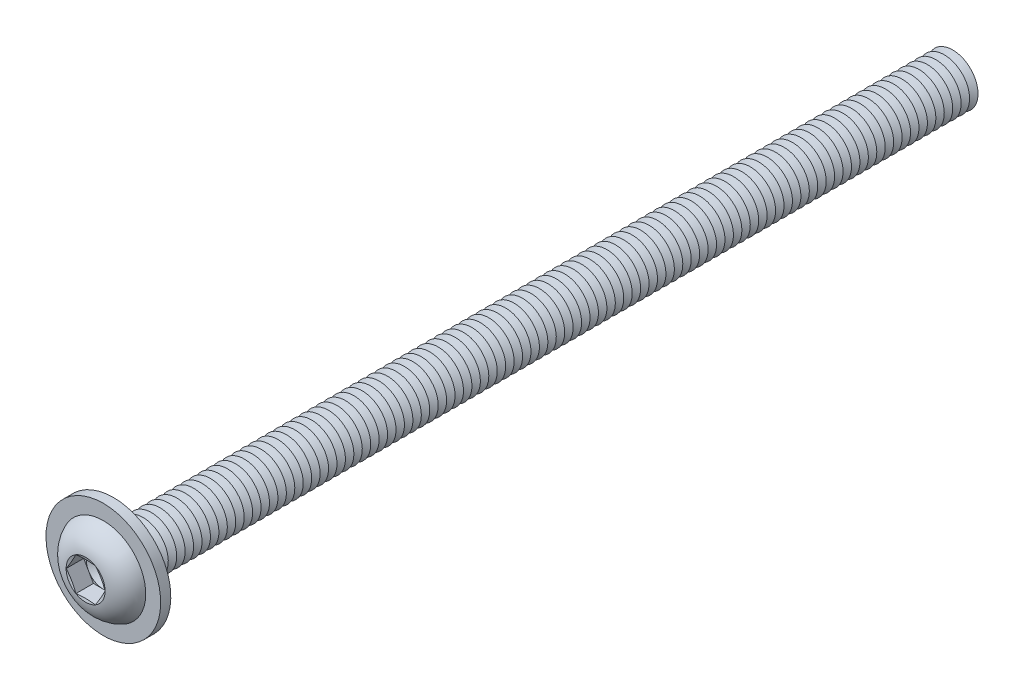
ISO-10303-21;
HEADER;
FILE_DESCRIPTION(('STEP AP214'),'2;1');
FILE_NAME('part.step','',(''),(''),'','','');
FILE_SCHEMA(('AUTOMOTIVE_DESIGN { 1 0 10303 214 1 1 1 1 }'));
ENDSEC;
DATA;
#1=APPLICATION_CONTEXT('core data for automotive mechanical design processes');
#2=APPLICATION_PROTOCOL_DEFINITION('international standard','automotive_design',2000,#1);
#3=PRODUCT_CONTEXT('',#1,'mechanical');
#4=PRODUCT('Part','Part','',(#3));
#5=PRODUCT_RELATED_PRODUCT_CATEGORY('part','',(#4));
#6=PRODUCT_DEFINITION_FORMATION('','',#4);
#7=PRODUCT_DEFINITION_CONTEXT('part definition',#1,'design');
#8=PRODUCT_DEFINITION('design','',#6,#7);
#9=PRODUCT_DEFINITION_SHAPE('','',#8);
#10=(LENGTH_UNIT() NAMED_UNIT(*) SI_UNIT(.MILLI.,.METRE.));
#11=(NAMED_UNIT(*) PLANE_ANGLE_UNIT() SI_UNIT($,.RADIAN.));
#12=(NAMED_UNIT(*) SI_UNIT($,.STERADIAN.) SOLID_ANGLE_UNIT());
#13=UNCERTAINTY_MEASURE_WITH_UNIT(LENGTH_MEASURE(1.E-05),#10,'distance_accuracy_value','');
#14=(GEOMETRIC_REPRESENTATION_CONTEXT(3) GLOBAL_UNCERTAINTY_ASSIGNED_CONTEXT((#13)) GLOBAL_UNIT_ASSIGNED_CONTEXT((#10,
#11,#12)) REPRESENTATION_CONTEXT('',''));
#15=CARTESIAN_POINT('',(0.,0.,0.));
#16=DIRECTION('',(0.,0.,1.));
#17=DIRECTION('',(1.,0.,0.));
#18=AXIS2_PLACEMENT_3D('',#15,#16,#17);
#19=CARTESIAN_POINT('',(0.,0.,-96.5));
#20=DIRECTION('',(0.,0.,1.));
#21=DIRECTION('',(0.,-1.,0.));
#22=AXIS2_PLACEMENT_3D('',#19,#20,#21);
#23=CONICAL_SURFACE('',#22,2.99999999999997,1.0471975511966);
#24=CARTESIAN_POINT('',(0.,0.,-97.));
#25=DIRECTION('',(0.,0.,1.));
#26=DIRECTION('',(0.,-1.,0.));
#27=AXIS2_PLACEMENT_3D('',#24,#25,#26);
#28=CIRCLE('',#27,2.13397459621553);
#29=CARTESIAN_POINT('',(0.,-2.13397459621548,-97.));
#30=VERTEX_POINT('',#29);
#31=EDGE_CURVE('E1008',#30,#30,#28,.T.);
#32=ORIENTED_EDGE('',*,*,#31,.T.);
#33=EDGE_LOOP('',(#32));
#34=FACE_BOUND('',#33,.T.);
#35=CARTESIAN_POINT('',(0.,0.,-96.5));
#36=DIRECTION('',(0.,0.,1.));
#37=DIRECTION('',(0.,-1.,0.));
#38=AXIS2_PLACEMENT_3D('',#35,#36,#37);
#39=CIRCLE('',#38,2.99999999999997);
#40=CARTESIAN_POINT('',(0.,-2.99999999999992,-96.5));
#41=VERTEX_POINT('',#40);
#42=EDGE_CURVE('E1004',#41,#41,#39,.T.);
#43=ORIENTED_EDGE('',*,*,#42,.F.);
#44=EDGE_LOOP('',(#43));
#45=FACE_BOUND('',#44,.T.);
#46=ADVANCED_FACE('F39',(#34,#45),#23,.T.);
#47=CARTESIAN_POINT('',(0.,0.,-97.));
#48=DIRECTION('',(0.,0.,-1.));
#49=DIRECTION('',(0.,1.,0.));
#50=AXIS2_PLACEMENT_3D('',#47,#48,#49);
#51=CONICAL_SURFACE('',#50,2.13397459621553,1.0471975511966);
#52=CARTESIAN_POINT('',(0.,0.,-97.5));
#53=DIRECTION('',(0.,0.,1.));
#54=DIRECTION('',(0.,-1.,0.));
#55=AXIS2_PLACEMENT_3D('',#52,#53,#54);
#56=CIRCLE('',#55,2.99999999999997);
#57=CARTESIAN_POINT('',(0.,-2.99999999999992,-97.5));
#58=VERTEX_POINT('',#57);
#59=EDGE_CURVE('E1012',#58,#58,#56,.T.);
#60=ORIENTED_EDGE('',*,*,#59,.T.);
#61=EDGE_LOOP('',(#60));
#62=FACE_BOUND('',#61,.T.);
#63=ORIENTED_EDGE('',*,*,#31,.F.);
#64=EDGE_LOOP('',(#63));
#65=FACE_BOUND('',#64,.T.);
#66=ADVANCED_FACE('F1129',(#62,#65),#51,.T.);
#67=CARTESIAN_POINT('',(0.,2.99999999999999,-100.));
#68=DIRECTION('',(0.,0.,-1.));
#69=DIRECTION('',(0.,1.,0.));
#70=AXIS2_PLACEMENT_3D('',#67,#68,#69);
#71=PLANE('',#70);
#72=CARTESIAN_POINT('',(0.,0.,-100.));
#73=DIRECTION('',(0.,0.,1.));
#74=DIRECTION('',(0.,-1.,0.));
#75=AXIS2_PLACEMENT_3D('',#72,#73,#74);
#76=CIRCLE('',#75,2.13397459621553);
#77=CARTESIAN_POINT('',(0.,-2.13397459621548,-100.));
#78=VERTEX_POINT('',#77);
#79=EDGE_CURVE('E1032',#78,#78,#76,.T.);
#80=ORIENTED_EDGE('',*,*,#79,.F.);
#81=EDGE_LOOP('',(#80));
#82=FACE_BOUND('',#81,.T.);
#83=ADVANCED_FACE('F1135',(#82),#71,.T.);
#84=CARTESIAN_POINT('',(0.,0.,-99.5));
#85=DIRECTION('',(0.,0.,1.));
#86=DIRECTION('',(0.,-1.,0.));
#87=AXIS2_PLACEMENT_3D('',#84,#85,#86);
#88=CONICAL_SURFACE('',#87,2.99999999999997,1.0471975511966);
#89=ORIENTED_EDGE('',*,*,#79,.T.);
#90=EDGE_LOOP('',(#89));
#91=FACE_BOUND('',#90,.T.);
#92=CARTESIAN_POINT('',(0.,0.,-99.5));
#93=DIRECTION('',(0.,0.,1.));
#94=DIRECTION('',(0.,-1.,0.));
#95=AXIS2_PLACEMENT_3D('',#92,#93,#94);
#96=CIRCLE('',#95,2.99999999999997);
#97=CARTESIAN_POINT('',(0.,-2.99999999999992,-99.5));
#98=VERTEX_POINT('',#97);
#99=EDGE_CURVE('E1028',#98,#98,#96,.T.);
#100=ORIENTED_EDGE('',*,*,#99,.F.);
#101=EDGE_LOOP('',(#100));
#102=FACE_BOUND('',#101,.T.);
#103=ADVANCED_FACE('F1154',(#91,#102),#88,.T.);
#104=CARTESIAN_POINT('',(0.,0.,-99.));
#105=DIRECTION('',(0.,0.,-1.));
#106=DIRECTION('',(0.,1.,0.));
#107=AXIS2_PLACEMENT_3D('',#104,#105,#106);
#108=CONICAL_SURFACE('',#107,2.13397459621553,1.0471975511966);
#109=ORIENTED_EDGE('',*,*,#99,.T.);
#110=EDGE_LOOP('',(#109));
#111=FACE_BOUND('',#110,.T.);
#112=CARTESIAN_POINT('',(0.,0.,-99.));
#113=DIRECTION('',(0.,0.,1.));
#114=DIRECTION('',(0.,-1.,0.));
#115=AXIS2_PLACEMENT_3D('',#112,#113,#114);
#116=CIRCLE('',#115,2.13397459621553);
#117=CARTESIAN_POINT('',(0.,-2.13397459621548,-99.));
#118=VERTEX_POINT('',#117);
#119=EDGE_CURVE('E1024',#118,#118,#116,.T.);
#120=ORIENTED_EDGE('',*,*,#119,.F.);
#121=EDGE_LOOP('',(#120));
#122=FACE_BOUND('',#121,.T.);
#123=ADVANCED_FACE('F1151',(#111,#122),#108,.T.);
#124=CARTESIAN_POINT('',(0.,0.,-98.5));
#125=DIRECTION('',(0.,0.,1.));
#126=DIRECTION('',(0.,-1.,0.));
#127=AXIS2_PLACEMENT_3D('',#124,#125,#126);
#128=CONICAL_SURFACE('',#127,2.99999999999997,1.0471975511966);
#129=ORIENTED_EDGE('',*,*,#119,.T.);
#130=EDGE_LOOP('',(#129));
#131=FACE_BOUND('',#130,.T.);
#132=CARTESIAN_POINT('',(0.,0.,-98.5));
#133=DIRECTION('',(0.,0.,1.));
#134=DIRECTION('',(0.,-1.,0.));
#135=AXIS2_PLACEMENT_3D('',#132,#133,#134);
#136=CIRCLE('',#135,2.99999999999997);
#137=CARTESIAN_POINT('',(0.,-2.99999999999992,-98.5));
#138=VERTEX_POINT('',#137);
#139=EDGE_CURVE('E1020',#138,#138,#136,.T.);
#140=ORIENTED_EDGE('',*,*,#139,.F.);
#141=EDGE_LOOP('',(#140));
#142=FACE_BOUND('',#141,.T.);
#143=ADVANCED_FACE('F1145',(#131,#142),#128,.T.);
#144=CARTESIAN_POINT('',(0.,0.,-98.));
#145=DIRECTION('',(0.,0.,-1.));
#146=DIRECTION('',(0.,1.,0.));
#147=AXIS2_PLACEMENT_3D('',#144,#145,#146);
#148=CONICAL_SURFACE('',#147,2.13397459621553,1.0471975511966);
#149=ORIENTED_EDGE('',*,*,#139,.T.);
#150=EDGE_LOOP('',(#149));
#151=FACE_BOUND('',#150,.T.);
#152=CARTESIAN_POINT('',(0.,0.,-98.));
#153=DIRECTION('',(0.,0.,1.));
#154=DIRECTION('',(0.,-1.,0.));
#155=AXIS2_PLACEMENT_3D('',#152,#153,#154);
#156=CIRCLE('',#155,2.13397459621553);
#157=CARTESIAN_POINT('',(0.,-2.13397459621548,-98.));
#158=VERTEX_POINT('',#157);
#159=EDGE_CURVE('E1016',#158,#158,#156,.T.);
#160=ORIENTED_EDGE('',*,*,#159,.F.);
#161=EDGE_LOOP('',(#160));
#162=FACE_BOUND('',#161,.T.);
#163=ADVANCED_FACE('F1141',(#151,#162),#148,.T.);
#164=CARTESIAN_POINT('',(0.,0.,-97.5));
#165=DIRECTION('',(0.,0.,1.));
#166=DIRECTION('',(0.,-1.,0.));
#167=AXIS2_PLACEMENT_3D('',#164,#165,#166);
#168=CONICAL_SURFACE('',#167,2.99999999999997,1.0471975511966);
#169=ORIENTED_EDGE('',*,*,#159,.T.);
#170=EDGE_LOOP('',(#169));
#171=FACE_BOUND('',#170,.T.);
#172=ORIENTED_EDGE('',*,*,#59,.F.);
#173=EDGE_LOOP('',(#172));
#174=FACE_BOUND('',#173,.T.);
#175=ADVANCED_FACE('F1144',(#171,#174),#168,.T.);
#176=CARTESIAN_POINT('',(0.,0.,-95.5));
#177=DIRECTION('',(0.,0.,1.));
#178=DIRECTION('',(0.,-1.,0.));
#179=AXIS2_PLACEMENT_3D('',#176,#177,#178);
#180=CONICAL_SURFACE('',#179,2.99999999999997,1.0471975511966);
#181=CARTESIAN_POINT('',(0.,0.,-96.));
#182=DIRECTION('',(0.,0.,1.));
#183=DIRECTION('',(0.,-1.,0.));
#184=AXIS2_PLACEMENT_3D('',#181,#182,#183);
#185=CIRCLE('',#184,2.13397459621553);
#186=CARTESIAN_POINT('',(0.,-2.13397459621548,-96.));
#187=VERTEX_POINT('',#186);
#188=EDGE_CURVE('E1000',#187,#187,#185,.T.);
#189=ORIENTED_EDGE('',*,*,#188,.T.);
#190=EDGE_LOOP('',(#189));
#191=FACE_BOUND('',#190,.T.);
#192=CARTESIAN_POINT('',(0.,0.,-95.5));
#193=DIRECTION('',(0.,0.,1.));
#194=DIRECTION('',(0.,-1.,0.));
#195=AXIS2_PLACEMENT_3D('',#192,#193,#194);
#196=CIRCLE('',#195,2.99999999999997);
#197=CARTESIAN_POINT('',(0.,-2.99999999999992,-95.5));
#198=VERTEX_POINT('',#197);
#199=EDGE_CURVE('E996',#198,#198,#196,.T.);
#200=ORIENTED_EDGE('',*,*,#199,.F.);
#201=EDGE_LOOP('',(#200));
#202=FACE_BOUND('',#201,.T.);
#203=ADVANCED_FACE('F1149',(#191,#202),#180,.T.);
#204=CARTESIAN_POINT('',(0.,0.,-96.));
#205=DIRECTION('',(0.,0.,-1.));
#206=DIRECTION('',(0.,1.,0.));
#207=AXIS2_PLACEMENT_3D('',#204,#205,#206);
#208=CONICAL_SURFACE('',#207,2.13397459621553,1.0471975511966);
#209=ORIENTED_EDGE('',*,*,#42,.T.);
#210=EDGE_LOOP('',(#209));
#211=FACE_BOUND('',#210,.T.);
#212=ORIENTED_EDGE('',*,*,#188,.F.);
#213=EDGE_LOOP('',(#212));
#214=FACE_BOUND('',#213,.T.);
#215=ADVANCED_FACE('F1200',(#211,#214),#208,.T.);
#216=CARTESIAN_POINT('',(0.,0.,-94.5));
#217=DIRECTION('',(0.,0.,1.));
#218=DIRECTION('',(0.,-1.,0.));
#219=AXIS2_PLACEMENT_3D('',#216,#217,#218);
#220=CONICAL_SURFACE('',#219,2.99999999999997,1.0471975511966);
#221=CARTESIAN_POINT('',(0.,0.,-95.));
#222=DIRECTION('',(0.,0.,1.));
#223=DIRECTION('',(0.,-1.,0.));
#224=AXIS2_PLACEMENT_3D('',#221,#222,#223);
#225=CIRCLE('',#224,2.13397459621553);
#226=CARTESIAN_POINT('',(0.,-2.13397459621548,-95.));
#227=VERTEX_POINT('',#226);
#228=EDGE_CURVE('E992',#227,#227,#225,.T.);
#229=ORIENTED_EDGE('',*,*,#228,.T.);
#230=EDGE_LOOP('',(#229));
#231=FACE_BOUND('',#230,.T.);
#232=CARTESIAN_POINT('',(0.,0.,-94.5));
#233=DIRECTION('',(0.,0.,1.));
#234=DIRECTION('',(0.,-1.,0.));
#235=AXIS2_PLACEMENT_3D('',#232,#233,#234);
#236=CIRCLE('',#235,2.99999999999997);
#237=CARTESIAN_POINT('',(0.,-2.99999999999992,-94.5));
#238=VERTEX_POINT('',#237);
#239=EDGE_CURVE('E988',#238,#238,#236,.T.);
#240=ORIENTED_EDGE('',*,*,#239,.F.);
#241=EDGE_LOOP('',(#240));
#242=FACE_BOUND('',#241,.T.);
#243=ADVANCED_FACE('F1206',(#231,#242),#220,.T.);
#244=CARTESIAN_POINT('',(0.,0.,-95.));
#245=DIRECTION('',(0.,0.,-1.));
#246=DIRECTION('',(0.,1.,0.));
#247=AXIS2_PLACEMENT_3D('',#244,#245,#246);
#248=CONICAL_SURFACE('',#247,2.13397459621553,1.0471975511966);
#249=ORIENTED_EDGE('',*,*,#199,.T.);
#250=EDGE_LOOP('',(#249));
#251=FACE_BOUND('',#250,.T.);
#252=ORIENTED_EDGE('',*,*,#228,.F.);
#253=EDGE_LOOP('',(#252));
#254=FACE_BOUND('',#253,.T.);
#255=ADVANCED_FACE('F1213',(#251,#254),#248,.T.);
#256=CARTESIAN_POINT('',(0.,0.,-93.5));
#257=DIRECTION('',(0.,0.,1.));
#258=DIRECTION('',(0.,-1.,0.));
#259=AXIS2_PLACEMENT_3D('',#256,#257,#258);
#260=CONICAL_SURFACE('',#259,2.99999999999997,1.0471975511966);
#261=CARTESIAN_POINT('',(0.,0.,-94.));
#262=DIRECTION('',(0.,0.,1.));
#263=DIRECTION('',(0.,-1.,0.));
#264=AXIS2_PLACEMENT_3D('',#261,#262,#263);
#265=CIRCLE('',#264,2.13397459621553);
#266=CARTESIAN_POINT('',(0.,-2.13397459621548,-94.));
#267=VERTEX_POINT('',#266);
#268=EDGE_CURVE('E984',#267,#267,#265,.T.);
#269=ORIENTED_EDGE('',*,*,#268,.T.);
#270=EDGE_LOOP('',(#269));
#271=FACE_BOUND('',#270,.T.);
#272=CARTESIAN_POINT('',(0.,0.,-93.5));
#273=DIRECTION('',(0.,0.,1.));
#274=DIRECTION('',(0.,-1.,0.));
#275=AXIS2_PLACEMENT_3D('',#272,#273,#274);
#276=CIRCLE('',#275,2.99999999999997);
#277=CARTESIAN_POINT('',(0.,-2.99999999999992,-93.5));
#278=VERTEX_POINT('',#277);
#279=EDGE_CURVE('E980',#278,#278,#276,.T.);
#280=ORIENTED_EDGE('',*,*,#279,.F.);
#281=EDGE_LOOP('',(#280));
#282=FACE_BOUND('',#281,.T.);
#283=ADVANCED_FACE('F1220',(#271,#282),#260,.T.);
#284=CARTESIAN_POINT('',(0.,0.,-94.));
#285=DIRECTION('',(0.,0.,-1.));
#286=DIRECTION('',(0.,1.,0.));
#287=AXIS2_PLACEMENT_3D('',#284,#285,#286);
#288=CONICAL_SURFACE('',#287,2.13397459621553,1.0471975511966);
#289=ORIENTED_EDGE('',*,*,#239,.T.);
#290=EDGE_LOOP('',(#289));
#291=FACE_BOUND('',#290,.T.);
#292=ORIENTED_EDGE('',*,*,#268,.F.);
#293=EDGE_LOOP('',(#292));
#294=FACE_BOUND('',#293,.T.);
#295=ADVANCED_FACE('F1227',(#291,#294),#288,.T.);
#296=CARTESIAN_POINT('',(0.,0.,-92.5));
#297=DIRECTION('',(0.,0.,1.));
#298=DIRECTION('',(0.,-1.,0.));
#299=AXIS2_PLACEMENT_3D('',#296,#297,#298);
#300=CONICAL_SURFACE('',#299,2.99999999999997,1.0471975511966);
#301=CARTESIAN_POINT('',(0.,0.,-93.));
#302=DIRECTION('',(0.,0.,1.));
#303=DIRECTION('',(0.,-1.,0.));
#304=AXIS2_PLACEMENT_3D('',#301,#302,#303);
#305=CIRCLE('',#304,2.13397459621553);
#306=CARTESIAN_POINT('',(0.,-2.13397459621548,-93.));
#307=VERTEX_POINT('',#306);
#308=EDGE_CURVE('E976',#307,#307,#305,.T.);
#309=ORIENTED_EDGE('',*,*,#308,.T.);
#310=EDGE_LOOP('',(#309));
#311=FACE_BOUND('',#310,.T.);
#312=CARTESIAN_POINT('',(0.,0.,-92.5));
#313=DIRECTION('',(0.,0.,1.));
#314=DIRECTION('',(0.,-1.,0.));
#315=AXIS2_PLACEMENT_3D('',#312,#313,#314);
#316=CIRCLE('',#315,2.99999999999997);
#317=CARTESIAN_POINT('',(0.,-2.99999999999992,-92.5));
#318=VERTEX_POINT('',#317);
#319=EDGE_CURVE('E972',#318,#318,#316,.T.);
#320=ORIENTED_EDGE('',*,*,#319,.F.);
#321=EDGE_LOOP('',(#320));
#322=FACE_BOUND('',#321,.T.);
#323=ADVANCED_FACE('F1234',(#311,#322),#300,.T.);
#324=CARTESIAN_POINT('',(0.,0.,-93.));
#325=DIRECTION('',(0.,0.,-1.));
#326=DIRECTION('',(0.,1.,0.));
#327=AXIS2_PLACEMENT_3D('',#324,#325,#326);
#328=CONICAL_SURFACE('',#327,2.13397459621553,1.0471975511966);
#329=ORIENTED_EDGE('',*,*,#279,.T.);
#330=EDGE_LOOP('',(#329));
#331=FACE_BOUND('',#330,.T.);
#332=ORIENTED_EDGE('',*,*,#308,.F.);
#333=EDGE_LOOP('',(#332));
#334=FACE_BOUND('',#333,.T.);
#335=ADVANCED_FACE('F1241',(#331,#334),#328,.T.);
#336=CARTESIAN_POINT('',(0.,0.,-91.5));
#337=DIRECTION('',(0.,0.,1.));
#338=DIRECTION('',(0.,-1.,0.));
#339=AXIS2_PLACEMENT_3D('',#336,#337,#338);
#340=CONICAL_SURFACE('',#339,2.99999999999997,1.0471975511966);
#341=CARTESIAN_POINT('',(0.,0.,-92.));
#342=DIRECTION('',(0.,0.,1.));
#343=DIRECTION('',(0.,-1.,0.));
#344=AXIS2_PLACEMENT_3D('',#341,#342,#343);
#345=CIRCLE('',#344,2.13397459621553);
#346=CARTESIAN_POINT('',(0.,-2.13397459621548,-92.));
#347=VERTEX_POINT('',#346);
#348=EDGE_CURVE('E968',#347,#347,#345,.T.);
#349=ORIENTED_EDGE('',*,*,#348,.T.);
#350=EDGE_LOOP('',(#349));
#351=FACE_BOUND('',#350,.T.);
#352=CARTESIAN_POINT('',(0.,0.,-91.5));
#353=DIRECTION('',(0.,0.,1.));
#354=DIRECTION('',(0.,-1.,0.));
#355=AXIS2_PLACEMENT_3D('',#352,#353,#354);
#356=CIRCLE('',#355,2.99999999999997);
#357=CARTESIAN_POINT('',(0.,-2.99999999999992,-91.5));
#358=VERTEX_POINT('',#357);
#359=EDGE_CURVE('E964',#358,#358,#356,.T.);
#360=ORIENTED_EDGE('',*,*,#359,.F.);
#361=EDGE_LOOP('',(#360));
#362=FACE_BOUND('',#361,.T.);
#363=ADVANCED_FACE('F1248',(#351,#362),#340,.T.);
#364=CARTESIAN_POINT('',(0.,0.,-92.));
#365=DIRECTION('',(0.,0.,-1.));
#366=DIRECTION('',(0.,1.,0.));
#367=AXIS2_PLACEMENT_3D('',#364,#365,#366);
#368=CONICAL_SURFACE('',#367,2.13397459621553,1.0471975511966);
#369=ORIENTED_EDGE('',*,*,#319,.T.);
#370=EDGE_LOOP('',(#369));
#371=FACE_BOUND('',#370,.T.);
#372=ORIENTED_EDGE('',*,*,#348,.F.);
#373=EDGE_LOOP('',(#372));
#374=FACE_BOUND('',#373,.T.);
#375=ADVANCED_FACE('F1255',(#371,#374),#368,.T.);
#376=CARTESIAN_POINT('',(0.,0.,-90.5));
#377=DIRECTION('',(0.,0.,1.));
#378=DIRECTION('',(0.,-1.,0.));
#379=AXIS2_PLACEMENT_3D('',#376,#377,#378);
#380=CONICAL_SURFACE('',#379,2.99999999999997,1.0471975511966);
#381=CARTESIAN_POINT('',(0.,0.,-91.));
#382=DIRECTION('',(0.,0.,1.));
#383=DIRECTION('',(0.,-1.,0.));
#384=AXIS2_PLACEMENT_3D('',#381,#382,#383);
#385=CIRCLE('',#384,2.13397459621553);
#386=CARTESIAN_POINT('',(0.,-2.13397459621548,-91.));
#387=VERTEX_POINT('',#386);
#388=EDGE_CURVE('E960',#387,#387,#385,.T.);
#389=ORIENTED_EDGE('',*,*,#388,.T.);
#390=EDGE_LOOP('',(#389));
#391=FACE_BOUND('',#390,.T.);
#392=CARTESIAN_POINT('',(0.,0.,-90.5));
#393=DIRECTION('',(0.,0.,1.));
#394=DIRECTION('',(0.,-1.,0.));
#395=AXIS2_PLACEMENT_3D('',#392,#393,#394);
#396=CIRCLE('',#395,2.99999999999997);
#397=CARTESIAN_POINT('',(0.,-2.99999999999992,-90.5));
#398=VERTEX_POINT('',#397);
#399=EDGE_CURVE('E956',#398,#398,#396,.T.);
#400=ORIENTED_EDGE('',*,*,#399,.F.);
#401=EDGE_LOOP('',(#400));
#402=FACE_BOUND('',#401,.T.);
#403=ADVANCED_FACE('F1262',(#391,#402),#380,.T.);
#404=CARTESIAN_POINT('',(0.,0.,-91.));
#405=DIRECTION('',(0.,0.,-1.));
#406=DIRECTION('',(0.,1.,0.));
#407=AXIS2_PLACEMENT_3D('',#404,#405,#406);
#408=CONICAL_SURFACE('',#407,2.13397459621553,1.0471975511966);
#409=ORIENTED_EDGE('',*,*,#359,.T.);
#410=EDGE_LOOP('',(#409));
#411=FACE_BOUND('',#410,.T.);
#412=ORIENTED_EDGE('',*,*,#388,.F.);
#413=EDGE_LOOP('',(#412));
#414=FACE_BOUND('',#413,.T.);
#415=ADVANCED_FACE('F1269',(#411,#414),#408,.T.);
#416=CARTESIAN_POINT('',(0.,0.,-89.5));
#417=DIRECTION('',(0.,0.,1.));
#418=DIRECTION('',(0.,-1.,0.));
#419=AXIS2_PLACEMENT_3D('',#416,#417,#418);
#420=CONICAL_SURFACE('',#419,2.99999999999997,1.0471975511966);
#421=CARTESIAN_POINT('',(0.,0.,-90.));
#422=DIRECTION('',(0.,0.,1.));
#423=DIRECTION('',(0.,-1.,0.));
#424=AXIS2_PLACEMENT_3D('',#421,#422,#423);
#425=CIRCLE('',#424,2.13397459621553);
#426=CARTESIAN_POINT('',(0.,-2.13397459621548,-90.));
#427=VERTEX_POINT('',#426);
#428=EDGE_CURVE('E952',#427,#427,#425,.T.);
#429=ORIENTED_EDGE('',*,*,#428,.T.);
#430=EDGE_LOOP('',(#429));
#431=FACE_BOUND('',#430,.T.);
#432=CARTESIAN_POINT('',(0.,0.,-89.5));
#433=DIRECTION('',(0.,0.,1.));
#434=DIRECTION('',(0.,-1.,0.));
#435=AXIS2_PLACEMENT_3D('',#432,#433,#434);
#436=CIRCLE('',#435,2.99999999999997);
#437=CARTESIAN_POINT('',(0.,-2.99999999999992,-89.5));
#438=VERTEX_POINT('',#437);
#439=EDGE_CURVE('E948',#438,#438,#436,.T.);
#440=ORIENTED_EDGE('',*,*,#439,.F.);
#441=EDGE_LOOP('',(#440));
#442=FACE_BOUND('',#441,.T.);
#443=ADVANCED_FACE('F1276',(#431,#442),#420,.T.);
#444=CARTESIAN_POINT('',(0.,0.,-90.));
#445=DIRECTION('',(0.,0.,-1.));
#446=DIRECTION('',(0.,1.,0.));
#447=AXIS2_PLACEMENT_3D('',#444,#445,#446);
#448=CONICAL_SURFACE('',#447,2.13397459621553,1.0471975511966);
#449=ORIENTED_EDGE('',*,*,#399,.T.);
#450=EDGE_LOOP('',(#449));
#451=FACE_BOUND('',#450,.T.);
#452=ORIENTED_EDGE('',*,*,#428,.F.);
#453=EDGE_LOOP('',(#452));
#454=FACE_BOUND('',#453,.T.);
#455=ADVANCED_FACE('F1283',(#451,#454),#448,.T.);
#456=CARTESIAN_POINT('',(0.,0.,-88.5));
#457=DIRECTION('',(0.,0.,1.));
#458=DIRECTION('',(0.,-1.,0.));
#459=AXIS2_PLACEMENT_3D('',#456,#457,#458);
#460=CONICAL_SURFACE('',#459,2.99999999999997,1.0471975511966);
#461=CARTESIAN_POINT('',(0.,0.,-89.));
#462=DIRECTION('',(0.,0.,1.));
#463=DIRECTION('',(0.,-1.,0.));
#464=AXIS2_PLACEMENT_3D('',#461,#462,#463);
#465=CIRCLE('',#464,2.13397459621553);
#466=CARTESIAN_POINT('',(0.,-2.13397459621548,-89.));
#467=VERTEX_POINT('',#466);
#468=EDGE_CURVE('E944',#467,#467,#465,.T.);
#469=ORIENTED_EDGE('',*,*,#468,.T.);
#470=EDGE_LOOP('',(#469));
#471=FACE_BOUND('',#470,.T.);
#472=CARTESIAN_POINT('',(0.,0.,-88.5));
#473=DIRECTION('',(0.,0.,1.));
#474=DIRECTION('',(0.,-1.,0.));
#475=AXIS2_PLACEMENT_3D('',#472,#473,#474);
#476=CIRCLE('',#475,2.99999999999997);
#477=CARTESIAN_POINT('',(0.,-2.99999999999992,-88.5));
#478=VERTEX_POINT('',#477);
#479=EDGE_CURVE('E940',#478,#478,#476,.T.);
#480=ORIENTED_EDGE('',*,*,#479,.F.);
#481=EDGE_LOOP('',(#480));
#482=FACE_BOUND('',#481,.T.);
#483=ADVANCED_FACE('F1290',(#471,#482),#460,.T.);
#484=CARTESIAN_POINT('',(0.,0.,-89.));
#485=DIRECTION('',(0.,0.,-1.));
#486=DIRECTION('',(0.,1.,0.));
#487=AXIS2_PLACEMENT_3D('',#484,#485,#486);
#488=CONICAL_SURFACE('',#487,2.13397459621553,1.0471975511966);
#489=ORIENTED_EDGE('',*,*,#439,.T.);
#490=EDGE_LOOP('',(#489));
#491=FACE_BOUND('',#490,.T.);
#492=ORIENTED_EDGE('',*,*,#468,.F.);
#493=EDGE_LOOP('',(#492));
#494=FACE_BOUND('',#493,.T.);
#495=ADVANCED_FACE('F1297',(#491,#494),#488,.T.);
#496=CARTESIAN_POINT('',(0.,0.,-87.5));
#497=DIRECTION('',(0.,0.,1.));
#498=DIRECTION('',(0.,-1.,0.));
#499=AXIS2_PLACEMENT_3D('',#496,#497,#498);
#500=CONICAL_SURFACE('',#499,2.99999999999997,1.0471975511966);
#501=CARTESIAN_POINT('',(0.,0.,-88.));
#502=DIRECTION('',(0.,0.,1.));
#503=DIRECTION('',(0.,-1.,0.));
#504=AXIS2_PLACEMENT_3D('',#501,#502,#503);
#505=CIRCLE('',#504,2.13397459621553);
#506=CARTESIAN_POINT('',(0.,-2.13397459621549,-88.));
#507=VERTEX_POINT('',#506);
#508=EDGE_CURVE('E936',#507,#507,#505,.T.);
#509=ORIENTED_EDGE('',*,*,#508,.T.);
#510=EDGE_LOOP('',(#509));
#511=FACE_BOUND('',#510,.T.);
#512=CARTESIAN_POINT('',(0.,0.,-87.5));
#513=DIRECTION('',(0.,0.,1.));
#514=DIRECTION('',(0.,-1.,0.));
#515=AXIS2_PLACEMENT_3D('',#512,#513,#514);
#516=CIRCLE('',#515,2.99999999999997);
#517=CARTESIAN_POINT('',(0.,-2.99999999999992,-87.5));
#518=VERTEX_POINT('',#517);
#519=EDGE_CURVE('E932',#518,#518,#516,.T.);
#520=ORIENTED_EDGE('',*,*,#519,.F.);
#521=EDGE_LOOP('',(#520));
#522=FACE_BOUND('',#521,.T.);
#523=ADVANCED_FACE('F1304',(#511,#522),#500,.T.);
#524=CARTESIAN_POINT('',(0.,0.,-88.));
#525=DIRECTION('',(0.,0.,-1.));
#526=DIRECTION('',(0.,1.,0.));
#527=AXIS2_PLACEMENT_3D('',#524,#525,#526);
#528=CONICAL_SURFACE('',#527,2.13397459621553,1.0471975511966);
#529=ORIENTED_EDGE('',*,*,#479,.T.);
#530=EDGE_LOOP('',(#529));
#531=FACE_BOUND('',#530,.T.);
#532=ORIENTED_EDGE('',*,*,#508,.F.);
#533=EDGE_LOOP('',(#532));
#534=FACE_BOUND('',#533,.T.);
#535=ADVANCED_FACE('F1311',(#531,#534),#528,.T.);
#536=CARTESIAN_POINT('',(0.,0.,-86.5));
#537=DIRECTION('',(0.,0.,1.));
#538=DIRECTION('',(0.,-1.,0.));
#539=AXIS2_PLACEMENT_3D('',#536,#537,#538);
#540=CONICAL_SURFACE('',#539,2.99999999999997,1.0471975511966);
#541=CARTESIAN_POINT('',(0.,0.,-87.));
#542=DIRECTION('',(0.,0.,1.));
#543=DIRECTION('',(0.,-1.,0.));
#544=AXIS2_PLACEMENT_3D('',#541,#542,#543);
#545=CIRCLE('',#544,2.13397459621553);
#546=CARTESIAN_POINT('',(0.,-2.13397459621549,-87.));
#547=VERTEX_POINT('',#546);
#548=EDGE_CURVE('E928',#547,#547,#545,.T.);
#549=ORIENTED_EDGE('',*,*,#548,.T.);
#550=EDGE_LOOP('',(#549));
#551=FACE_BOUND('',#550,.T.);
#552=CARTESIAN_POINT('',(0.,0.,-86.5));
#553=DIRECTION('',(0.,0.,1.));
#554=DIRECTION('',(0.,-1.,0.));
#555=AXIS2_PLACEMENT_3D('',#552,#553,#554);
#556=CIRCLE('',#555,2.99999999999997);
#557=CARTESIAN_POINT('',(0.,-2.99999999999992,-86.5));
#558=VERTEX_POINT('',#557);
#559=EDGE_CURVE('E924',#558,#558,#556,.T.);
#560=ORIENTED_EDGE('',*,*,#559,.F.);
#561=EDGE_LOOP('',(#560));
#562=FACE_BOUND('',#561,.T.);
#563=ADVANCED_FACE('F1318',(#551,#562),#540,.T.);
#564=CARTESIAN_POINT('',(0.,0.,-87.));
#565=DIRECTION('',(0.,0.,-1.));
#566=DIRECTION('',(0.,1.,0.));
#567=AXIS2_PLACEMENT_3D('',#564,#565,#566);
#568=CONICAL_SURFACE('',#567,2.13397459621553,1.0471975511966);
#569=ORIENTED_EDGE('',*,*,#519,.T.);
#570=EDGE_LOOP('',(#569));
#571=FACE_BOUND('',#570,.T.);
#572=ORIENTED_EDGE('',*,*,#548,.F.);
#573=EDGE_LOOP('',(#572));
#574=FACE_BOUND('',#573,.T.);
#575=ADVANCED_FACE('F1325',(#571,#574),#568,.T.);
#576=CARTESIAN_POINT('',(0.,0.,-85.5));
#577=DIRECTION('',(0.,0.,1.));
#578=DIRECTION('',(0.,-1.,0.));
#579=AXIS2_PLACEMENT_3D('',#576,#577,#578);
#580=CONICAL_SURFACE('',#579,2.99999999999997,1.0471975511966);
#581=CARTESIAN_POINT('',(0.,0.,-86.));
#582=DIRECTION('',(0.,0.,1.));
#583=DIRECTION('',(0.,-1.,0.));
#584=AXIS2_PLACEMENT_3D('',#581,#582,#583);
#585=CIRCLE('',#584,2.13397459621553);
#586=CARTESIAN_POINT('',(0.,-2.13397459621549,-86.));
#587=VERTEX_POINT('',#586);
#588=EDGE_CURVE('E920',#587,#587,#585,.T.);
#589=ORIENTED_EDGE('',*,*,#588,.T.);
#590=EDGE_LOOP('',(#589));
#591=FACE_BOUND('',#590,.T.);
#592=CARTESIAN_POINT('',(0.,0.,-85.5));
#593=DIRECTION('',(0.,0.,1.));
#594=DIRECTION('',(0.,-1.,0.));
#595=AXIS2_PLACEMENT_3D('',#592,#593,#594);
#596=CIRCLE('',#595,2.99999999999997);
#597=CARTESIAN_POINT('',(0.,-2.99999999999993,-85.5));
#598=VERTEX_POINT('',#597);
#599=EDGE_CURVE('E916',#598,#598,#596,.T.);
#600=ORIENTED_EDGE('',*,*,#599,.F.);
#601=EDGE_LOOP('',(#600));
#602=FACE_BOUND('',#601,.T.);
#603=ADVANCED_FACE('F1332',(#591,#602),#580,.T.);
#604=CARTESIAN_POINT('',(0.,0.,-86.));
#605=DIRECTION('',(0.,0.,-1.));
#606=DIRECTION('',(0.,1.,0.));
#607=AXIS2_PLACEMENT_3D('',#604,#605,#606);
#608=CONICAL_SURFACE('',#607,2.13397459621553,1.0471975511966);
#609=ORIENTED_EDGE('',*,*,#559,.T.);
#610=EDGE_LOOP('',(#609));
#611=FACE_BOUND('',#610,.T.);
#612=ORIENTED_EDGE('',*,*,#588,.F.);
#613=EDGE_LOOP('',(#612));
#614=FACE_BOUND('',#613,.T.);
#615=ADVANCED_FACE('F1339',(#611,#614),#608,.T.);
#616=CARTESIAN_POINT('',(0.,0.,-84.5));
#617=DIRECTION('',(0.,0.,1.));
#618=DIRECTION('',(0.,-1.,0.));
#619=AXIS2_PLACEMENT_3D('',#616,#617,#618);
#620=CONICAL_SURFACE('',#619,2.99999999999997,1.0471975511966);
#621=CARTESIAN_POINT('',(0.,0.,-85.));
#622=DIRECTION('',(0.,0.,1.));
#623=DIRECTION('',(0.,-1.,0.));
#624=AXIS2_PLACEMENT_3D('',#621,#622,#623);
#625=CIRCLE('',#624,2.13397459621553);
#626=CARTESIAN_POINT('',(0.,-2.13397459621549,-85.));
#627=VERTEX_POINT('',#626);
#628=EDGE_CURVE('E912',#627,#627,#625,.T.);
#629=ORIENTED_EDGE('',*,*,#628,.T.);
#630=EDGE_LOOP('',(#629));
#631=FACE_BOUND('',#630,.T.);
#632=CARTESIAN_POINT('',(0.,0.,-84.5));
#633=DIRECTION('',(0.,0.,1.));
#634=DIRECTION('',(0.,-1.,0.));
#635=AXIS2_PLACEMENT_3D('',#632,#633,#634);
#636=CIRCLE('',#635,2.99999999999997);
#637=CARTESIAN_POINT('',(0.,-2.99999999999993,-84.5));
#638=VERTEX_POINT('',#637);
#639=EDGE_CURVE('E908',#638,#638,#636,.T.);
#640=ORIENTED_EDGE('',*,*,#639,.F.);
#641=EDGE_LOOP('',(#640));
#642=FACE_BOUND('',#641,.T.);
#643=ADVANCED_FACE('F1346',(#631,#642),#620,.T.);
#644=CARTESIAN_POINT('',(0.,0.,-85.));
#645=DIRECTION('',(0.,0.,-1.));
#646=DIRECTION('',(0.,1.,0.));
#647=AXIS2_PLACEMENT_3D('',#644,#645,#646);
#648=CONICAL_SURFACE('',#647,2.13397459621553,1.0471975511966);
#649=ORIENTED_EDGE('',*,*,#599,.T.);
#650=EDGE_LOOP('',(#649));
#651=FACE_BOUND('',#650,.T.);
#652=ORIENTED_EDGE('',*,*,#628,.F.);
#653=EDGE_LOOP('',(#652));
#654=FACE_BOUND('',#653,.T.);
#655=ADVANCED_FACE('F1353',(#651,#654),#648,.T.);
#656=CARTESIAN_POINT('',(0.,0.,-83.5));
#657=DIRECTION('',(0.,0.,1.));
#658=DIRECTION('',(0.,-1.,0.));
#659=AXIS2_PLACEMENT_3D('',#656,#657,#658);
#660=CONICAL_SURFACE('',#659,2.99999999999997,1.0471975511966);
#661=CARTESIAN_POINT('',(0.,0.,-84.));
#662=DIRECTION('',(0.,0.,1.));
#663=DIRECTION('',(0.,-1.,0.));
#664=AXIS2_PLACEMENT_3D('',#661,#662,#663);
#665=CIRCLE('',#664,2.13397459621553);
#666=CARTESIAN_POINT('',(0.,-2.13397459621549,-84.));
#667=VERTEX_POINT('',#666);
#668=EDGE_CURVE('E904',#667,#667,#665,.T.);
#669=ORIENTED_EDGE('',*,*,#668,.T.);
#670=EDGE_LOOP('',(#669));
#671=FACE_BOUND('',#670,.T.);
#672=CARTESIAN_POINT('',(0.,0.,-83.5));
#673=DIRECTION('',(0.,0.,1.));
#674=DIRECTION('',(0.,-1.,0.));
#675=AXIS2_PLACEMENT_3D('',#672,#673,#674);
#676=CIRCLE('',#675,2.99999999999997);
#677=CARTESIAN_POINT('',(0.,-2.99999999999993,-83.5));
#678=VERTEX_POINT('',#677);
#679=EDGE_CURVE('E900',#678,#678,#676,.T.);
#680=ORIENTED_EDGE('',*,*,#679,.F.);
#681=EDGE_LOOP('',(#680));
#682=FACE_BOUND('',#681,.T.);
#683=ADVANCED_FACE('F1360',(#671,#682),#660,.T.);
#684=CARTESIAN_POINT('',(0.,0.,-84.));
#685=DIRECTION('',(0.,0.,-1.));
#686=DIRECTION('',(0.,1.,0.));
#687=AXIS2_PLACEMENT_3D('',#684,#685,#686);
#688=CONICAL_SURFACE('',#687,2.13397459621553,1.0471975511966);
#689=ORIENTED_EDGE('',*,*,#639,.T.);
#690=EDGE_LOOP('',(#689));
#691=FACE_BOUND('',#690,.T.);
#692=ORIENTED_EDGE('',*,*,#668,.F.);
#693=EDGE_LOOP('',(#692));
#694=FACE_BOUND('',#693,.T.);
#695=ADVANCED_FACE('F1367',(#691,#694),#688,.T.);
#696=CARTESIAN_POINT('',(0.,0.,-82.5));
#697=DIRECTION('',(0.,0.,1.));
#698=DIRECTION('',(0.,-1.,0.));
#699=AXIS2_PLACEMENT_3D('',#696,#697,#698);
#700=CONICAL_SURFACE('',#699,2.99999999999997,1.0471975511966);
#701=CARTESIAN_POINT('',(0.,0.,-83.));
#702=DIRECTION('',(0.,0.,1.));
#703=DIRECTION('',(0.,-1.,0.));
#704=AXIS2_PLACEMENT_3D('',#701,#702,#703);
#705=CIRCLE('',#704,2.13397459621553);
#706=CARTESIAN_POINT('',(0.,-2.13397459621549,-83.));
#707=VERTEX_POINT('',#706);
#708=EDGE_CURVE('E896',#707,#707,#705,.T.);
#709=ORIENTED_EDGE('',*,*,#708,.T.);
#710=EDGE_LOOP('',(#709));
#711=FACE_BOUND('',#710,.T.);
#712=CARTESIAN_POINT('',(0.,0.,-82.5));
#713=DIRECTION('',(0.,0.,1.));
#714=DIRECTION('',(0.,-1.,0.));
#715=AXIS2_PLACEMENT_3D('',#712,#713,#714);
#716=CIRCLE('',#715,2.99999999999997);
#717=CARTESIAN_POINT('',(0.,-2.99999999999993,-82.5));
#718=VERTEX_POINT('',#717);
#719=EDGE_CURVE('E892',#718,#718,#716,.T.);
#720=ORIENTED_EDGE('',*,*,#719,.F.);
#721=EDGE_LOOP('',(#720));
#722=FACE_BOUND('',#721,.T.);
#723=ADVANCED_FACE('F1374',(#711,#722),#700,.T.);
#724=CARTESIAN_POINT('',(0.,0.,-83.));
#725=DIRECTION('',(0.,0.,-1.));
#726=DIRECTION('',(0.,1.,0.));
#727=AXIS2_PLACEMENT_3D('',#724,#725,#726);
#728=CONICAL_SURFACE('',#727,2.13397459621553,1.0471975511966);
#729=ORIENTED_EDGE('',*,*,#679,.T.);
#730=EDGE_LOOP('',(#729));
#731=FACE_BOUND('',#730,.T.);
#732=ORIENTED_EDGE('',*,*,#708,.F.);
#733=EDGE_LOOP('',(#732));
#734=FACE_BOUND('',#733,.T.);
#735=ADVANCED_FACE('F1381',(#731,#734),#728,.T.);
#736=CARTESIAN_POINT('',(0.,0.,-81.5));
#737=DIRECTION('',(0.,0.,1.));
#738=DIRECTION('',(0.,-1.,0.));
#739=AXIS2_PLACEMENT_3D('',#736,#737,#738);
#740=CONICAL_SURFACE('',#739,2.99999999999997,1.0471975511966);
#741=CARTESIAN_POINT('',(0.,0.,-82.));
#742=DIRECTION('',(0.,0.,1.));
#743=DIRECTION('',(0.,-1.,0.));
#744=AXIS2_PLACEMENT_3D('',#741,#742,#743);
#745=CIRCLE('',#744,2.13397459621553);
#746=CARTESIAN_POINT('',(0.,-2.13397459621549,-82.));
#747=VERTEX_POINT('',#746);
#748=EDGE_CURVE('E888',#747,#747,#745,.T.);
#749=ORIENTED_EDGE('',*,*,#748,.T.);
#750=EDGE_LOOP('',(#749));
#751=FACE_BOUND('',#750,.T.);
#752=CARTESIAN_POINT('',(0.,0.,-81.5));
#753=DIRECTION('',(0.,0.,1.));
#754=DIRECTION('',(0.,-1.,0.));
#755=AXIS2_PLACEMENT_3D('',#752,#753,#754);
#756=CIRCLE('',#755,2.99999999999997);
#757=CARTESIAN_POINT('',(0.,-2.99999999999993,-81.5));
#758=VERTEX_POINT('',#757);
#759=EDGE_CURVE('E884',#758,#758,#756,.T.);
#760=ORIENTED_EDGE('',*,*,#759,.F.);
#761=EDGE_LOOP('',(#760));
#762=FACE_BOUND('',#761,.T.);
#763=ADVANCED_FACE('F1388',(#751,#762),#740,.T.);
#764=CARTESIAN_POINT('',(0.,0.,-82.));
#765=DIRECTION('',(0.,0.,-1.));
#766=DIRECTION('',(0.,1.,0.));
#767=AXIS2_PLACEMENT_3D('',#764,#765,#766);
#768=CONICAL_SURFACE('',#767,2.13397459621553,1.0471975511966);
#769=ORIENTED_EDGE('',*,*,#719,.T.);
#770=EDGE_LOOP('',(#769));
#771=FACE_BOUND('',#770,.T.);
#772=ORIENTED_EDGE('',*,*,#748,.F.);
#773=EDGE_LOOP('',(#772));
#774=FACE_BOUND('',#773,.T.);
#775=ADVANCED_FACE('F1395',(#771,#774),#768,.T.);
#776=CARTESIAN_POINT('',(0.,0.,-80.5));
#777=DIRECTION('',(0.,0.,1.));
#778=DIRECTION('',(0.,-1.,0.));
#779=AXIS2_PLACEMENT_3D('',#776,#777,#778);
#780=CONICAL_SURFACE('',#779,2.99999999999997,1.0471975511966);
#781=CARTESIAN_POINT('',(0.,0.,-81.));
#782=DIRECTION('',(0.,0.,1.));
#783=DIRECTION('',(0.,-1.,0.));
#784=AXIS2_PLACEMENT_3D('',#781,#782,#783);
#785=CIRCLE('',#784,2.13397459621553);
#786=CARTESIAN_POINT('',(0.,-2.13397459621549,-81.));
#787=VERTEX_POINT('',#786);
#788=EDGE_CURVE('E880',#787,#787,#785,.T.);
#789=ORIENTED_EDGE('',*,*,#788,.T.);
#790=EDGE_LOOP('',(#789));
#791=FACE_BOUND('',#790,.T.);
#792=CARTESIAN_POINT('',(0.,0.,-80.5));
#793=DIRECTION('',(0.,0.,1.));
#794=DIRECTION('',(0.,-1.,0.));
#795=AXIS2_PLACEMENT_3D('',#792,#793,#794);
#796=CIRCLE('',#795,2.99999999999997);
#797=CARTESIAN_POINT('',(0.,-2.99999999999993,-80.5));
#798=VERTEX_POINT('',#797);
#799=EDGE_CURVE('E876',#798,#798,#796,.T.);
#800=ORIENTED_EDGE('',*,*,#799,.F.);
#801=EDGE_LOOP('',(#800));
#802=FACE_BOUND('',#801,.T.);
#803=ADVANCED_FACE('F1402',(#791,#802),#780,.T.);
#804=CARTESIAN_POINT('',(0.,0.,-81.));
#805=DIRECTION('',(0.,0.,-1.));
#806=DIRECTION('',(0.,1.,0.));
#807=AXIS2_PLACEMENT_3D('',#804,#805,#806);
#808=CONICAL_SURFACE('',#807,2.13397459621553,1.0471975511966);
#809=ORIENTED_EDGE('',*,*,#759,.T.);
#810=EDGE_LOOP('',(#809));
#811=FACE_BOUND('',#810,.T.);
#812=ORIENTED_EDGE('',*,*,#788,.F.);
#813=EDGE_LOOP('',(#812));
#814=FACE_BOUND('',#813,.T.);
#815=ADVANCED_FACE('F1409',(#811,#814),#808,.T.);
#816=CARTESIAN_POINT('',(0.,0.,-79.5));
#817=DIRECTION('',(0.,0.,1.));
#818=DIRECTION('',(0.,-1.,0.));
#819=AXIS2_PLACEMENT_3D('',#816,#817,#818);
#820=CONICAL_SURFACE('',#819,2.99999999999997,1.0471975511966);
#821=CARTESIAN_POINT('',(0.,0.,-80.));
#822=DIRECTION('',(0.,0.,1.));
#823=DIRECTION('',(0.,-1.,0.));
#824=AXIS2_PLACEMENT_3D('',#821,#822,#823);
#825=CIRCLE('',#824,2.13397459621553);
#826=CARTESIAN_POINT('',(0.,-2.13397459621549,-80.));
#827=VERTEX_POINT('',#826);
#828=EDGE_CURVE('E872',#827,#827,#825,.T.);
#829=ORIENTED_EDGE('',*,*,#828,.T.);
#830=EDGE_LOOP('',(#829));
#831=FACE_BOUND('',#830,.T.);
#832=CARTESIAN_POINT('',(0.,0.,-79.5));
#833=DIRECTION('',(0.,0.,1.));
#834=DIRECTION('',(0.,-1.,0.));
#835=AXIS2_PLACEMENT_3D('',#832,#833,#834);
#836=CIRCLE('',#835,2.99999999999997);
#837=CARTESIAN_POINT('',(0.,-2.99999999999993,-79.5));
#838=VERTEX_POINT('',#837);
#839=EDGE_CURVE('E868',#838,#838,#836,.T.);
#840=ORIENTED_EDGE('',*,*,#839,.F.);
#841=EDGE_LOOP('',(#840));
#842=FACE_BOUND('',#841,.T.);
#843=ADVANCED_FACE('F1416',(#831,#842),#820,.T.);
#844=CARTESIAN_POINT('',(0.,0.,-80.));
#845=DIRECTION('',(0.,0.,-1.));
#846=DIRECTION('',(0.,1.,0.));
#847=AXIS2_PLACEMENT_3D('',#844,#845,#846);
#848=CONICAL_SURFACE('',#847,2.13397459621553,1.0471975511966);
#849=ORIENTED_EDGE('',*,*,#799,.T.);
#850=EDGE_LOOP('',(#849));
#851=FACE_BOUND('',#850,.T.);
#852=ORIENTED_EDGE('',*,*,#828,.F.);
#853=EDGE_LOOP('',(#852));
#854=FACE_BOUND('',#853,.T.);
#855=ADVANCED_FACE('F1423',(#851,#854),#848,.T.);
#856=CARTESIAN_POINT('',(0.,0.,-78.5));
#857=DIRECTION('',(0.,0.,1.));
#858=DIRECTION('',(0.,-1.,0.));
#859=AXIS2_PLACEMENT_3D('',#856,#857,#858);
#860=CONICAL_SURFACE('',#859,2.99999999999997,1.0471975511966);
#861=CARTESIAN_POINT('',(0.,0.,-79.));
#862=DIRECTION('',(0.,0.,1.));
#863=DIRECTION('',(0.,-1.,0.));
#864=AXIS2_PLACEMENT_3D('',#861,#862,#863);
#865=CIRCLE('',#864,2.13397459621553);
#866=CARTESIAN_POINT('',(0.,-2.13397459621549,-79.));
#867=VERTEX_POINT('',#866);
#868=EDGE_CURVE('E864',#867,#867,#865,.T.);
#869=ORIENTED_EDGE('',*,*,#868,.T.);
#870=EDGE_LOOP('',(#869));
#871=FACE_BOUND('',#870,.T.);
#872=CARTESIAN_POINT('',(0.,0.,-78.5));
#873=DIRECTION('',(0.,0.,1.));
#874=DIRECTION('',(0.,-1.,0.));
#875=AXIS2_PLACEMENT_3D('',#872,#873,#874);
#876=CIRCLE('',#875,2.99999999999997);
#877=CARTESIAN_POINT('',(0.,-2.99999999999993,-78.5));
#878=VERTEX_POINT('',#877);
#879=EDGE_CURVE('E860',#878,#878,#876,.T.);
#880=ORIENTED_EDGE('',*,*,#879,.F.);
#881=EDGE_LOOP('',(#880));
#882=FACE_BOUND('',#881,.T.);
#883=ADVANCED_FACE('F1430',(#871,#882),#860,.T.);
#884=CARTESIAN_POINT('',(0.,0.,-79.));
#885=DIRECTION('',(0.,0.,-1.));
#886=DIRECTION('',(0.,1.,0.));
#887=AXIS2_PLACEMENT_3D('',#884,#885,#886);
#888=CONICAL_SURFACE('',#887,2.13397459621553,1.0471975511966);
#889=ORIENTED_EDGE('',*,*,#839,.T.);
#890=EDGE_LOOP('',(#889));
#891=FACE_BOUND('',#890,.T.);
#892=ORIENTED_EDGE('',*,*,#868,.F.);
#893=EDGE_LOOP('',(#892));
#894=FACE_BOUND('',#893,.T.);
#895=ADVANCED_FACE('F1437',(#891,#894),#888,.T.);
#896=CARTESIAN_POINT('',(0.,0.,-77.5));
#897=DIRECTION('',(0.,0.,1.));
#898=DIRECTION('',(0.,-1.,0.));
#899=AXIS2_PLACEMENT_3D('',#896,#897,#898);
#900=CONICAL_SURFACE('',#899,2.99999999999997,1.0471975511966);
#901=CARTESIAN_POINT('',(0.,0.,-78.));
#902=DIRECTION('',(0.,0.,1.));
#903=DIRECTION('',(0.,-1.,0.));
#904=AXIS2_PLACEMENT_3D('',#901,#902,#903);
#905=CIRCLE('',#904,2.13397459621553);
#906=CARTESIAN_POINT('',(0.,-2.13397459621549,-78.));
#907=VERTEX_POINT('',#906);
#908=EDGE_CURVE('E856',#907,#907,#905,.T.);
#909=ORIENTED_EDGE('',*,*,#908,.T.);
#910=EDGE_LOOP('',(#909));
#911=FACE_BOUND('',#910,.T.);
#912=CARTESIAN_POINT('',(0.,0.,-77.5));
#913=DIRECTION('',(0.,0.,1.));
#914=DIRECTION('',(0.,-1.,0.));
#915=AXIS2_PLACEMENT_3D('',#912,#913,#914);
#916=CIRCLE('',#915,2.99999999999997);
#917=CARTESIAN_POINT('',(0.,-2.99999999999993,-77.5));
#918=VERTEX_POINT('',#917);
#919=EDGE_CURVE('E852',#918,#918,#916,.T.);
#920=ORIENTED_EDGE('',*,*,#919,.F.);
#921=EDGE_LOOP('',(#920));
#922=FACE_BOUND('',#921,.T.);
#923=ADVANCED_FACE('F1444',(#911,#922),#900,.T.);
#924=CARTESIAN_POINT('',(0.,0.,-78.));
#925=DIRECTION('',(0.,0.,-1.));
#926=DIRECTION('',(0.,1.,0.));
#927=AXIS2_PLACEMENT_3D('',#924,#925,#926);
#928=CONICAL_SURFACE('',#927,2.13397459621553,1.0471975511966);
#929=ORIENTED_EDGE('',*,*,#879,.T.);
#930=EDGE_LOOP('',(#929));
#931=FACE_BOUND('',#930,.T.);
#932=ORIENTED_EDGE('',*,*,#908,.F.);
#933=EDGE_LOOP('',(#932));
#934=FACE_BOUND('',#933,.T.);
#935=ADVANCED_FACE('F1451',(#931,#934),#928,.T.);
#936=CARTESIAN_POINT('',(0.,0.,-76.5));
#937=DIRECTION('',(0.,0.,1.));
#938=DIRECTION('',(0.,-1.,0.));
#939=AXIS2_PLACEMENT_3D('',#936,#937,#938);
#940=CONICAL_SURFACE('',#939,2.99999999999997,1.0471975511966);
#941=CARTESIAN_POINT('',(0.,0.,-77.));
#942=DIRECTION('',(0.,0.,1.));
#943=DIRECTION('',(0.,-1.,0.));
#944=AXIS2_PLACEMENT_3D('',#941,#942,#943);
#945=CIRCLE('',#944,2.13397459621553);
#946=CARTESIAN_POINT('',(0.,-2.13397459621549,-77.));
#947=VERTEX_POINT('',#946);
#948=EDGE_CURVE('E848',#947,#947,#945,.T.);
#949=ORIENTED_EDGE('',*,*,#948,.T.);
#950=EDGE_LOOP('',(#949));
#951=FACE_BOUND('',#950,.T.);
#952=CARTESIAN_POINT('',(0.,0.,-76.5));
#953=DIRECTION('',(0.,0.,1.));
#954=DIRECTION('',(0.,-1.,0.));
#955=AXIS2_PLACEMENT_3D('',#952,#953,#954);
#956=CIRCLE('',#955,2.99999999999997);
#957=CARTESIAN_POINT('',(0.,-2.99999999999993,-76.5));
#958=VERTEX_POINT('',#957);
#959=EDGE_CURVE('E844',#958,#958,#956,.T.);
#960=ORIENTED_EDGE('',*,*,#959,.F.);
#961=EDGE_LOOP('',(#960));
#962=FACE_BOUND('',#961,.T.);
#963=ADVANCED_FACE('F1458',(#951,#962),#940,.T.);
#964=CARTESIAN_POINT('',(0.,0.,-77.));
#965=DIRECTION('',(0.,0.,-1.));
#966=DIRECTION('',(0.,1.,0.));
#967=AXIS2_PLACEMENT_3D('',#964,#965,#966);
#968=CONICAL_SURFACE('',#967,2.13397459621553,1.0471975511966);
#969=ORIENTED_EDGE('',*,*,#919,.T.);
#970=EDGE_LOOP('',(#969));
#971=FACE_BOUND('',#970,.T.);
#972=ORIENTED_EDGE('',*,*,#948,.F.);
#973=EDGE_LOOP('',(#972));
#974=FACE_BOUND('',#973,.T.);
#975=ADVANCED_FACE('F1465',(#971,#974),#968,.T.);
#976=CARTESIAN_POINT('',(0.,0.,-75.5));
#977=DIRECTION('',(0.,0.,1.));
#978=DIRECTION('',(0.,-1.,0.));
#979=AXIS2_PLACEMENT_3D('',#976,#977,#978);
#980=CONICAL_SURFACE('',#979,2.99999999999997,1.0471975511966);
#981=CARTESIAN_POINT('',(0.,0.,-76.));
#982=DIRECTION('',(0.,0.,1.));
#983=DIRECTION('',(0.,-1.,0.));
#984=AXIS2_PLACEMENT_3D('',#981,#982,#983);
#985=CIRCLE('',#984,2.13397459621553);
#986=CARTESIAN_POINT('',(0.,-2.13397459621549,-76.));
#987=VERTEX_POINT('',#986);
#988=EDGE_CURVE('E840',#987,#987,#985,.T.);
#989=ORIENTED_EDGE('',*,*,#988,.T.);
#990=EDGE_LOOP('',(#989));
#991=FACE_BOUND('',#990,.T.);
#992=CARTESIAN_POINT('',(0.,0.,-75.5));
#993=DIRECTION('',(0.,0.,1.));
#994=DIRECTION('',(0.,-1.,0.));
#995=AXIS2_PLACEMENT_3D('',#992,#993,#994);
#996=CIRCLE('',#995,2.99999999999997);
#997=CARTESIAN_POINT('',(0.,-2.99999999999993,-75.5));
#998=VERTEX_POINT('',#997);
#999=EDGE_CURVE('E836',#998,#998,#996,.T.);
#1000=ORIENTED_EDGE('',*,*,#999,.F.);
#1001=EDGE_LOOP('',(#1000));
#1002=FACE_BOUND('',#1001,.T.);
#1003=ADVANCED_FACE('F1472',(#991,#1002),#980,.T.);
#1004=CARTESIAN_POINT('',(0.,0.,-76.));
#1005=DIRECTION('',(0.,0.,-1.));
#1006=DIRECTION('',(0.,1.,0.));
#1007=AXIS2_PLACEMENT_3D('',#1004,#1005,#1006);
#1008=CONICAL_SURFACE('',#1007,2.13397459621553,1.0471975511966);
#1009=ORIENTED_EDGE('',*,*,#959,.T.);
#1010=EDGE_LOOP('',(#1009));
#1011=FACE_BOUND('',#1010,.T.);
#1012=ORIENTED_EDGE('',*,*,#988,.F.);
#1013=EDGE_LOOP('',(#1012));
#1014=FACE_BOUND('',#1013,.T.);
#1015=ADVANCED_FACE('F1479',(#1011,#1014),#1008,.T.);
#1016=CARTESIAN_POINT('',(0.,0.,-74.5));
#1017=DIRECTION('',(0.,0.,1.));
#1018=DIRECTION('',(0.,-1.,0.));
#1019=AXIS2_PLACEMENT_3D('',#1016,#1017,#1018);
#1020=CONICAL_SURFACE('',#1019,2.99999999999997,1.0471975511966);
#1021=CARTESIAN_POINT('',(0.,0.,-75.));
#1022=DIRECTION('',(0.,0.,1.));
#1023=DIRECTION('',(0.,-1.,0.));
#1024=AXIS2_PLACEMENT_3D('',#1021,#1022,#1023);
#1025=CIRCLE('',#1024,2.13397459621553);
#1026=CARTESIAN_POINT('',(0.,-2.13397459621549,-75.));
#1027=VERTEX_POINT('',#1026);
#1028=EDGE_CURVE('E832',#1027,#1027,#1025,.T.);
#1029=ORIENTED_EDGE('',*,*,#1028,.T.);
#1030=EDGE_LOOP('',(#1029));
#1031=FACE_BOUND('',#1030,.T.);
#1032=CARTESIAN_POINT('',(0.,0.,-74.5));
#1033=DIRECTION('',(0.,0.,1.));
#1034=DIRECTION('',(0.,-1.,0.));
#1035=AXIS2_PLACEMENT_3D('',#1032,#1033,#1034);
#1036=CIRCLE('',#1035,2.99999999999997);
#1037=CARTESIAN_POINT('',(0.,-2.99999999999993,-74.5));
#1038=VERTEX_POINT('',#1037);
#1039=EDGE_CURVE('E828',#1038,#1038,#1036,.T.);
#1040=ORIENTED_EDGE('',*,*,#1039,.F.);
#1041=EDGE_LOOP('',(#1040));
#1042=FACE_BOUND('',#1041,.T.);
#1043=ADVANCED_FACE('F1486',(#1031,#1042),#1020,.T.);
#1044=CARTESIAN_POINT('',(0.,0.,-75.));
#1045=DIRECTION('',(0.,0.,-1.));
#1046=DIRECTION('',(0.,1.,0.));
#1047=AXIS2_PLACEMENT_3D('',#1044,#1045,#1046);
#1048=CONICAL_SURFACE('',#1047,2.13397459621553,1.0471975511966);
#1049=ORIENTED_EDGE('',*,*,#999,.T.);
#1050=EDGE_LOOP('',(#1049));
#1051=FACE_BOUND('',#1050,.T.);
#1052=ORIENTED_EDGE('',*,*,#1028,.F.);
#1053=EDGE_LOOP('',(#1052));
#1054=FACE_BOUND('',#1053,.T.);
#1055=ADVANCED_FACE('F1493',(#1051,#1054),#1048,.T.);
#1056=CARTESIAN_POINT('',(0.,0.,-73.5));
#1057=DIRECTION('',(0.,0.,1.));
#1058=DIRECTION('',(0.,-1.,0.));
#1059=AXIS2_PLACEMENT_3D('',#1056,#1057,#1058);
#1060=CONICAL_SURFACE('',#1059,2.99999999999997,1.0471975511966);
#1061=CARTESIAN_POINT('',(0.,0.,-74.));
#1062=DIRECTION('',(0.,0.,1.));
#1063=DIRECTION('',(0.,-1.,0.));
#1064=AXIS2_PLACEMENT_3D('',#1061,#1062,#1063);
#1065=CIRCLE('',#1064,2.13397459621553);
#1066=CARTESIAN_POINT('',(0.,-2.13397459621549,-74.));
#1067=VERTEX_POINT('',#1066);
#1068=EDGE_CURVE('E824',#1067,#1067,#1065,.T.);
#1069=ORIENTED_EDGE('',*,*,#1068,.T.);
#1070=EDGE_LOOP('',(#1069));
#1071=FACE_BOUND('',#1070,.T.);
#1072=CARTESIAN_POINT('',(0.,0.,-73.5));
#1073=DIRECTION('',(0.,0.,1.));
#1074=DIRECTION('',(0.,-1.,0.));
#1075=AXIS2_PLACEMENT_3D('',#1072,#1073,#1074);
#1076=CIRCLE('',#1075,2.99999999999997);
#1077=CARTESIAN_POINT('',(0.,-2.99999999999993,-73.5));
#1078=VERTEX_POINT('',#1077);
#1079=EDGE_CURVE('E820',#1078,#1078,#1076,.T.);
#1080=ORIENTED_EDGE('',*,*,#1079,.F.);
#1081=EDGE_LOOP('',(#1080));
#1082=FACE_BOUND('',#1081,.T.);
#1083=ADVANCED_FACE('F1500',(#1071,#1082),#1060,.T.);
#1084=CARTESIAN_POINT('',(0.,0.,-74.));
#1085=DIRECTION('',(0.,0.,-1.));
#1086=DIRECTION('',(0.,1.,0.));
#1087=AXIS2_PLACEMENT_3D('',#1084,#1085,#1086);
#1088=CONICAL_SURFACE('',#1087,2.13397459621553,1.0471975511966);
#1089=ORIENTED_EDGE('',*,*,#1039,.T.);
#1090=EDGE_LOOP('',(#1089));
#1091=FACE_BOUND('',#1090,.T.);
#1092=ORIENTED_EDGE('',*,*,#1068,.F.);
#1093=EDGE_LOOP('',(#1092));
#1094=FACE_BOUND('',#1093,.T.);
#1095=ADVANCED_FACE('F1507',(#1091,#1094),#1088,.T.);
#1096=CARTESIAN_POINT('',(0.,0.,-72.5));
#1097=DIRECTION('',(0.,0.,1.));
#1098=DIRECTION('',(0.,-1.,0.));
#1099=AXIS2_PLACEMENT_3D('',#1096,#1097,#1098);
#1100=CONICAL_SURFACE('',#1099,2.99999999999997,1.0471975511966);
#1101=CARTESIAN_POINT('',(0.,0.,-73.));
#1102=DIRECTION('',(0.,0.,1.));
#1103=DIRECTION('',(0.,-1.,0.));
#1104=AXIS2_PLACEMENT_3D('',#1101,#1102,#1103);
#1105=CIRCLE('',#1104,2.13397459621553);
#1106=CARTESIAN_POINT('',(0.,-2.13397459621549,-73.));
#1107=VERTEX_POINT('',#1106);
#1108=EDGE_CURVE('E816',#1107,#1107,#1105,.T.);
#1109=ORIENTED_EDGE('',*,*,#1108,.T.);
#1110=EDGE_LOOP('',(#1109));
#1111=FACE_BOUND('',#1110,.T.);
#1112=CARTESIAN_POINT('',(0.,0.,-72.5));
#1113=DIRECTION('',(0.,0.,1.));
#1114=DIRECTION('',(0.,-1.,0.));
#1115=AXIS2_PLACEMENT_3D('',#1112,#1113,#1114);
#1116=CIRCLE('',#1115,2.99999999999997);
#1117=CARTESIAN_POINT('',(0.,-2.99999999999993,-72.5));
#1118=VERTEX_POINT('',#1117);
#1119=EDGE_CURVE('E812',#1118,#1118,#1116,.T.);
#1120=ORIENTED_EDGE('',*,*,#1119,.F.);
#1121=EDGE_LOOP('',(#1120));
#1122=FACE_BOUND('',#1121,.T.);
#1123=ADVANCED_FACE('F1514',(#1111,#1122),#1100,.T.);
#1124=CARTESIAN_POINT('',(0.,0.,-73.));
#1125=DIRECTION('',(0.,0.,-1.));
#1126=DIRECTION('',(0.,1.,0.));
#1127=AXIS2_PLACEMENT_3D('',#1124,#1125,#1126);
#1128=CONICAL_SURFACE('',#1127,2.13397459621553,1.0471975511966);
#1129=ORIENTED_EDGE('',*,*,#1079,.T.);
#1130=EDGE_LOOP('',(#1129));
#1131=FACE_BOUND('',#1130,.T.);
#1132=ORIENTED_EDGE('',*,*,#1108,.F.);
#1133=EDGE_LOOP('',(#1132));
#1134=FACE_BOUND('',#1133,.T.);
#1135=ADVANCED_FACE('F1521',(#1131,#1134),#1128,.T.);
#1136=CARTESIAN_POINT('',(0.,0.,-71.5));
#1137=DIRECTION('',(0.,0.,1.));
#1138=DIRECTION('',(0.,-1.,0.));
#1139=AXIS2_PLACEMENT_3D('',#1136,#1137,#1138);
#1140=CONICAL_SURFACE('',#1139,2.99999999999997,1.0471975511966);
#1141=CARTESIAN_POINT('',(0.,0.,-72.));
#1142=DIRECTION('',(0.,0.,1.));
#1143=DIRECTION('',(0.,-1.,0.));
#1144=AXIS2_PLACEMENT_3D('',#1141,#1142,#1143);
#1145=CIRCLE('',#1144,2.13397459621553);
#1146=CARTESIAN_POINT('',(0.,-2.13397459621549,-72.));
#1147=VERTEX_POINT('',#1146);
#1148=EDGE_CURVE('E808',#1147,#1147,#1145,.T.);
#1149=ORIENTED_EDGE('',*,*,#1148,.T.);
#1150=EDGE_LOOP('',(#1149));
#1151=FACE_BOUND('',#1150,.T.);
#1152=CARTESIAN_POINT('',(0.,0.,-71.5));
#1153=DIRECTION('',(0.,0.,1.));
#1154=DIRECTION('',(0.,-1.,0.));
#1155=AXIS2_PLACEMENT_3D('',#1152,#1153,#1154);
#1156=CIRCLE('',#1155,2.99999999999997);
#1157=CARTESIAN_POINT('',(0.,-2.99999999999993,-71.5));
#1158=VERTEX_POINT('',#1157);
#1159=EDGE_CURVE('E804',#1158,#1158,#1156,.T.);
#1160=ORIENTED_EDGE('',*,*,#1159,.F.);
#1161=EDGE_LOOP('',(#1160));
#1162=FACE_BOUND('',#1161,.T.);
#1163=ADVANCED_FACE('F1528',(#1151,#1162),#1140,.T.);
#1164=CARTESIAN_POINT('',(0.,0.,-72.));
#1165=DIRECTION('',(0.,0.,-1.));
#1166=DIRECTION('',(0.,1.,0.));
#1167=AXIS2_PLACEMENT_3D('',#1164,#1165,#1166);
#1168=CONICAL_SURFACE('',#1167,2.13397459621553,1.0471975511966);
#1169=ORIENTED_EDGE('',*,*,#1119,.T.);
#1170=EDGE_LOOP('',(#1169));
#1171=FACE_BOUND('',#1170,.T.);
#1172=ORIENTED_EDGE('',*,*,#1148,.F.);
#1173=EDGE_LOOP('',(#1172));
#1174=FACE_BOUND('',#1173,.T.);
#1175=ADVANCED_FACE('F1535',(#1171,#1174),#1168,.T.);
#1176=CARTESIAN_POINT('',(0.,0.,-70.5));
#1177=DIRECTION('',(0.,0.,1.));
#1178=DIRECTION('',(0.,-1.,0.));
#1179=AXIS2_PLACEMENT_3D('',#1176,#1177,#1178);
#1180=CONICAL_SURFACE('',#1179,2.99999999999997,1.0471975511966);
#1181=CARTESIAN_POINT('',(0.,0.,-71.));
#1182=DIRECTION('',(0.,0.,1.));
#1183=DIRECTION('',(0.,-1.,0.));
#1184=AXIS2_PLACEMENT_3D('',#1181,#1182,#1183);
#1185=CIRCLE('',#1184,2.13397459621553);
#1186=CARTESIAN_POINT('',(0.,-2.13397459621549,-71.));
#1187=VERTEX_POINT('',#1186);
#1188=EDGE_CURVE('E800',#1187,#1187,#1185,.T.);
#1189=ORIENTED_EDGE('',*,*,#1188,.T.);
#1190=EDGE_LOOP('',(#1189));
#1191=FACE_BOUND('',#1190,.T.);
#1192=CARTESIAN_POINT('',(0.,0.,-70.5));
#1193=DIRECTION('',(0.,0.,1.));
#1194=DIRECTION('',(0.,-1.,0.));
#1195=AXIS2_PLACEMENT_3D('',#1192,#1193,#1194);
#1196=CIRCLE('',#1195,2.99999999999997);
#1197=CARTESIAN_POINT('',(0.,-2.99999999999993,-70.5));
#1198=VERTEX_POINT('',#1197);
#1199=EDGE_CURVE('E796',#1198,#1198,#1196,.T.);
#1200=ORIENTED_EDGE('',*,*,#1199,.F.);
#1201=EDGE_LOOP('',(#1200));
#1202=FACE_BOUND('',#1201,.T.);
#1203=ADVANCED_FACE('F1542',(#1191,#1202),#1180,.T.);
#1204=CARTESIAN_POINT('',(0.,0.,-71.));
#1205=DIRECTION('',(0.,0.,-1.));
#1206=DIRECTION('',(0.,1.,0.));
#1207=AXIS2_PLACEMENT_3D('',#1204,#1205,#1206);
#1208=CONICAL_SURFACE('',#1207,2.13397459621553,1.0471975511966);
#1209=ORIENTED_EDGE('',*,*,#1159,.T.);
#1210=EDGE_LOOP('',(#1209));
#1211=FACE_BOUND('',#1210,.T.);
#1212=ORIENTED_EDGE('',*,*,#1188,.F.);
#1213=EDGE_LOOP('',(#1212));
#1214=FACE_BOUND('',#1213,.T.);
#1215=ADVANCED_FACE('F1549',(#1211,#1214),#1208,.T.);
#1216=CARTESIAN_POINT('',(0.,0.,-69.5));
#1217=DIRECTION('',(0.,0.,1.));
#1218=DIRECTION('',(0.,-1.,0.));
#1219=AXIS2_PLACEMENT_3D('',#1216,#1217,#1218);
#1220=CONICAL_SURFACE('',#1219,2.99999999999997,1.0471975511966);
#1221=CARTESIAN_POINT('',(0.,0.,-70.));
#1222=DIRECTION('',(0.,0.,1.));
#1223=DIRECTION('',(0.,-1.,0.));
#1224=AXIS2_PLACEMENT_3D('',#1221,#1222,#1223);
#1225=CIRCLE('',#1224,2.13397459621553);
#1226=CARTESIAN_POINT('',(0.,-2.13397459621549,-70.));
#1227=VERTEX_POINT('',#1226);
#1228=EDGE_CURVE('E792',#1227,#1227,#1225,.T.);
#1229=ORIENTED_EDGE('',*,*,#1228,.T.);
#1230=EDGE_LOOP('',(#1229));
#1231=FACE_BOUND('',#1230,.T.);
#1232=CARTESIAN_POINT('',(0.,0.,-69.5));
#1233=DIRECTION('',(0.,0.,1.));
#1234=DIRECTION('',(0.,-1.,0.));
#1235=AXIS2_PLACEMENT_3D('',#1232,#1233,#1234);
#1236=CIRCLE('',#1235,2.99999999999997);
#1237=CARTESIAN_POINT('',(0.,-2.99999999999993,-69.5));
#1238=VERTEX_POINT('',#1237);
#1239=EDGE_CURVE('E788',#1238,#1238,#1236,.T.);
#1240=ORIENTED_EDGE('',*,*,#1239,.F.);
#1241=EDGE_LOOP('',(#1240));
#1242=FACE_BOUND('',#1241,.T.);
#1243=ADVANCED_FACE('F1556',(#1231,#1242),#1220,.T.);
#1244=CARTESIAN_POINT('',(0.,0.,-70.));
#1245=DIRECTION('',(0.,0.,-1.));
#1246=DIRECTION('',(0.,1.,0.));
#1247=AXIS2_PLACEMENT_3D('',#1244,#1245,#1246);
#1248=CONICAL_SURFACE('',#1247,2.13397459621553,1.0471975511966);
#1249=ORIENTED_EDGE('',*,*,#1199,.T.);
#1250=EDGE_LOOP('',(#1249));
#1251=FACE_BOUND('',#1250,.T.);
#1252=ORIENTED_EDGE('',*,*,#1228,.F.);
#1253=EDGE_LOOP('',(#1252));
#1254=FACE_BOUND('',#1253,.T.);
#1255=ADVANCED_FACE('F1563',(#1251,#1254),#1248,.T.);
#1256=CARTESIAN_POINT('',(0.,0.,-68.5));
#1257=DIRECTION('',(0.,0.,1.));
#1258=DIRECTION('',(0.,-1.,0.));
#1259=AXIS2_PLACEMENT_3D('',#1256,#1257,#1258);
#1260=CONICAL_SURFACE('',#1259,2.99999999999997,1.0471975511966);
#1261=CARTESIAN_POINT('',(0.,0.,-69.));
#1262=DIRECTION('',(0.,0.,1.));
#1263=DIRECTION('',(0.,-1.,0.));
#1264=AXIS2_PLACEMENT_3D('',#1261,#1262,#1263);
#1265=CIRCLE('',#1264,2.13397459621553);
#1266=CARTESIAN_POINT('',(0.,-2.13397459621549,-69.));
#1267=VERTEX_POINT('',#1266);
#1268=EDGE_CURVE('E784',#1267,#1267,#1265,.T.);
#1269=ORIENTED_EDGE('',*,*,#1268,.T.);
#1270=EDGE_LOOP('',(#1269));
#1271=FACE_BOUND('',#1270,.T.);
#1272=CARTESIAN_POINT('',(0.,0.,-68.5));
#1273=DIRECTION('',(0.,0.,1.));
#1274=DIRECTION('',(0.,-1.,0.));
#1275=AXIS2_PLACEMENT_3D('',#1272,#1273,#1274);
#1276=CIRCLE('',#1275,2.99999999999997);
#1277=CARTESIAN_POINT('',(0.,-2.99999999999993,-68.5));
#1278=VERTEX_POINT('',#1277);
#1279=EDGE_CURVE('E780',#1278,#1278,#1276,.T.);
#1280=ORIENTED_EDGE('',*,*,#1279,.F.);
#1281=EDGE_LOOP('',(#1280));
#1282=FACE_BOUND('',#1281,.T.);
#1283=ADVANCED_FACE('F1570',(#1271,#1282),#1260,.T.);
#1284=CARTESIAN_POINT('',(0.,0.,-69.));
#1285=DIRECTION('',(0.,0.,-1.));
#1286=DIRECTION('',(0.,1.,0.));
#1287=AXIS2_PLACEMENT_3D('',#1284,#1285,#1286);
#1288=CONICAL_SURFACE('',#1287,2.13397459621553,1.0471975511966);
#1289=ORIENTED_EDGE('',*,*,#1239,.T.);
#1290=EDGE_LOOP('',(#1289));
#1291=FACE_BOUND('',#1290,.T.);
#1292=ORIENTED_EDGE('',*,*,#1268,.F.);
#1293=EDGE_LOOP('',(#1292));
#1294=FACE_BOUND('',#1293,.T.);
#1295=ADVANCED_FACE('F1577',(#1291,#1294),#1288,.T.);
#1296=CARTESIAN_POINT('',(0.,0.,-67.5));
#1297=DIRECTION('',(0.,0.,1.));
#1298=DIRECTION('',(0.,-1.,0.));
#1299=AXIS2_PLACEMENT_3D('',#1296,#1297,#1298);
#1300=CONICAL_SURFACE('',#1299,2.99999999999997,1.0471975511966);
#1301=CARTESIAN_POINT('',(0.,0.,-68.));
#1302=DIRECTION('',(0.,0.,1.));
#1303=DIRECTION('',(0.,-1.,0.));
#1304=AXIS2_PLACEMENT_3D('',#1301,#1302,#1303);
#1305=CIRCLE('',#1304,2.13397459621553);
#1306=CARTESIAN_POINT('',(0.,-2.1339745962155,-68.));
#1307=VERTEX_POINT('',#1306);
#1308=EDGE_CURVE('E776',#1307,#1307,#1305,.T.);
#1309=ORIENTED_EDGE('',*,*,#1308,.T.);
#1310=EDGE_LOOP('',(#1309));
#1311=FACE_BOUND('',#1310,.T.);
#1312=CARTESIAN_POINT('',(0.,0.,-67.5));
#1313=DIRECTION('',(0.,0.,1.));
#1314=DIRECTION('',(0.,-1.,0.));
#1315=AXIS2_PLACEMENT_3D('',#1312,#1313,#1314);
#1316=CIRCLE('',#1315,2.99999999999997);
#1317=CARTESIAN_POINT('',(0.,-2.99999999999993,-67.5));
#1318=VERTEX_POINT('',#1317);
#1319=EDGE_CURVE('E772',#1318,#1318,#1316,.T.);
#1320=ORIENTED_EDGE('',*,*,#1319,.F.);
#1321=EDGE_LOOP('',(#1320));
#1322=FACE_BOUND('',#1321,.T.);
#1323=ADVANCED_FACE('F1584',(#1311,#1322),#1300,.T.);
#1324=CARTESIAN_POINT('',(0.,0.,-68.));
#1325=DIRECTION('',(0.,0.,-1.));
#1326=DIRECTION('',(0.,1.,0.));
#1327=AXIS2_PLACEMENT_3D('',#1324,#1325,#1326);
#1328=CONICAL_SURFACE('',#1327,2.13397459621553,1.0471975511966);
#1329=ORIENTED_EDGE('',*,*,#1279,.T.);
#1330=EDGE_LOOP('',(#1329));
#1331=FACE_BOUND('',#1330,.T.);
#1332=ORIENTED_EDGE('',*,*,#1308,.F.);
#1333=EDGE_LOOP('',(#1332));
#1334=FACE_BOUND('',#1333,.T.);
#1335=ADVANCED_FACE('F1591',(#1331,#1334),#1328,.T.);
#1336=CARTESIAN_POINT('',(0.,0.,-66.5));
#1337=DIRECTION('',(0.,0.,1.));
#1338=DIRECTION('',(0.,-1.,0.));
#1339=AXIS2_PLACEMENT_3D('',#1336,#1337,#1338);
#1340=CONICAL_SURFACE('',#1339,2.99999999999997,1.0471975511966);
#1341=CARTESIAN_POINT('',(0.,0.,-67.));
#1342=DIRECTION('',(0.,0.,1.));
#1343=DIRECTION('',(0.,-1.,0.));
#1344=AXIS2_PLACEMENT_3D('',#1341,#1342,#1343);
#1345=CIRCLE('',#1344,2.13397459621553);
#1346=CARTESIAN_POINT('',(0.,-2.1339745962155,-67.));
#1347=VERTEX_POINT('',#1346);
#1348=EDGE_CURVE('E768',#1347,#1347,#1345,.T.);
#1349=ORIENTED_EDGE('',*,*,#1348,.T.);
#1350=EDGE_LOOP('',(#1349));
#1351=FACE_BOUND('',#1350,.T.);
#1352=CARTESIAN_POINT('',(0.,0.,-66.5));
#1353=DIRECTION('',(0.,0.,1.));
#1354=DIRECTION('',(0.,-1.,0.));
#1355=AXIS2_PLACEMENT_3D('',#1352,#1353,#1354);
#1356=CIRCLE('',#1355,2.99999999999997);
#1357=CARTESIAN_POINT('',(0.,-2.99999999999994,-66.5));
#1358=VERTEX_POINT('',#1357);
#1359=EDGE_CURVE('E764',#1358,#1358,#1356,.T.);
#1360=ORIENTED_EDGE('',*,*,#1359,.F.);
#1361=EDGE_LOOP('',(#1360));
#1362=FACE_BOUND('',#1361,.T.);
#1363=ADVANCED_FACE('F1598',(#1351,#1362),#1340,.T.);
#1364=CARTESIAN_POINT('',(0.,0.,-67.));
#1365=DIRECTION('',(0.,0.,-1.));
#1366=DIRECTION('',(0.,1.,0.));
#1367=AXIS2_PLACEMENT_3D('',#1364,#1365,#1366);
#1368=CONICAL_SURFACE('',#1367,2.13397459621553,1.0471975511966);
#1369=ORIENTED_EDGE('',*,*,#1319,.T.);
#1370=EDGE_LOOP('',(#1369));
#1371=FACE_BOUND('',#1370,.T.);
#1372=ORIENTED_EDGE('',*,*,#1348,.F.);
#1373=EDGE_LOOP('',(#1372));
#1374=FACE_BOUND('',#1373,.T.);
#1375=ADVANCED_FACE('F1605',(#1371,#1374),#1368,.T.);
#1376=CARTESIAN_POINT('',(0.,0.,-65.5));
#1377=DIRECTION('',(0.,0.,1.));
#1378=DIRECTION('',(0.,-1.,0.));
#1379=AXIS2_PLACEMENT_3D('',#1376,#1377,#1378);
#1380=CONICAL_SURFACE('',#1379,2.99999999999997,1.0471975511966);
#1381=CARTESIAN_POINT('',(0.,0.,-66.));
#1382=DIRECTION('',(0.,0.,1.));
#1383=DIRECTION('',(0.,-1.,0.));
#1384=AXIS2_PLACEMENT_3D('',#1381,#1382,#1383);
#1385=CIRCLE('',#1384,2.13397459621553);
#1386=CARTESIAN_POINT('',(0.,-2.1339745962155,-66.));
#1387=VERTEX_POINT('',#1386);
#1388=EDGE_CURVE('E760',#1387,#1387,#1385,.T.);
#1389=ORIENTED_EDGE('',*,*,#1388,.T.);
#1390=EDGE_LOOP('',(#1389));
#1391=FACE_BOUND('',#1390,.T.);
#1392=CARTESIAN_POINT('',(0.,0.,-65.5));
#1393=DIRECTION('',(0.,0.,1.));
#1394=DIRECTION('',(0.,-1.,0.));
#1395=AXIS2_PLACEMENT_3D('',#1392,#1393,#1394);
#1396=CIRCLE('',#1395,2.99999999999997);
#1397=CARTESIAN_POINT('',(0.,-2.99999999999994,-65.5));
#1398=VERTEX_POINT('',#1397);
#1399=EDGE_CURVE('E756',#1398,#1398,#1396,.T.);
#1400=ORIENTED_EDGE('',*,*,#1399,.F.);
#1401=EDGE_LOOP('',(#1400));
#1402=FACE_BOUND('',#1401,.T.);
#1403=ADVANCED_FACE('F1612',(#1391,#1402),#1380,.T.);
#1404=CARTESIAN_POINT('',(0.,0.,-66.));
#1405=DIRECTION('',(0.,0.,-1.));
#1406=DIRECTION('',(0.,1.,0.));
#1407=AXIS2_PLACEMENT_3D('',#1404,#1405,#1406);
#1408=CONICAL_SURFACE('',#1407,2.13397459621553,1.0471975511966);
#1409=ORIENTED_EDGE('',*,*,#1359,.T.);
#1410=EDGE_LOOP('',(#1409));
#1411=FACE_BOUND('',#1410,.T.);
#1412=ORIENTED_EDGE('',*,*,#1388,.F.);
#1413=EDGE_LOOP('',(#1412));
#1414=FACE_BOUND('',#1413,.T.);
#1415=ADVANCED_FACE('F1619',(#1411,#1414),#1408,.T.);
#1416=CARTESIAN_POINT('',(0.,0.,-64.5));
#1417=DIRECTION('',(0.,0.,1.));
#1418=DIRECTION('',(0.,-1.,0.));
#1419=AXIS2_PLACEMENT_3D('',#1416,#1417,#1418);
#1420=CONICAL_SURFACE('',#1419,2.99999999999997,1.0471975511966);
#1421=CARTESIAN_POINT('',(0.,0.,-65.));
#1422=DIRECTION('',(0.,0.,1.));
#1423=DIRECTION('',(0.,-1.,0.));
#1424=AXIS2_PLACEMENT_3D('',#1421,#1422,#1423);
#1425=CIRCLE('',#1424,2.13397459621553);
#1426=CARTESIAN_POINT('',(0.,-2.1339745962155,-65.));
#1427=VERTEX_POINT('',#1426);
#1428=EDGE_CURVE('E752',#1427,#1427,#1425,.T.);
#1429=ORIENTED_EDGE('',*,*,#1428,.T.);
#1430=EDGE_LOOP('',(#1429));
#1431=FACE_BOUND('',#1430,.T.);
#1432=CARTESIAN_POINT('',(0.,0.,-64.5));
#1433=DIRECTION('',(0.,0.,1.));
#1434=DIRECTION('',(0.,-1.,0.));
#1435=AXIS2_PLACEMENT_3D('',#1432,#1433,#1434);
#1436=CIRCLE('',#1435,2.99999999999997);
#1437=CARTESIAN_POINT('',(0.,-2.99999999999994,-64.5));
#1438=VERTEX_POINT('',#1437);
#1439=EDGE_CURVE('E748',#1438,#1438,#1436,.T.);
#1440=ORIENTED_EDGE('',*,*,#1439,.F.);
#1441=EDGE_LOOP('',(#1440));
#1442=FACE_BOUND('',#1441,.T.);
#1443=ADVANCED_FACE('F1626',(#1431,#1442),#1420,.T.);
#1444=CARTESIAN_POINT('',(0.,0.,-65.));
#1445=DIRECTION('',(0.,0.,-1.));
#1446=DIRECTION('',(0.,1.,0.));
#1447=AXIS2_PLACEMENT_3D('',#1444,#1445,#1446);
#1448=CONICAL_SURFACE('',#1447,2.13397459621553,1.0471975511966);
#1449=ORIENTED_EDGE('',*,*,#1399,.T.);
#1450=EDGE_LOOP('',(#1449));
#1451=FACE_BOUND('',#1450,.T.);
#1452=ORIENTED_EDGE('',*,*,#1428,.F.);
#1453=EDGE_LOOP('',(#1452));
#1454=FACE_BOUND('',#1453,.T.);
#1455=ADVANCED_FACE('F1633',(#1451,#1454),#1448,.T.);
#1456=CARTESIAN_POINT('',(0.,0.,-63.5));
#1457=DIRECTION('',(0.,0.,1.));
#1458=DIRECTION('',(0.,-1.,0.));
#1459=AXIS2_PLACEMENT_3D('',#1456,#1457,#1458);
#1460=CONICAL_SURFACE('',#1459,2.99999999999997,1.0471975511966);
#1461=CARTESIAN_POINT('',(0.,0.,-64.));
#1462=DIRECTION('',(0.,0.,1.));
#1463=DIRECTION('',(0.,-1.,0.));
#1464=AXIS2_PLACEMENT_3D('',#1461,#1462,#1463);
#1465=CIRCLE('',#1464,2.13397459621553);
#1466=CARTESIAN_POINT('',(0.,-2.1339745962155,-64.));
#1467=VERTEX_POINT('',#1466);
#1468=EDGE_CURVE('E744',#1467,#1467,#1465,.T.);
#1469=ORIENTED_EDGE('',*,*,#1468,.T.);
#1470=EDGE_LOOP('',(#1469));
#1471=FACE_BOUND('',#1470,.T.);
#1472=CARTESIAN_POINT('',(0.,0.,-63.5));
#1473=DIRECTION('',(0.,0.,1.));
#1474=DIRECTION('',(0.,-1.,0.));
#1475=AXIS2_PLACEMENT_3D('',#1472,#1473,#1474);
#1476=CIRCLE('',#1475,2.99999999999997);
#1477=CARTESIAN_POINT('',(0.,-2.99999999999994,-63.5));
#1478=VERTEX_POINT('',#1477);
#1479=EDGE_CURVE('E740',#1478,#1478,#1476,.T.);
#1480=ORIENTED_EDGE('',*,*,#1479,.F.);
#1481=EDGE_LOOP('',(#1480));
#1482=FACE_BOUND('',#1481,.T.);
#1483=ADVANCED_FACE('F1640',(#1471,#1482),#1460,.T.);
#1484=CARTESIAN_POINT('',(0.,0.,-64.));
#1485=DIRECTION('',(0.,0.,-1.));
#1486=DIRECTION('',(0.,1.,0.));
#1487=AXIS2_PLACEMENT_3D('',#1484,#1485,#1486);
#1488=CONICAL_SURFACE('',#1487,2.13397459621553,1.0471975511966);
#1489=ORIENTED_EDGE('',*,*,#1439,.T.);
#1490=EDGE_LOOP('',(#1489));
#1491=FACE_BOUND('',#1490,.T.);
#1492=ORIENTED_EDGE('',*,*,#1468,.F.);
#1493=EDGE_LOOP('',(#1492));
#1494=FACE_BOUND('',#1493,.T.);
#1495=ADVANCED_FACE('F1647',(#1491,#1494),#1488,.T.);
#1496=CARTESIAN_POINT('',(0.,0.,-62.5));
#1497=DIRECTION('',(0.,0.,1.));
#1498=DIRECTION('',(0.,-1.,0.));
#1499=AXIS2_PLACEMENT_3D('',#1496,#1497,#1498);
#1500=CONICAL_SURFACE('',#1499,2.99999999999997,1.0471975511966);
#1501=CARTESIAN_POINT('',(0.,0.,-63.));
#1502=DIRECTION('',(0.,0.,1.));
#1503=DIRECTION('',(0.,-1.,0.));
#1504=AXIS2_PLACEMENT_3D('',#1501,#1502,#1503);
#1505=CIRCLE('',#1504,2.13397459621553);
#1506=CARTESIAN_POINT('',(0.,-2.1339745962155,-63.));
#1507=VERTEX_POINT('',#1506);
#1508=EDGE_CURVE('E736',#1507,#1507,#1505,.T.);
#1509=ORIENTED_EDGE('',*,*,#1508,.T.);
#1510=EDGE_LOOP('',(#1509));
#1511=FACE_BOUND('',#1510,.T.);
#1512=CARTESIAN_POINT('',(0.,0.,-62.5));
#1513=DIRECTION('',(0.,0.,1.));
#1514=DIRECTION('',(0.,-1.,0.));
#1515=AXIS2_PLACEMENT_3D('',#1512,#1513,#1514);
#1516=CIRCLE('',#1515,2.99999999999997);
#1517=CARTESIAN_POINT('',(0.,-2.99999999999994,-62.5));
#1518=VERTEX_POINT('',#1517);
#1519=EDGE_CURVE('E732',#1518,#1518,#1516,.T.);
#1520=ORIENTED_EDGE('',*,*,#1519,.F.);
#1521=EDGE_LOOP('',(#1520));
#1522=FACE_BOUND('',#1521,.T.);
#1523=ADVANCED_FACE('F1654',(#1511,#1522),#1500,.T.);
#1524=CARTESIAN_POINT('',(0.,0.,-63.));
#1525=DIRECTION('',(0.,0.,-1.));
#1526=DIRECTION('',(0.,1.,0.));
#1527=AXIS2_PLACEMENT_3D('',#1524,#1525,#1526);
#1528=CONICAL_SURFACE('',#1527,2.13397459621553,1.0471975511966);
#1529=ORIENTED_EDGE('',*,*,#1479,.T.);
#1530=EDGE_LOOP('',(#1529));
#1531=FACE_BOUND('',#1530,.T.);
#1532=ORIENTED_EDGE('',*,*,#1508,.F.);
#1533=EDGE_LOOP('',(#1532));
#1534=FACE_BOUND('',#1533,.T.);
#1535=ADVANCED_FACE('F1661',(#1531,#1534),#1528,.T.);
#1536=CARTESIAN_POINT('',(0.,0.,-61.5));
#1537=DIRECTION('',(0.,0.,1.));
#1538=DIRECTION('',(0.,-1.,0.));
#1539=AXIS2_PLACEMENT_3D('',#1536,#1537,#1538);
#1540=CONICAL_SURFACE('',#1539,2.99999999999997,1.0471975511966);
#1541=CARTESIAN_POINT('',(0.,0.,-62.));
#1542=DIRECTION('',(0.,0.,1.));
#1543=DIRECTION('',(0.,-1.,0.));
#1544=AXIS2_PLACEMENT_3D('',#1541,#1542,#1543);
#1545=CIRCLE('',#1544,2.13397459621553);
#1546=CARTESIAN_POINT('',(0.,-2.1339745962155,-62.));
#1547=VERTEX_POINT('',#1546);
#1548=EDGE_CURVE('E728',#1547,#1547,#1545,.T.);
#1549=ORIENTED_EDGE('',*,*,#1548,.T.);
#1550=EDGE_LOOP('',(#1549));
#1551=FACE_BOUND('',#1550,.T.);
#1552=CARTESIAN_POINT('',(0.,0.,-61.5));
#1553=DIRECTION('',(0.,0.,1.));
#1554=DIRECTION('',(0.,-1.,0.));
#1555=AXIS2_PLACEMENT_3D('',#1552,#1553,#1554);
#1556=CIRCLE('',#1555,2.99999999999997);
#1557=CARTESIAN_POINT('',(0.,-2.99999999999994,-61.5));
#1558=VERTEX_POINT('',#1557);
#1559=EDGE_CURVE('E724',#1558,#1558,#1556,.T.);
#1560=ORIENTED_EDGE('',*,*,#1559,.F.);
#1561=EDGE_LOOP('',(#1560));
#1562=FACE_BOUND('',#1561,.T.);
#1563=ADVANCED_FACE('F1668',(#1551,#1562),#1540,.T.);
#1564=CARTESIAN_POINT('',(0.,0.,-62.));
#1565=DIRECTION('',(0.,0.,-1.));
#1566=DIRECTION('',(0.,1.,0.));
#1567=AXIS2_PLACEMENT_3D('',#1564,#1565,#1566);
#1568=CONICAL_SURFACE('',#1567,2.13397459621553,1.0471975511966);
#1569=ORIENTED_EDGE('',*,*,#1519,.T.);
#1570=EDGE_LOOP('',(#1569));
#1571=FACE_BOUND('',#1570,.T.);
#1572=ORIENTED_EDGE('',*,*,#1548,.F.);
#1573=EDGE_LOOP('',(#1572));
#1574=FACE_BOUND('',#1573,.T.);
#1575=ADVANCED_FACE('F1675',(#1571,#1574),#1568,.T.);
#1576=CARTESIAN_POINT('',(0.,0.,-60.5));
#1577=DIRECTION('',(0.,0.,1.));
#1578=DIRECTION('',(0.,-1.,0.));
#1579=AXIS2_PLACEMENT_3D('',#1576,#1577,#1578);
#1580=CONICAL_SURFACE('',#1579,2.99999999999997,1.0471975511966);
#1581=CARTESIAN_POINT('',(0.,0.,-61.));
#1582=DIRECTION('',(0.,0.,1.));
#1583=DIRECTION('',(0.,-1.,0.));
#1584=AXIS2_PLACEMENT_3D('',#1581,#1582,#1583);
#1585=CIRCLE('',#1584,2.13397459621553);
#1586=CARTESIAN_POINT('',(0.,-2.1339745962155,-61.));
#1587=VERTEX_POINT('',#1586);
#1588=EDGE_CURVE('E720',#1587,#1587,#1585,.T.);
#1589=ORIENTED_EDGE('',*,*,#1588,.T.);
#1590=EDGE_LOOP('',(#1589));
#1591=FACE_BOUND('',#1590,.T.);
#1592=CARTESIAN_POINT('',(0.,0.,-60.5));
#1593=DIRECTION('',(0.,0.,1.));
#1594=DIRECTION('',(0.,-1.,0.));
#1595=AXIS2_PLACEMENT_3D('',#1592,#1593,#1594);
#1596=CIRCLE('',#1595,2.99999999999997);
#1597=CARTESIAN_POINT('',(0.,-2.99999999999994,-60.5));
#1598=VERTEX_POINT('',#1597);
#1599=EDGE_CURVE('E716',#1598,#1598,#1596,.T.);
#1600=ORIENTED_EDGE('',*,*,#1599,.F.);
#1601=EDGE_LOOP('',(#1600));
#1602=FACE_BOUND('',#1601,.T.);
#1603=ADVANCED_FACE('F1682',(#1591,#1602),#1580,.T.);
#1604=CARTESIAN_POINT('',(0.,0.,-61.));
#1605=DIRECTION('',(0.,0.,-1.));
#1606=DIRECTION('',(0.,1.,0.));
#1607=AXIS2_PLACEMENT_3D('',#1604,#1605,#1606);
#1608=CONICAL_SURFACE('',#1607,2.13397459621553,1.0471975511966);
#1609=ORIENTED_EDGE('',*,*,#1559,.T.);
#1610=EDGE_LOOP('',(#1609));
#1611=FACE_BOUND('',#1610,.T.);
#1612=ORIENTED_EDGE('',*,*,#1588,.F.);
#1613=EDGE_LOOP('',(#1612));
#1614=FACE_BOUND('',#1613,.T.);
#1615=ADVANCED_FACE('F1689',(#1611,#1614),#1608,.T.);
#1616=CARTESIAN_POINT('',(0.,0.,-59.5));
#1617=DIRECTION('',(0.,0.,1.));
#1618=DIRECTION('',(0.,-1.,0.));
#1619=AXIS2_PLACEMENT_3D('',#1616,#1617,#1618);
#1620=CONICAL_SURFACE('',#1619,2.99999999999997,1.0471975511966);
#1621=CARTESIAN_POINT('',(0.,0.,-60.));
#1622=DIRECTION('',(0.,0.,1.));
#1623=DIRECTION('',(0.,-1.,0.));
#1624=AXIS2_PLACEMENT_3D('',#1621,#1622,#1623);
#1625=CIRCLE('',#1624,2.13397459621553);
#1626=CARTESIAN_POINT('',(0.,-2.1339745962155,-60.));
#1627=VERTEX_POINT('',#1626);
#1628=EDGE_CURVE('E712',#1627,#1627,#1625,.T.);
#1629=ORIENTED_EDGE('',*,*,#1628,.T.);
#1630=EDGE_LOOP('',(#1629));
#1631=FACE_BOUND('',#1630,.T.);
#1632=CARTESIAN_POINT('',(0.,0.,-59.5));
#1633=DIRECTION('',(0.,0.,1.));
#1634=DIRECTION('',(0.,-1.,0.));
#1635=AXIS2_PLACEMENT_3D('',#1632,#1633,#1634);
#1636=CIRCLE('',#1635,2.99999999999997);
#1637=CARTESIAN_POINT('',(0.,-2.99999999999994,-59.5));
#1638=VERTEX_POINT('',#1637);
#1639=EDGE_CURVE('E708',#1638,#1638,#1636,.T.);
#1640=ORIENTED_EDGE('',*,*,#1639,.F.);
#1641=EDGE_LOOP('',(#1640));
#1642=FACE_BOUND('',#1641,.T.);
#1643=ADVANCED_FACE('F1696',(#1631,#1642),#1620,.T.);
#1644=CARTESIAN_POINT('',(0.,0.,-60.));
#1645=DIRECTION('',(0.,0.,-1.));
#1646=DIRECTION('',(0.,1.,0.));
#1647=AXIS2_PLACEMENT_3D('',#1644,#1645,#1646);
#1648=CONICAL_SURFACE('',#1647,2.13397459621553,1.0471975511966);
#1649=ORIENTED_EDGE('',*,*,#1599,.T.);
#1650=EDGE_LOOP('',(#1649));
#1651=FACE_BOUND('',#1650,.T.);
#1652=ORIENTED_EDGE('',*,*,#1628,.F.);
#1653=EDGE_LOOP('',(#1652));
#1654=FACE_BOUND('',#1653,.T.);
#1655=ADVANCED_FACE('F1703',(#1651,#1654),#1648,.T.);
#1656=CARTESIAN_POINT('',(0.,0.,-58.5));
#1657=DIRECTION('',(0.,0.,1.));
#1658=DIRECTION('',(0.,-1.,0.));
#1659=AXIS2_PLACEMENT_3D('',#1656,#1657,#1658);
#1660=CONICAL_SURFACE('',#1659,2.99999999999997,1.0471975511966);
#1661=CARTESIAN_POINT('',(0.,0.,-59.));
#1662=DIRECTION('',(0.,0.,1.));
#1663=DIRECTION('',(0.,-1.,0.));
#1664=AXIS2_PLACEMENT_3D('',#1661,#1662,#1663);
#1665=CIRCLE('',#1664,2.13397459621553);
#1666=CARTESIAN_POINT('',(0.,-2.1339745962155,-59.));
#1667=VERTEX_POINT('',#1666);
#1668=EDGE_CURVE('E704',#1667,#1667,#1665,.T.);
#1669=ORIENTED_EDGE('',*,*,#1668,.T.);
#1670=EDGE_LOOP('',(#1669));
#1671=FACE_BOUND('',#1670,.T.);
#1672=CARTESIAN_POINT('',(0.,0.,-58.5));
#1673=DIRECTION('',(0.,0.,1.));
#1674=DIRECTION('',(0.,-1.,0.));
#1675=AXIS2_PLACEMENT_3D('',#1672,#1673,#1674);
#1676=CIRCLE('',#1675,2.99999999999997);
#1677=CARTESIAN_POINT('',(0.,-2.99999999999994,-58.5));
#1678=VERTEX_POINT('',#1677);
#1679=EDGE_CURVE('E700',#1678,#1678,#1676,.T.);
#1680=ORIENTED_EDGE('',*,*,#1679,.F.);
#1681=EDGE_LOOP('',(#1680));
#1682=FACE_BOUND('',#1681,.T.);
#1683=ADVANCED_FACE('F1710',(#1671,#1682),#1660,.T.);
#1684=CARTESIAN_POINT('',(0.,0.,-59.));
#1685=DIRECTION('',(0.,0.,-1.));
#1686=DIRECTION('',(0.,1.,0.));
#1687=AXIS2_PLACEMENT_3D('',#1684,#1685,#1686);
#1688=CONICAL_SURFACE('',#1687,2.13397459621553,1.0471975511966);
#1689=ORIENTED_EDGE('',*,*,#1639,.T.);
#1690=EDGE_LOOP('',(#1689));
#1691=FACE_BOUND('',#1690,.T.);
#1692=ORIENTED_EDGE('',*,*,#1668,.F.);
#1693=EDGE_LOOP('',(#1692));
#1694=FACE_BOUND('',#1693,.T.);
#1695=ADVANCED_FACE('F1717',(#1691,#1694),#1688,.T.);
#1696=CARTESIAN_POINT('',(0.,0.,-57.5));
#1697=DIRECTION('',(0.,0.,1.));
#1698=DIRECTION('',(0.,-1.,0.));
#1699=AXIS2_PLACEMENT_3D('',#1696,#1697,#1698);
#1700=CONICAL_SURFACE('',#1699,2.99999999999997,1.0471975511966);
#1701=CARTESIAN_POINT('',(0.,0.,-58.));
#1702=DIRECTION('',(0.,0.,1.));
#1703=DIRECTION('',(0.,-1.,0.));
#1704=AXIS2_PLACEMENT_3D('',#1701,#1702,#1703);
#1705=CIRCLE('',#1704,2.13397459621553);
#1706=CARTESIAN_POINT('',(0.,-2.1339745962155,-58.));
#1707=VERTEX_POINT('',#1706);
#1708=EDGE_CURVE('E696',#1707,#1707,#1705,.T.);
#1709=ORIENTED_EDGE('',*,*,#1708,.T.);
#1710=EDGE_LOOP('',(#1709));
#1711=FACE_BOUND('',#1710,.T.);
#1712=CARTESIAN_POINT('',(0.,0.,-57.5));
#1713=DIRECTION('',(0.,0.,1.));
#1714=DIRECTION('',(0.,-1.,0.));
#1715=AXIS2_PLACEMENT_3D('',#1712,#1713,#1714);
#1716=CIRCLE('',#1715,2.99999999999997);
#1717=CARTESIAN_POINT('',(0.,-2.99999999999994,-57.5));
#1718=VERTEX_POINT('',#1717);
#1719=EDGE_CURVE('E692',#1718,#1718,#1716,.T.);
#1720=ORIENTED_EDGE('',*,*,#1719,.F.);
#1721=EDGE_LOOP('',(#1720));
#1722=FACE_BOUND('',#1721,.T.);
#1723=ADVANCED_FACE('F1724',(#1711,#1722),#1700,.T.);
#1724=CARTESIAN_POINT('',(0.,0.,-58.));
#1725=DIRECTION('',(0.,0.,-1.));
#1726=DIRECTION('',(0.,1.,0.));
#1727=AXIS2_PLACEMENT_3D('',#1724,#1725,#1726);
#1728=CONICAL_SURFACE('',#1727,2.13397459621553,1.0471975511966);
#1729=ORIENTED_EDGE('',*,*,#1679,.T.);
#1730=EDGE_LOOP('',(#1729));
#1731=FACE_BOUND('',#1730,.T.);
#1732=ORIENTED_EDGE('',*,*,#1708,.F.);
#1733=EDGE_LOOP('',(#1732));
#1734=FACE_BOUND('',#1733,.T.);
#1735=ADVANCED_FACE('F1731',(#1731,#1734),#1728,.T.);
#1736=CARTESIAN_POINT('',(0.,0.,-56.5));
#1737=DIRECTION('',(0.,0.,1.));
#1738=DIRECTION('',(0.,-1.,0.));
#1739=AXIS2_PLACEMENT_3D('',#1736,#1737,#1738);
#1740=CONICAL_SURFACE('',#1739,2.99999999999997,1.0471975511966);
#1741=CARTESIAN_POINT('',(0.,0.,-57.));
#1742=DIRECTION('',(0.,0.,1.));
#1743=DIRECTION('',(0.,-1.,0.));
#1744=AXIS2_PLACEMENT_3D('',#1741,#1742,#1743);
#1745=CIRCLE('',#1744,2.13397459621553);
#1746=CARTESIAN_POINT('',(0.,-2.1339745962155,-57.));
#1747=VERTEX_POINT('',#1746);
#1748=EDGE_CURVE('E688',#1747,#1747,#1745,.T.);
#1749=ORIENTED_EDGE('',*,*,#1748,.T.);
#1750=EDGE_LOOP('',(#1749));
#1751=FACE_BOUND('',#1750,.T.);
#1752=CARTESIAN_POINT('',(0.,0.,-56.5));
#1753=DIRECTION('',(0.,0.,1.));
#1754=DIRECTION('',(0.,-1.,0.));
#1755=AXIS2_PLACEMENT_3D('',#1752,#1753,#1754);
#1756=CIRCLE('',#1755,2.99999999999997);
#1757=CARTESIAN_POINT('',(0.,-2.99999999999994,-56.5));
#1758=VERTEX_POINT('',#1757);
#1759=EDGE_CURVE('E684',#1758,#1758,#1756,.T.);
#1760=ORIENTED_EDGE('',*,*,#1759,.F.);
#1761=EDGE_LOOP('',(#1760));
#1762=FACE_BOUND('',#1761,.T.);
#1763=ADVANCED_FACE('F1738',(#1751,#1762),#1740,.T.);
#1764=CARTESIAN_POINT('',(0.,0.,-57.));
#1765=DIRECTION('',(0.,0.,-1.));
#1766=DIRECTION('',(0.,1.,0.));
#1767=AXIS2_PLACEMENT_3D('',#1764,#1765,#1766);
#1768=CONICAL_SURFACE('',#1767,2.13397459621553,1.0471975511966);
#1769=ORIENTED_EDGE('',*,*,#1719,.T.);
#1770=EDGE_LOOP('',(#1769));
#1771=FACE_BOUND('',#1770,.T.);
#1772=ORIENTED_EDGE('',*,*,#1748,.F.);
#1773=EDGE_LOOP('',(#1772));
#1774=FACE_BOUND('',#1773,.T.);
#1775=ADVANCED_FACE('F1745',(#1771,#1774),#1768,.T.);
#1776=CARTESIAN_POINT('',(0.,0.,-55.5));
#1777=DIRECTION('',(0.,0.,1.));
#1778=DIRECTION('',(0.,-1.,0.));
#1779=AXIS2_PLACEMENT_3D('',#1776,#1777,#1778);
#1780=CONICAL_SURFACE('',#1779,2.99999999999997,1.0471975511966);
#1781=CARTESIAN_POINT('',(0.,0.,-56.));
#1782=DIRECTION('',(0.,0.,1.));
#1783=DIRECTION('',(0.,-1.,0.));
#1784=AXIS2_PLACEMENT_3D('',#1781,#1782,#1783);
#1785=CIRCLE('',#1784,2.13397459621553);
#1786=CARTESIAN_POINT('',(0.,-2.1339745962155,-56.));
#1787=VERTEX_POINT('',#1786);
#1788=EDGE_CURVE('E680',#1787,#1787,#1785,.T.);
#1789=ORIENTED_EDGE('',*,*,#1788,.T.);
#1790=EDGE_LOOP('',(#1789));
#1791=FACE_BOUND('',#1790,.T.);
#1792=CARTESIAN_POINT('',(0.,0.,-55.5));
#1793=DIRECTION('',(0.,0.,1.));
#1794=DIRECTION('',(0.,-1.,0.));
#1795=AXIS2_PLACEMENT_3D('',#1792,#1793,#1794);
#1796=CIRCLE('',#1795,2.99999999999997);
#1797=CARTESIAN_POINT('',(0.,-2.99999999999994,-55.5));
#1798=VERTEX_POINT('',#1797);
#1799=EDGE_CURVE('E676',#1798,#1798,#1796,.T.);
#1800=ORIENTED_EDGE('',*,*,#1799,.F.);
#1801=EDGE_LOOP('',(#1800));
#1802=FACE_BOUND('',#1801,.T.);
#1803=ADVANCED_FACE('F1752',(#1791,#1802),#1780,.T.);
#1804=CARTESIAN_POINT('',(0.,0.,-56.));
#1805=DIRECTION('',(0.,0.,-1.));
#1806=DIRECTION('',(0.,1.,0.));
#1807=AXIS2_PLACEMENT_3D('',#1804,#1805,#1806);
#1808=CONICAL_SURFACE('',#1807,2.13397459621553,1.0471975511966);
#1809=ORIENTED_EDGE('',*,*,#1759,.T.);
#1810=EDGE_LOOP('',(#1809));
#1811=FACE_BOUND('',#1810,.T.);
#1812=ORIENTED_EDGE('',*,*,#1788,.F.);
#1813=EDGE_LOOP('',(#1812));
#1814=FACE_BOUND('',#1813,.T.);
#1815=ADVANCED_FACE('F1759',(#1811,#1814),#1808,.T.);
#1816=CARTESIAN_POINT('',(0.,0.,-54.5));
#1817=DIRECTION('',(0.,0.,1.));
#1818=DIRECTION('',(0.,-1.,0.));
#1819=AXIS2_PLACEMENT_3D('',#1816,#1817,#1818);
#1820=CONICAL_SURFACE('',#1819,2.99999999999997,1.0471975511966);
#1821=CARTESIAN_POINT('',(0.,0.,-55.));
#1822=DIRECTION('',(0.,0.,1.));
#1823=DIRECTION('',(0.,-1.,0.));
#1824=AXIS2_PLACEMENT_3D('',#1821,#1822,#1823);
#1825=CIRCLE('',#1824,2.13397459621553);
#1826=CARTESIAN_POINT('',(0.,-2.1339745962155,-55.));
#1827=VERTEX_POINT('',#1826);
#1828=EDGE_CURVE('E672',#1827,#1827,#1825,.T.);
#1829=ORIENTED_EDGE('',*,*,#1828,.T.);
#1830=EDGE_LOOP('',(#1829));
#1831=FACE_BOUND('',#1830,.T.);
#1832=CARTESIAN_POINT('',(0.,0.,-54.5));
#1833=DIRECTION('',(0.,0.,1.));
#1834=DIRECTION('',(0.,-1.,0.));
#1835=AXIS2_PLACEMENT_3D('',#1832,#1833,#1834);
#1836=CIRCLE('',#1835,2.99999999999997);
#1837=CARTESIAN_POINT('',(0.,-2.99999999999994,-54.5));
#1838=VERTEX_POINT('',#1837);
#1839=EDGE_CURVE('E668',#1838,#1838,#1836,.T.);
#1840=ORIENTED_EDGE('',*,*,#1839,.F.);
#1841=EDGE_LOOP('',(#1840));
#1842=FACE_BOUND('',#1841,.T.);
#1843=ADVANCED_FACE('F1766',(#1831,#1842),#1820,.T.);
#1844=CARTESIAN_POINT('',(0.,0.,-55.));
#1845=DIRECTION('',(0.,0.,-1.));
#1846=DIRECTION('',(0.,1.,0.));
#1847=AXIS2_PLACEMENT_3D('',#1844,#1845,#1846);
#1848=CONICAL_SURFACE('',#1847,2.13397459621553,1.0471975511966);
#1849=ORIENTED_EDGE('',*,*,#1799,.T.);
#1850=EDGE_LOOP('',(#1849));
#1851=FACE_BOUND('',#1850,.T.);
#1852=ORIENTED_EDGE('',*,*,#1828,.F.);
#1853=EDGE_LOOP('',(#1852));
#1854=FACE_BOUND('',#1853,.T.);
#1855=ADVANCED_FACE('F1773',(#1851,#1854),#1848,.T.);
#1856=CARTESIAN_POINT('',(0.,0.,-53.5));
#1857=DIRECTION('',(0.,0.,1.));
#1858=DIRECTION('',(0.,-1.,0.));
#1859=AXIS2_PLACEMENT_3D('',#1856,#1857,#1858);
#1860=CONICAL_SURFACE('',#1859,2.99999999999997,1.0471975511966);
#1861=CARTESIAN_POINT('',(0.,0.,-54.));
#1862=DIRECTION('',(0.,0.,1.));
#1863=DIRECTION('',(0.,-1.,0.));
#1864=AXIS2_PLACEMENT_3D('',#1861,#1862,#1863);
#1865=CIRCLE('',#1864,2.13397459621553);
#1866=CARTESIAN_POINT('',(0.,-2.1339745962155,-54.));
#1867=VERTEX_POINT('',#1866);
#1868=EDGE_CURVE('E664',#1867,#1867,#1865,.T.);
#1869=ORIENTED_EDGE('',*,*,#1868,.T.);
#1870=EDGE_LOOP('',(#1869));
#1871=FACE_BOUND('',#1870,.T.);
#1872=CARTESIAN_POINT('',(0.,0.,-53.5));
#1873=DIRECTION('',(0.,0.,1.));
#1874=DIRECTION('',(0.,-1.,0.));
#1875=AXIS2_PLACEMENT_3D('',#1872,#1873,#1874);
#1876=CIRCLE('',#1875,2.99999999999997);
#1877=CARTESIAN_POINT('',(0.,-2.99999999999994,-53.5));
#1878=VERTEX_POINT('',#1877);
#1879=EDGE_CURVE('E660',#1878,#1878,#1876,.T.);
#1880=ORIENTED_EDGE('',*,*,#1879,.F.);
#1881=EDGE_LOOP('',(#1880));
#1882=FACE_BOUND('',#1881,.T.);
#1883=ADVANCED_FACE('F1780',(#1871,#1882),#1860,.T.);
#1884=CARTESIAN_POINT('',(0.,0.,-54.));
#1885=DIRECTION('',(0.,0.,-1.));
#1886=DIRECTION('',(0.,1.,0.));
#1887=AXIS2_PLACEMENT_3D('',#1884,#1885,#1886);
#1888=CONICAL_SURFACE('',#1887,2.13397459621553,1.0471975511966);
#1889=ORIENTED_EDGE('',*,*,#1839,.T.);
#1890=EDGE_LOOP('',(#1889));
#1891=FACE_BOUND('',#1890,.T.);
#1892=ORIENTED_EDGE('',*,*,#1868,.F.);
#1893=EDGE_LOOP('',(#1892));
#1894=FACE_BOUND('',#1893,.T.);
#1895=ADVANCED_FACE('F1787',(#1891,#1894),#1888,.T.);
#1896=CARTESIAN_POINT('',(0.,0.,-52.5));
#1897=DIRECTION('',(0.,0.,1.));
#1898=DIRECTION('',(0.,-1.,0.));
#1899=AXIS2_PLACEMENT_3D('',#1896,#1897,#1898);
#1900=CONICAL_SURFACE('',#1899,2.99999999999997,1.0471975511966);
#1901=CARTESIAN_POINT('',(0.,0.,-53.));
#1902=DIRECTION('',(0.,0.,1.));
#1903=DIRECTION('',(0.,-1.,0.));
#1904=AXIS2_PLACEMENT_3D('',#1901,#1902,#1903);
#1905=CIRCLE('',#1904,2.13397459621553);
#1906=CARTESIAN_POINT('',(0.,-2.1339745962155,-53.));
#1907=VERTEX_POINT('',#1906);
#1908=EDGE_CURVE('E656',#1907,#1907,#1905,.T.);
#1909=ORIENTED_EDGE('',*,*,#1908,.T.);
#1910=EDGE_LOOP('',(#1909));
#1911=FACE_BOUND('',#1910,.T.);
#1912=CARTESIAN_POINT('',(0.,0.,-52.5));
#1913=DIRECTION('',(0.,0.,1.));
#1914=DIRECTION('',(0.,-1.,0.));
#1915=AXIS2_PLACEMENT_3D('',#1912,#1913,#1914);
#1916=CIRCLE('',#1915,2.99999999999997);
#1917=CARTESIAN_POINT('',(0.,-2.99999999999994,-52.5));
#1918=VERTEX_POINT('',#1917);
#1919=EDGE_CURVE('E652',#1918,#1918,#1916,.T.);
#1920=ORIENTED_EDGE('',*,*,#1919,.F.);
#1921=EDGE_LOOP('',(#1920));
#1922=FACE_BOUND('',#1921,.T.);
#1923=ADVANCED_FACE('F1794',(#1911,#1922),#1900,.T.);
#1924=CARTESIAN_POINT('',(0.,0.,-53.));
#1925=DIRECTION('',(0.,0.,-1.));
#1926=DIRECTION('',(0.,1.,0.));
#1927=AXIS2_PLACEMENT_3D('',#1924,#1925,#1926);
#1928=CONICAL_SURFACE('',#1927,2.13397459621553,1.0471975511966);
#1929=ORIENTED_EDGE('',*,*,#1879,.T.);
#1930=EDGE_LOOP('',(#1929));
#1931=FACE_BOUND('',#1930,.T.);
#1932=ORIENTED_EDGE('',*,*,#1908,.F.);
#1933=EDGE_LOOP('',(#1932));
#1934=FACE_BOUND('',#1933,.T.);
#1935=ADVANCED_FACE('F1801',(#1931,#1934),#1928,.T.);
#1936=CARTESIAN_POINT('',(0.,0.,-51.5));
#1937=DIRECTION('',(0.,0.,1.));
#1938=DIRECTION('',(0.,-1.,0.));
#1939=AXIS2_PLACEMENT_3D('',#1936,#1937,#1938);
#1940=CONICAL_SURFACE('',#1939,2.99999999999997,1.0471975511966);
#1941=CARTESIAN_POINT('',(0.,0.,-52.));
#1942=DIRECTION('',(0.,0.,1.));
#1943=DIRECTION('',(0.,-1.,0.));
#1944=AXIS2_PLACEMENT_3D('',#1941,#1942,#1943);
#1945=CIRCLE('',#1944,2.13397459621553);
#1946=CARTESIAN_POINT('',(0.,-2.1339745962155,-52.));
#1947=VERTEX_POINT('',#1946);
#1948=EDGE_CURVE('E648',#1947,#1947,#1945,.T.);
#1949=ORIENTED_EDGE('',*,*,#1948,.T.);
#1950=EDGE_LOOP('',(#1949));
#1951=FACE_BOUND('',#1950,.T.);
#1952=CARTESIAN_POINT('',(0.,0.,-51.5));
#1953=DIRECTION('',(0.,0.,1.));
#1954=DIRECTION('',(0.,-1.,0.));
#1955=AXIS2_PLACEMENT_3D('',#1952,#1953,#1954);
#1956=CIRCLE('',#1955,2.99999999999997);
#1957=CARTESIAN_POINT('',(0.,-2.99999999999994,-51.5));
#1958=VERTEX_POINT('',#1957);
#1959=EDGE_CURVE('E644',#1958,#1958,#1956,.T.);
#1960=ORIENTED_EDGE('',*,*,#1959,.F.);
#1961=EDGE_LOOP('',(#1960));
#1962=FACE_BOUND('',#1961,.T.);
#1963=ADVANCED_FACE('F1808',(#1951,#1962),#1940,.T.);
#1964=CARTESIAN_POINT('',(0.,0.,-52.));
#1965=DIRECTION('',(0.,0.,-1.));
#1966=DIRECTION('',(0.,1.,0.));
#1967=AXIS2_PLACEMENT_3D('',#1964,#1965,#1966);
#1968=CONICAL_SURFACE('',#1967,2.13397459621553,1.0471975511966);
#1969=ORIENTED_EDGE('',*,*,#1919,.T.);
#1970=EDGE_LOOP('',(#1969));
#1971=FACE_BOUND('',#1970,.T.);
#1972=ORIENTED_EDGE('',*,*,#1948,.F.);
#1973=EDGE_LOOP('',(#1972));
#1974=FACE_BOUND('',#1973,.T.);
#1975=ADVANCED_FACE('F1815',(#1971,#1974),#1968,.T.);
#1976=CARTESIAN_POINT('',(0.,0.,-50.5));
#1977=DIRECTION('',(0.,0.,1.));
#1978=DIRECTION('',(0.,-1.,0.));
#1979=AXIS2_PLACEMENT_3D('',#1976,#1977,#1978);
#1980=CONICAL_SURFACE('',#1979,2.99999999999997,1.0471975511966);
#1981=CARTESIAN_POINT('',(0.,0.,-51.));
#1982=DIRECTION('',(0.,0.,1.));
#1983=DIRECTION('',(0.,-1.,0.));
#1984=AXIS2_PLACEMENT_3D('',#1981,#1982,#1983);
#1985=CIRCLE('',#1984,2.13397459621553);
#1986=CARTESIAN_POINT('',(0.,-2.1339745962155,-51.));
#1987=VERTEX_POINT('',#1986);
#1988=EDGE_CURVE('E640',#1987,#1987,#1985,.T.);
#1989=ORIENTED_EDGE('',*,*,#1988,.T.);
#1990=EDGE_LOOP('',(#1989));
#1991=FACE_BOUND('',#1990,.T.);
#1992=CARTESIAN_POINT('',(0.,0.,-50.5));
#1993=DIRECTION('',(0.,0.,1.));
#1994=DIRECTION('',(0.,-1.,0.));
#1995=AXIS2_PLACEMENT_3D('',#1992,#1993,#1994);
#1996=CIRCLE('',#1995,2.99999999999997);
#1997=CARTESIAN_POINT('',(0.,-2.99999999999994,-50.5));
#1998=VERTEX_POINT('',#1997);
#1999=EDGE_CURVE('E636',#1998,#1998,#1996,.T.);
#2000=ORIENTED_EDGE('',*,*,#1999,.F.);
#2001=EDGE_LOOP('',(#2000));
#2002=FACE_BOUND('',#2001,.T.);
#2003=ADVANCED_FACE('F1822',(#1991,#2002),#1980,.T.);
#2004=CARTESIAN_POINT('',(0.,0.,-51.));
#2005=DIRECTION('',(0.,0.,-1.));
#2006=DIRECTION('',(0.,1.,0.));
#2007=AXIS2_PLACEMENT_3D('',#2004,#2005,#2006);
#2008=CONICAL_SURFACE('',#2007,2.13397459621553,1.0471975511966);
#2009=ORIENTED_EDGE('',*,*,#1959,.T.);
#2010=EDGE_LOOP('',(#2009));
#2011=FACE_BOUND('',#2010,.T.);
#2012=ORIENTED_EDGE('',*,*,#1988,.F.);
#2013=EDGE_LOOP('',(#2012));
#2014=FACE_BOUND('',#2013,.T.);
#2015=ADVANCED_FACE('F1829',(#2011,#2014),#2008,.T.);
#2016=CARTESIAN_POINT('',(0.,0.,-49.5));
#2017=DIRECTION('',(0.,0.,1.));
#2018=DIRECTION('',(0.,-1.,0.));
#2019=AXIS2_PLACEMENT_3D('',#2016,#2017,#2018);
#2020=CONICAL_SURFACE('',#2019,2.99999999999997,1.0471975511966);
#2021=CARTESIAN_POINT('',(0.,0.,-50.));
#2022=DIRECTION('',(0.,0.,1.));
#2023=DIRECTION('',(0.,-1.,0.));
#2024=AXIS2_PLACEMENT_3D('',#2021,#2022,#2023);
#2025=CIRCLE('',#2024,2.13397459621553);
#2026=CARTESIAN_POINT('',(0.,-2.1339745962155,-50.));
#2027=VERTEX_POINT('',#2026);
#2028=EDGE_CURVE('E632',#2027,#2027,#2025,.T.);
#2029=ORIENTED_EDGE('',*,*,#2028,.T.);
#2030=EDGE_LOOP('',(#2029));
#2031=FACE_BOUND('',#2030,.T.);
#2032=CARTESIAN_POINT('',(0.,0.,-49.5));
#2033=DIRECTION('',(0.,0.,1.));
#2034=DIRECTION('',(0.,-1.,0.));
#2035=AXIS2_PLACEMENT_3D('',#2032,#2033,#2034);
#2036=CIRCLE('',#2035,2.99999999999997);
#2037=CARTESIAN_POINT('',(0.,-2.99999999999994,-49.5));
#2038=VERTEX_POINT('',#2037);
#2039=EDGE_CURVE('E628',#2038,#2038,#2036,.T.);
#2040=ORIENTED_EDGE('',*,*,#2039,.F.);
#2041=EDGE_LOOP('',(#2040));
#2042=FACE_BOUND('',#2041,.T.);
#2043=ADVANCED_FACE('F1836',(#2031,#2042),#2020,.T.);
#2044=CARTESIAN_POINT('',(0.,0.,-50.));
#2045=DIRECTION('',(0.,0.,-1.));
#2046=DIRECTION('',(0.,1.,0.));
#2047=AXIS2_PLACEMENT_3D('',#2044,#2045,#2046);
#2048=CONICAL_SURFACE('',#2047,2.13397459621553,1.0471975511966);
#2049=ORIENTED_EDGE('',*,*,#1999,.T.);
#2050=EDGE_LOOP('',(#2049));
#2051=FACE_BOUND('',#2050,.T.);
#2052=ORIENTED_EDGE('',*,*,#2028,.F.);
#2053=EDGE_LOOP('',(#2052));
#2054=FACE_BOUND('',#2053,.T.);
#2055=ADVANCED_FACE('F1843',(#2051,#2054),#2048,.T.);
#2056=CARTESIAN_POINT('',(0.,0.,-48.5));
#2057=DIRECTION('',(0.,0.,1.));
#2058=DIRECTION('',(0.,-1.,0.));
#2059=AXIS2_PLACEMENT_3D('',#2056,#2057,#2058);
#2060=CONICAL_SURFACE('',#2059,2.99999999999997,1.0471975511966);
#2061=CARTESIAN_POINT('',(0.,0.,-49.));
#2062=DIRECTION('',(0.,0.,1.));
#2063=DIRECTION('',(0.,-1.,0.));
#2064=AXIS2_PLACEMENT_3D('',#2061,#2062,#2063);
#2065=CIRCLE('',#2064,2.13397459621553);
#2066=CARTESIAN_POINT('',(0.,-2.1339745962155,-49.));
#2067=VERTEX_POINT('',#2066);
#2068=EDGE_CURVE('E624',#2067,#2067,#2065,.T.);
#2069=ORIENTED_EDGE('',*,*,#2068,.T.);
#2070=EDGE_LOOP('',(#2069));
#2071=FACE_BOUND('',#2070,.T.);
#2072=CARTESIAN_POINT('',(0.,0.,-48.5));
#2073=DIRECTION('',(0.,0.,1.));
#2074=DIRECTION('',(0.,-1.,0.));
#2075=AXIS2_PLACEMENT_3D('',#2072,#2073,#2074);
#2076=CIRCLE('',#2075,2.99999999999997);
#2077=CARTESIAN_POINT('',(0.,-2.99999999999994,-48.5));
#2078=VERTEX_POINT('',#2077);
#2079=EDGE_CURVE('E620',#2078,#2078,#2076,.T.);
#2080=ORIENTED_EDGE('',*,*,#2079,.F.);
#2081=EDGE_LOOP('',(#2080));
#2082=FACE_BOUND('',#2081,.T.);
#2083=ADVANCED_FACE('F1850',(#2071,#2082),#2060,.T.);
#2084=CARTESIAN_POINT('',(0.,0.,-49.));
#2085=DIRECTION('',(0.,0.,-1.));
#2086=DIRECTION('',(0.,1.,0.));
#2087=AXIS2_PLACEMENT_3D('',#2084,#2085,#2086);
#2088=CONICAL_SURFACE('',#2087,2.13397459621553,1.0471975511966);
#2089=ORIENTED_EDGE('',*,*,#2039,.T.);
#2090=EDGE_LOOP('',(#2089));
#2091=FACE_BOUND('',#2090,.T.);
#2092=ORIENTED_EDGE('',*,*,#2068,.F.);
#2093=EDGE_LOOP('',(#2092));
#2094=FACE_BOUND('',#2093,.T.);
#2095=ADVANCED_FACE('F1857',(#2091,#2094),#2088,.T.);
#2096=CARTESIAN_POINT('',(0.,0.,-47.5));
#2097=DIRECTION('',(0.,0.,1.));
#2098=DIRECTION('',(0.,-1.,0.));
#2099=AXIS2_PLACEMENT_3D('',#2096,#2097,#2098);
#2100=CONICAL_SURFACE('',#2099,2.99999999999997,1.0471975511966);
#2101=CARTESIAN_POINT('',(0.,0.,-48.));
#2102=DIRECTION('',(0.,0.,1.));
#2103=DIRECTION('',(0.,-1.,0.));
#2104=AXIS2_PLACEMENT_3D('',#2101,#2102,#2103);
#2105=CIRCLE('',#2104,2.13397459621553);
#2106=CARTESIAN_POINT('',(0.,-2.1339745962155,-48.));
#2107=VERTEX_POINT('',#2106);
#2108=EDGE_CURVE('E616',#2107,#2107,#2105,.T.);
#2109=ORIENTED_EDGE('',*,*,#2108,.T.);
#2110=EDGE_LOOP('',(#2109));
#2111=FACE_BOUND('',#2110,.T.);
#2112=CARTESIAN_POINT('',(0.,0.,-47.5));
#2113=DIRECTION('',(0.,0.,1.));
#2114=DIRECTION('',(0.,-1.,0.));
#2115=AXIS2_PLACEMENT_3D('',#2112,#2113,#2114);
#2116=CIRCLE('',#2115,2.99999999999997);
#2117=CARTESIAN_POINT('',(0.,-2.99999999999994,-47.5));
#2118=VERTEX_POINT('',#2117);
#2119=EDGE_CURVE('E612',#2118,#2118,#2116,.T.);
#2120=ORIENTED_EDGE('',*,*,#2119,.F.);
#2121=EDGE_LOOP('',(#2120));
#2122=FACE_BOUND('',#2121,.T.);
#2123=ADVANCED_FACE('F1864',(#2111,#2122),#2100,.T.);
#2124=CARTESIAN_POINT('',(0.,0.,-48.));
#2125=DIRECTION('',(0.,0.,-1.));
#2126=DIRECTION('',(0.,1.,0.));
#2127=AXIS2_PLACEMENT_3D('',#2124,#2125,#2126);
#2128=CONICAL_SURFACE('',#2127,2.13397459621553,1.0471975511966);
#2129=ORIENTED_EDGE('',*,*,#2079,.T.);
#2130=EDGE_LOOP('',(#2129));
#2131=FACE_BOUND('',#2130,.T.);
#2132=ORIENTED_EDGE('',*,*,#2108,.F.);
#2133=EDGE_LOOP('',(#2132));
#2134=FACE_BOUND('',#2133,.T.);
#2135=ADVANCED_FACE('F1871',(#2131,#2134),#2128,.T.);
#2136=CARTESIAN_POINT('',(0.,0.,-46.5));
#2137=DIRECTION('',(0.,0.,1.));
#2138=DIRECTION('',(0.,-1.,0.));
#2139=AXIS2_PLACEMENT_3D('',#2136,#2137,#2138);
#2140=CONICAL_SURFACE('',#2139,2.99999999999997,1.0471975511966);
#2141=CARTESIAN_POINT('',(0.,0.,-47.));
#2142=DIRECTION('',(0.,0.,1.));
#2143=DIRECTION('',(0.,-1.,0.));
#2144=AXIS2_PLACEMENT_3D('',#2141,#2142,#2143);
#2145=CIRCLE('',#2144,2.13397459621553);
#2146=CARTESIAN_POINT('',(0.,-2.13397459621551,-47.));
#2147=VERTEX_POINT('',#2146);
#2148=EDGE_CURVE('E608',#2147,#2147,#2145,.T.);
#2149=ORIENTED_EDGE('',*,*,#2148,.T.);
#2150=EDGE_LOOP('',(#2149));
#2151=FACE_BOUND('',#2150,.T.);
#2152=CARTESIAN_POINT('',(0.,0.,-46.5));
#2153=DIRECTION('',(0.,0.,1.));
#2154=DIRECTION('',(0.,-1.,0.));
#2155=AXIS2_PLACEMENT_3D('',#2152,#2153,#2154);
#2156=CIRCLE('',#2155,2.99999999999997);
#2157=CARTESIAN_POINT('',(0.,-2.99999999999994,-46.5));
#2158=VERTEX_POINT('',#2157);
#2159=EDGE_CURVE('E604',#2158,#2158,#2156,.T.);
#2160=ORIENTED_EDGE('',*,*,#2159,.F.);
#2161=EDGE_LOOP('',(#2160));
#2162=FACE_BOUND('',#2161,.T.);
#2163=ADVANCED_FACE('F1878',(#2151,#2162),#2140,.T.);
#2164=CARTESIAN_POINT('',(0.,0.,-47.));
#2165=DIRECTION('',(0.,0.,-1.));
#2166=DIRECTION('',(0.,1.,0.));
#2167=AXIS2_PLACEMENT_3D('',#2164,#2165,#2166);
#2168=CONICAL_SURFACE('',#2167,2.13397459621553,1.0471975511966);
#2169=ORIENTED_EDGE('',*,*,#2119,.T.);
#2170=EDGE_LOOP('',(#2169));
#2171=FACE_BOUND('',#2170,.T.);
#2172=ORIENTED_EDGE('',*,*,#2148,.F.);
#2173=EDGE_LOOP('',(#2172));
#2174=FACE_BOUND('',#2173,.T.);
#2175=ADVANCED_FACE('F1885',(#2171,#2174),#2168,.T.);
#2176=CARTESIAN_POINT('',(0.,0.,-45.5));
#2177=DIRECTION('',(0.,0.,1.));
#2178=DIRECTION('',(0.,-1.,0.));
#2179=AXIS2_PLACEMENT_3D('',#2176,#2177,#2178);
#2180=CONICAL_SURFACE('',#2179,2.99999999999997,1.0471975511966);
#2181=CARTESIAN_POINT('',(0.,0.,-46.));
#2182=DIRECTION('',(0.,0.,1.));
#2183=DIRECTION('',(0.,-1.,0.));
#2184=AXIS2_PLACEMENT_3D('',#2181,#2182,#2183);
#2185=CIRCLE('',#2184,2.13397459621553);
#2186=CARTESIAN_POINT('',(0.,-2.13397459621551,-46.));
#2187=VERTEX_POINT('',#2186);
#2188=EDGE_CURVE('E600',#2187,#2187,#2185,.T.);
#2189=ORIENTED_EDGE('',*,*,#2188,.T.);
#2190=EDGE_LOOP('',(#2189));
#2191=FACE_BOUND('',#2190,.T.);
#2192=CARTESIAN_POINT('',(0.,0.,-45.5));
#2193=DIRECTION('',(0.,0.,1.));
#2194=DIRECTION('',(0.,-1.,0.));
#2195=AXIS2_PLACEMENT_3D('',#2192,#2193,#2194);
#2196=CIRCLE('',#2195,2.99999999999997);
#2197=CARTESIAN_POINT('',(0.,-2.99999999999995,-45.5));
#2198=VERTEX_POINT('',#2197);
#2199=EDGE_CURVE('E596',#2198,#2198,#2196,.T.);
#2200=ORIENTED_EDGE('',*,*,#2199,.F.);
#2201=EDGE_LOOP('',(#2200));
#2202=FACE_BOUND('',#2201,.T.);
#2203=ADVANCED_FACE('F1892',(#2191,#2202),#2180,.T.);
#2204=CARTESIAN_POINT('',(0.,0.,-46.));
#2205=DIRECTION('',(0.,0.,-1.));
#2206=DIRECTION('',(0.,1.,0.));
#2207=AXIS2_PLACEMENT_3D('',#2204,#2205,#2206);
#2208=CONICAL_SURFACE('',#2207,2.13397459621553,1.0471975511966);
#2209=ORIENTED_EDGE('',*,*,#2159,.T.);
#2210=EDGE_LOOP('',(#2209));
#2211=FACE_BOUND('',#2210,.T.);
#2212=ORIENTED_EDGE('',*,*,#2188,.F.);
#2213=EDGE_LOOP('',(#2212));
#2214=FACE_BOUND('',#2213,.T.);
#2215=ADVANCED_FACE('F1899',(#2211,#2214),#2208,.T.);
#2216=CARTESIAN_POINT('',(0.,0.,-44.5));
#2217=DIRECTION('',(0.,0.,1.));
#2218=DIRECTION('',(0.,-1.,0.));
#2219=AXIS2_PLACEMENT_3D('',#2216,#2217,#2218);
#2220=CONICAL_SURFACE('',#2219,2.99999999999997,1.0471975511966);
#2221=CARTESIAN_POINT('',(0.,0.,-45.));
#2222=DIRECTION('',(0.,0.,1.));
#2223=DIRECTION('',(0.,-1.,0.));
#2224=AXIS2_PLACEMENT_3D('',#2221,#2222,#2223);
#2225=CIRCLE('',#2224,2.13397459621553);
#2226=CARTESIAN_POINT('',(0.,-2.13397459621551,-45.));
#2227=VERTEX_POINT('',#2226);
#2228=EDGE_CURVE('E592',#2227,#2227,#2225,.T.);
#2229=ORIENTED_EDGE('',*,*,#2228,.T.);
#2230=EDGE_LOOP('',(#2229));
#2231=FACE_BOUND('',#2230,.T.);
#2232=CARTESIAN_POINT('',(0.,0.,-44.5));
#2233=DIRECTION('',(0.,0.,1.));
#2234=DIRECTION('',(0.,-1.,0.));
#2235=AXIS2_PLACEMENT_3D('',#2232,#2233,#2234);
#2236=CIRCLE('',#2235,2.99999999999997);
#2237=CARTESIAN_POINT('',(0.,-2.99999999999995,-44.5));
#2238=VERTEX_POINT('',#2237);
#2239=EDGE_CURVE('E588',#2238,#2238,#2236,.T.);
#2240=ORIENTED_EDGE('',*,*,#2239,.F.);
#2241=EDGE_LOOP('',(#2240));
#2242=FACE_BOUND('',#2241,.T.);
#2243=ADVANCED_FACE('F1906',(#2231,#2242),#2220,.T.);
#2244=CARTESIAN_POINT('',(0.,0.,-45.));
#2245=DIRECTION('',(0.,0.,-1.));
#2246=DIRECTION('',(0.,1.,0.));
#2247=AXIS2_PLACEMENT_3D('',#2244,#2245,#2246);
#2248=CONICAL_SURFACE('',#2247,2.13397459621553,1.0471975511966);
#2249=ORIENTED_EDGE('',*,*,#2199,.T.);
#2250=EDGE_LOOP('',(#2249));
#2251=FACE_BOUND('',#2250,.T.);
#2252=ORIENTED_EDGE('',*,*,#2228,.F.);
#2253=EDGE_LOOP('',(#2252));
#2254=FACE_BOUND('',#2253,.T.);
#2255=ADVANCED_FACE('F1913',(#2251,#2254),#2248,.T.);
#2256=CARTESIAN_POINT('',(0.,0.,-43.5));
#2257=DIRECTION('',(0.,0.,1.));
#2258=DIRECTION('',(0.,-1.,0.));
#2259=AXIS2_PLACEMENT_3D('',#2256,#2257,#2258);
#2260=CONICAL_SURFACE('',#2259,2.99999999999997,1.0471975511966);
#2261=CARTESIAN_POINT('',(0.,0.,-44.));
#2262=DIRECTION('',(0.,0.,1.));
#2263=DIRECTION('',(0.,-1.,0.));
#2264=AXIS2_PLACEMENT_3D('',#2261,#2262,#2263);
#2265=CIRCLE('',#2264,2.13397459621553);
#2266=CARTESIAN_POINT('',(0.,-2.13397459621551,-44.));
#2267=VERTEX_POINT('',#2266);
#2268=EDGE_CURVE('E584',#2267,#2267,#2265,.T.);
#2269=ORIENTED_EDGE('',*,*,#2268,.T.);
#2270=EDGE_LOOP('',(#2269));
#2271=FACE_BOUND('',#2270,.T.);
#2272=CARTESIAN_POINT('',(0.,0.,-43.5));
#2273=DIRECTION('',(0.,0.,1.));
#2274=DIRECTION('',(0.,-1.,0.));
#2275=AXIS2_PLACEMENT_3D('',#2272,#2273,#2274);
#2276=CIRCLE('',#2275,2.99999999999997);
#2277=CARTESIAN_POINT('',(0.,-2.99999999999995,-43.5));
#2278=VERTEX_POINT('',#2277);
#2279=EDGE_CURVE('E580',#2278,#2278,#2276,.T.);
#2280=ORIENTED_EDGE('',*,*,#2279,.F.);
#2281=EDGE_LOOP('',(#2280));
#2282=FACE_BOUND('',#2281,.T.);
#2283=ADVANCED_FACE('F1920',(#2271,#2282),#2260,.T.);
#2284=CARTESIAN_POINT('',(0.,0.,-44.));
#2285=DIRECTION('',(0.,0.,-1.));
#2286=DIRECTION('',(0.,1.,0.));
#2287=AXIS2_PLACEMENT_3D('',#2284,#2285,#2286);
#2288=CONICAL_SURFACE('',#2287,2.13397459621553,1.0471975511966);
#2289=ORIENTED_EDGE('',*,*,#2239,.T.);
#2290=EDGE_LOOP('',(#2289));
#2291=FACE_BOUND('',#2290,.T.);
#2292=ORIENTED_EDGE('',*,*,#2268,.F.);
#2293=EDGE_LOOP('',(#2292));
#2294=FACE_BOUND('',#2293,.T.);
#2295=ADVANCED_FACE('F1927',(#2291,#2294),#2288,.T.);
#2296=CARTESIAN_POINT('',(0.,0.,-42.5));
#2297=DIRECTION('',(0.,0.,1.));
#2298=DIRECTION('',(0.,-1.,0.));
#2299=AXIS2_PLACEMENT_3D('',#2296,#2297,#2298);
#2300=CONICAL_SURFACE('',#2299,2.99999999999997,1.0471975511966);
#2301=CARTESIAN_POINT('',(0.,0.,-43.));
#2302=DIRECTION('',(0.,0.,1.));
#2303=DIRECTION('',(0.,-1.,0.));
#2304=AXIS2_PLACEMENT_3D('',#2301,#2302,#2303);
#2305=CIRCLE('',#2304,2.13397459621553);
#2306=CARTESIAN_POINT('',(0.,-2.13397459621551,-43.));
#2307=VERTEX_POINT('',#2306);
#2308=EDGE_CURVE('E576',#2307,#2307,#2305,.T.);
#2309=ORIENTED_EDGE('',*,*,#2308,.T.);
#2310=EDGE_LOOP('',(#2309));
#2311=FACE_BOUND('',#2310,.T.);
#2312=CARTESIAN_POINT('',(0.,0.,-42.5));
#2313=DIRECTION('',(0.,0.,1.));
#2314=DIRECTION('',(0.,-1.,0.));
#2315=AXIS2_PLACEMENT_3D('',#2312,#2313,#2314);
#2316=CIRCLE('',#2315,2.99999999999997);
#2317=CARTESIAN_POINT('',(0.,-2.99999999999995,-42.5));
#2318=VERTEX_POINT('',#2317);
#2319=EDGE_CURVE('E572',#2318,#2318,#2316,.T.);
#2320=ORIENTED_EDGE('',*,*,#2319,.F.);
#2321=EDGE_LOOP('',(#2320));
#2322=FACE_BOUND('',#2321,.T.);
#2323=ADVANCED_FACE('F1934',(#2311,#2322),#2300,.T.);
#2324=CARTESIAN_POINT('',(0.,0.,-43.));
#2325=DIRECTION('',(0.,0.,-1.));
#2326=DIRECTION('',(0.,1.,0.));
#2327=AXIS2_PLACEMENT_3D('',#2324,#2325,#2326);
#2328=CONICAL_SURFACE('',#2327,2.13397459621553,1.0471975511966);
#2329=ORIENTED_EDGE('',*,*,#2279,.T.);
#2330=EDGE_LOOP('',(#2329));
#2331=FACE_BOUND('',#2330,.T.);
#2332=ORIENTED_EDGE('',*,*,#2308,.F.);
#2333=EDGE_LOOP('',(#2332));
#2334=FACE_BOUND('',#2333,.T.);
#2335=ADVANCED_FACE('F1941',(#2331,#2334),#2328,.T.);
#2336=CARTESIAN_POINT('',(0.,0.,-41.5));
#2337=DIRECTION('',(0.,0.,1.));
#2338=DIRECTION('',(0.,-1.,0.));
#2339=AXIS2_PLACEMENT_3D('',#2336,#2337,#2338);
#2340=CONICAL_SURFACE('',#2339,2.99999999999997,1.0471975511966);
#2341=CARTESIAN_POINT('',(0.,0.,-42.));
#2342=DIRECTION('',(0.,0.,1.));
#2343=DIRECTION('',(0.,-1.,0.));
#2344=AXIS2_PLACEMENT_3D('',#2341,#2342,#2343);
#2345=CIRCLE('',#2344,2.13397459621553);
#2346=CARTESIAN_POINT('',(0.,-2.13397459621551,-42.));
#2347=VERTEX_POINT('',#2346);
#2348=EDGE_CURVE('E568',#2347,#2347,#2345,.T.);
#2349=ORIENTED_EDGE('',*,*,#2348,.T.);
#2350=EDGE_LOOP('',(#2349));
#2351=FACE_BOUND('',#2350,.T.);
#2352=CARTESIAN_POINT('',(0.,0.,-41.5));
#2353=DIRECTION('',(0.,0.,1.));
#2354=DIRECTION('',(0.,-1.,0.));
#2355=AXIS2_PLACEMENT_3D('',#2352,#2353,#2354);
#2356=CIRCLE('',#2355,2.99999999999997);
#2357=CARTESIAN_POINT('',(0.,-2.99999999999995,-41.5));
#2358=VERTEX_POINT('',#2357);
#2359=EDGE_CURVE('E564',#2358,#2358,#2356,.T.);
#2360=ORIENTED_EDGE('',*,*,#2359,.F.);
#2361=EDGE_LOOP('',(#2360));
#2362=FACE_BOUND('',#2361,.T.);
#2363=ADVANCED_FACE('F1948',(#2351,#2362),#2340,.T.);
#2364=CARTESIAN_POINT('',(0.,0.,-42.));
#2365=DIRECTION('',(0.,0.,-1.));
#2366=DIRECTION('',(0.,1.,0.));
#2367=AXIS2_PLACEMENT_3D('',#2364,#2365,#2366);
#2368=CONICAL_SURFACE('',#2367,2.13397459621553,1.0471975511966);
#2369=ORIENTED_EDGE('',*,*,#2319,.T.);
#2370=EDGE_LOOP('',(#2369));
#2371=FACE_BOUND('',#2370,.T.);
#2372=ORIENTED_EDGE('',*,*,#2348,.F.);
#2373=EDGE_LOOP('',(#2372));
#2374=FACE_BOUND('',#2373,.T.);
#2375=ADVANCED_FACE('F1955',(#2371,#2374),#2368,.T.);
#2376=CARTESIAN_POINT('',(0.,0.,-40.5));
#2377=DIRECTION('',(0.,0.,1.));
#2378=DIRECTION('',(0.,-1.,0.));
#2379=AXIS2_PLACEMENT_3D('',#2376,#2377,#2378);
#2380=CONICAL_SURFACE('',#2379,2.99999999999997,1.0471975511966);
#2381=CARTESIAN_POINT('',(0.,0.,-41.));
#2382=DIRECTION('',(0.,0.,1.));
#2383=DIRECTION('',(0.,-1.,0.));
#2384=AXIS2_PLACEMENT_3D('',#2381,#2382,#2383);
#2385=CIRCLE('',#2384,2.13397459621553);
#2386=CARTESIAN_POINT('',(0.,-2.13397459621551,-41.));
#2387=VERTEX_POINT('',#2386);
#2388=EDGE_CURVE('E560',#2387,#2387,#2385,.T.);
#2389=ORIENTED_EDGE('',*,*,#2388,.T.);
#2390=EDGE_LOOP('',(#2389));
#2391=FACE_BOUND('',#2390,.T.);
#2392=CARTESIAN_POINT('',(0.,0.,-40.5));
#2393=DIRECTION('',(0.,0.,1.));
#2394=DIRECTION('',(0.,-1.,0.));
#2395=AXIS2_PLACEMENT_3D('',#2392,#2393,#2394);
#2396=CIRCLE('',#2395,2.99999999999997);
#2397=CARTESIAN_POINT('',(0.,-2.99999999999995,-40.5));
#2398=VERTEX_POINT('',#2397);
#2399=EDGE_CURVE('E556',#2398,#2398,#2396,.T.);
#2400=ORIENTED_EDGE('',*,*,#2399,.F.);
#2401=EDGE_LOOP('',(#2400));
#2402=FACE_BOUND('',#2401,.T.);
#2403=ADVANCED_FACE('F1962',(#2391,#2402),#2380,.T.);
#2404=CARTESIAN_POINT('',(0.,0.,-41.));
#2405=DIRECTION('',(0.,0.,-1.));
#2406=DIRECTION('',(0.,1.,0.));
#2407=AXIS2_PLACEMENT_3D('',#2404,#2405,#2406);
#2408=CONICAL_SURFACE('',#2407,2.13397459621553,1.0471975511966);
#2409=ORIENTED_EDGE('',*,*,#2359,.T.);
#2410=EDGE_LOOP('',(#2409));
#2411=FACE_BOUND('',#2410,.T.);
#2412=ORIENTED_EDGE('',*,*,#2388,.F.);
#2413=EDGE_LOOP('',(#2412));
#2414=FACE_BOUND('',#2413,.T.);
#2415=ADVANCED_FACE('F1969',(#2411,#2414),#2408,.T.);
#2416=CARTESIAN_POINT('',(0.,0.,-39.5));
#2417=DIRECTION('',(0.,0.,1.));
#2418=DIRECTION('',(0.,-1.,0.));
#2419=AXIS2_PLACEMENT_3D('',#2416,#2417,#2418);
#2420=CONICAL_SURFACE('',#2419,2.99999999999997,1.0471975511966);
#2421=CARTESIAN_POINT('',(0.,0.,-40.));
#2422=DIRECTION('',(0.,0.,1.));
#2423=DIRECTION('',(0.,-1.,0.));
#2424=AXIS2_PLACEMENT_3D('',#2421,#2422,#2423);
#2425=CIRCLE('',#2424,2.13397459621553);
#2426=CARTESIAN_POINT('',(0.,-2.13397459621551,-40.));
#2427=VERTEX_POINT('',#2426);
#2428=EDGE_CURVE('E552',#2427,#2427,#2425,.T.);
#2429=ORIENTED_EDGE('',*,*,#2428,.T.);
#2430=EDGE_LOOP('',(#2429));
#2431=FACE_BOUND('',#2430,.T.);
#2432=CARTESIAN_POINT('',(0.,0.,-39.5));
#2433=DIRECTION('',(0.,0.,1.));
#2434=DIRECTION('',(0.,-1.,0.));
#2435=AXIS2_PLACEMENT_3D('',#2432,#2433,#2434);
#2436=CIRCLE('',#2435,2.99999999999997);
#2437=CARTESIAN_POINT('',(0.,-2.99999999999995,-39.5));
#2438=VERTEX_POINT('',#2437);
#2439=EDGE_CURVE('E548',#2438,#2438,#2436,.T.);
#2440=ORIENTED_EDGE('',*,*,#2439,.F.);
#2441=EDGE_LOOP('',(#2440));
#2442=FACE_BOUND('',#2441,.T.);
#2443=ADVANCED_FACE('F1976',(#2431,#2442),#2420,.T.);
#2444=CARTESIAN_POINT('',(0.,0.,-40.));
#2445=DIRECTION('',(0.,0.,-1.));
#2446=DIRECTION('',(0.,1.,0.));
#2447=AXIS2_PLACEMENT_3D('',#2444,#2445,#2446);
#2448=CONICAL_SURFACE('',#2447,2.13397459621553,1.0471975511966);
#2449=ORIENTED_EDGE('',*,*,#2399,.T.);
#2450=EDGE_LOOP('',(#2449));
#2451=FACE_BOUND('',#2450,.T.);
#2452=ORIENTED_EDGE('',*,*,#2428,.F.);
#2453=EDGE_LOOP('',(#2452));
#2454=FACE_BOUND('',#2453,.T.);
#2455=ADVANCED_FACE('F1983',(#2451,#2454),#2448,.T.);
#2456=CARTESIAN_POINT('',(0.,0.,-38.5));
#2457=DIRECTION('',(0.,0.,1.));
#2458=DIRECTION('',(0.,-1.,0.));
#2459=AXIS2_PLACEMENT_3D('',#2456,#2457,#2458);
#2460=CONICAL_SURFACE('',#2459,2.99999999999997,1.0471975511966);
#2461=CARTESIAN_POINT('',(0.,0.,-39.));
#2462=DIRECTION('',(0.,0.,1.));
#2463=DIRECTION('',(0.,-1.,0.));
#2464=AXIS2_PLACEMENT_3D('',#2461,#2462,#2463);
#2465=CIRCLE('',#2464,2.13397459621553);
#2466=CARTESIAN_POINT('',(0.,-2.13397459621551,-39.));
#2467=VERTEX_POINT('',#2466);
#2468=EDGE_CURVE('E544',#2467,#2467,#2465,.T.);
#2469=ORIENTED_EDGE('',*,*,#2468,.T.);
#2470=EDGE_LOOP('',(#2469));
#2471=FACE_BOUND('',#2470,.T.);
#2472=CARTESIAN_POINT('',(0.,0.,-38.5));
#2473=DIRECTION('',(0.,0.,1.));
#2474=DIRECTION('',(0.,-1.,0.));
#2475=AXIS2_PLACEMENT_3D('',#2472,#2473,#2474);
#2476=CIRCLE('',#2475,2.99999999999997);
#2477=CARTESIAN_POINT('',(0.,-2.99999999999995,-38.5));
#2478=VERTEX_POINT('',#2477);
#2479=EDGE_CURVE('E540',#2478,#2478,#2476,.T.);
#2480=ORIENTED_EDGE('',*,*,#2479,.F.);
#2481=EDGE_LOOP('',(#2480));
#2482=FACE_BOUND('',#2481,.T.);
#2483=ADVANCED_FACE('F1990',(#2471,#2482),#2460,.T.);
#2484=CARTESIAN_POINT('',(0.,0.,-39.));
#2485=DIRECTION('',(0.,0.,-1.));
#2486=DIRECTION('',(0.,1.,0.));
#2487=AXIS2_PLACEMENT_3D('',#2484,#2485,#2486);
#2488=CONICAL_SURFACE('',#2487,2.13397459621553,1.0471975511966);
#2489=ORIENTED_EDGE('',*,*,#2439,.T.);
#2490=EDGE_LOOP('',(#2489));
#2491=FACE_BOUND('',#2490,.T.);
#2492=ORIENTED_EDGE('',*,*,#2468,.F.);
#2493=EDGE_LOOP('',(#2492));
#2494=FACE_BOUND('',#2493,.T.);
#2495=ADVANCED_FACE('F1997',(#2491,#2494),#2488,.T.);
#2496=CARTESIAN_POINT('',(0.,0.,-37.5));
#2497=DIRECTION('',(0.,0.,1.));
#2498=DIRECTION('',(0.,-1.,0.));
#2499=AXIS2_PLACEMENT_3D('',#2496,#2497,#2498);
#2500=CONICAL_SURFACE('',#2499,2.99999999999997,1.0471975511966);
#2501=CARTESIAN_POINT('',(0.,0.,-38.));
#2502=DIRECTION('',(0.,0.,1.));
#2503=DIRECTION('',(0.,-1.,0.));
#2504=AXIS2_PLACEMENT_3D('',#2501,#2502,#2503);
#2505=CIRCLE('',#2504,2.13397459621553);
#2506=CARTESIAN_POINT('',(0.,-2.13397459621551,-38.));
#2507=VERTEX_POINT('',#2506);
#2508=EDGE_CURVE('E536',#2507,#2507,#2505,.T.);
#2509=ORIENTED_EDGE('',*,*,#2508,.T.);
#2510=EDGE_LOOP('',(#2509));
#2511=FACE_BOUND('',#2510,.T.);
#2512=CARTESIAN_POINT('',(0.,0.,-37.5));
#2513=DIRECTION('',(0.,0.,1.));
#2514=DIRECTION('',(0.,-1.,0.));
#2515=AXIS2_PLACEMENT_3D('',#2512,#2513,#2514);
#2516=CIRCLE('',#2515,2.99999999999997);
#2517=CARTESIAN_POINT('',(0.,-2.99999999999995,-37.5));
#2518=VERTEX_POINT('',#2517);
#2519=EDGE_CURVE('E532',#2518,#2518,#2516,.T.);
#2520=ORIENTED_EDGE('',*,*,#2519,.F.);
#2521=EDGE_LOOP('',(#2520));
#2522=FACE_BOUND('',#2521,.T.);
#2523=ADVANCED_FACE('F2004',(#2511,#2522),#2500,.T.);
#2524=CARTESIAN_POINT('',(0.,0.,-38.));
#2525=DIRECTION('',(0.,0.,-1.));
#2526=DIRECTION('',(0.,1.,0.));
#2527=AXIS2_PLACEMENT_3D('',#2524,#2525,#2526);
#2528=CONICAL_SURFACE('',#2527,2.13397459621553,1.0471975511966);
#2529=ORIENTED_EDGE('',*,*,#2479,.T.);
#2530=EDGE_LOOP('',(#2529));
#2531=FACE_BOUND('',#2530,.T.);
#2532=ORIENTED_EDGE('',*,*,#2508,.F.);
#2533=EDGE_LOOP('',(#2532));
#2534=FACE_BOUND('',#2533,.T.);
#2535=ADVANCED_FACE('F2011',(#2531,#2534),#2528,.T.);
#2536=CARTESIAN_POINT('',(0.,0.,-36.5));
#2537=DIRECTION('',(0.,0.,1.));
#2538=DIRECTION('',(0.,-1.,0.));
#2539=AXIS2_PLACEMENT_3D('',#2536,#2537,#2538);
#2540=CONICAL_SURFACE('',#2539,2.99999999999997,1.0471975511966);
#2541=CARTESIAN_POINT('',(0.,0.,-37.));
#2542=DIRECTION('',(0.,0.,1.));
#2543=DIRECTION('',(0.,-1.,0.));
#2544=AXIS2_PLACEMENT_3D('',#2541,#2542,#2543);
#2545=CIRCLE('',#2544,2.13397459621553);
#2546=CARTESIAN_POINT('',(0.,-2.13397459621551,-37.));
#2547=VERTEX_POINT('',#2546);
#2548=EDGE_CURVE('E528',#2547,#2547,#2545,.T.);
#2549=ORIENTED_EDGE('',*,*,#2548,.T.);
#2550=EDGE_LOOP('',(#2549));
#2551=FACE_BOUND('',#2550,.T.);
#2552=CARTESIAN_POINT('',(0.,0.,-36.5));
#2553=DIRECTION('',(0.,0.,1.));
#2554=DIRECTION('',(0.,-1.,0.));
#2555=AXIS2_PLACEMENT_3D('',#2552,#2553,#2554);
#2556=CIRCLE('',#2555,2.99999999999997);
#2557=CARTESIAN_POINT('',(0.,-2.99999999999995,-36.5));
#2558=VERTEX_POINT('',#2557);
#2559=EDGE_CURVE('E524',#2558,#2558,#2556,.T.);
#2560=ORIENTED_EDGE('',*,*,#2559,.F.);
#2561=EDGE_LOOP('',(#2560));
#2562=FACE_BOUND('',#2561,.T.);
#2563=ADVANCED_FACE('F2018',(#2551,#2562),#2540,.T.);
#2564=CARTESIAN_POINT('',(0.,0.,-37.));
#2565=DIRECTION('',(0.,0.,-1.));
#2566=DIRECTION('',(0.,1.,0.));
#2567=AXIS2_PLACEMENT_3D('',#2564,#2565,#2566);
#2568=CONICAL_SURFACE('',#2567,2.13397459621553,1.0471975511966);
#2569=ORIENTED_EDGE('',*,*,#2519,.T.);
#2570=EDGE_LOOP('',(#2569));
#2571=FACE_BOUND('',#2570,.T.);
#2572=ORIENTED_EDGE('',*,*,#2548,.F.);
#2573=EDGE_LOOP('',(#2572));
#2574=FACE_BOUND('',#2573,.T.);
#2575=ADVANCED_FACE('F2025',(#2571,#2574),#2568,.T.);
#2576=CARTESIAN_POINT('',(0.,0.,-35.5));
#2577=DIRECTION('',(0.,0.,1.));
#2578=DIRECTION('',(0.,-1.,0.));
#2579=AXIS2_PLACEMENT_3D('',#2576,#2577,#2578);
#2580=CONICAL_SURFACE('',#2579,2.99999999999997,1.0471975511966);
#2581=CARTESIAN_POINT('',(0.,0.,-36.));
#2582=DIRECTION('',(0.,0.,1.));
#2583=DIRECTION('',(0.,-1.,0.));
#2584=AXIS2_PLACEMENT_3D('',#2581,#2582,#2583);
#2585=CIRCLE('',#2584,2.13397459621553);
#2586=CARTESIAN_POINT('',(0.,-2.13397459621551,-36.));
#2587=VERTEX_POINT('',#2586);
#2588=EDGE_CURVE('E520',#2587,#2587,#2585,.T.);
#2589=ORIENTED_EDGE('',*,*,#2588,.T.);
#2590=EDGE_LOOP('',(#2589));
#2591=FACE_BOUND('',#2590,.T.);
#2592=CARTESIAN_POINT('',(0.,0.,-35.5));
#2593=DIRECTION('',(0.,0.,1.));
#2594=DIRECTION('',(0.,-1.,0.));
#2595=AXIS2_PLACEMENT_3D('',#2592,#2593,#2594);
#2596=CIRCLE('',#2595,2.99999999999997);
#2597=CARTESIAN_POINT('',(0.,-2.99999999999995,-35.5));
#2598=VERTEX_POINT('',#2597);
#2599=EDGE_CURVE('E516',#2598,#2598,#2596,.T.);
#2600=ORIENTED_EDGE('',*,*,#2599,.F.);
#2601=EDGE_LOOP('',(#2600));
#2602=FACE_BOUND('',#2601,.T.);
#2603=ADVANCED_FACE('F2032',(#2591,#2602),#2580,.T.);
#2604=CARTESIAN_POINT('',(0.,0.,-36.));
#2605=DIRECTION('',(0.,0.,-1.));
#2606=DIRECTION('',(0.,1.,0.));
#2607=AXIS2_PLACEMENT_3D('',#2604,#2605,#2606);
#2608=CONICAL_SURFACE('',#2607,2.13397459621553,1.0471975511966);
#2609=ORIENTED_EDGE('',*,*,#2559,.T.);
#2610=EDGE_LOOP('',(#2609));
#2611=FACE_BOUND('',#2610,.T.);
#2612=ORIENTED_EDGE('',*,*,#2588,.F.);
#2613=EDGE_LOOP('',(#2612));
#2614=FACE_BOUND('',#2613,.T.);
#2615=ADVANCED_FACE('F2039',(#2611,#2614),#2608,.T.);
#2616=CARTESIAN_POINT('',(0.,0.,-34.5));
#2617=DIRECTION('',(0.,0.,1.));
#2618=DIRECTION('',(0.,-1.,0.));
#2619=AXIS2_PLACEMENT_3D('',#2616,#2617,#2618);
#2620=CONICAL_SURFACE('',#2619,2.99999999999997,1.0471975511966);
#2621=CARTESIAN_POINT('',(0.,0.,-35.));
#2622=DIRECTION('',(0.,0.,1.));
#2623=DIRECTION('',(0.,-1.,0.));
#2624=AXIS2_PLACEMENT_3D('',#2621,#2622,#2623);
#2625=CIRCLE('',#2624,2.13397459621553);
#2626=CARTESIAN_POINT('',(0.,-2.13397459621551,-35.));
#2627=VERTEX_POINT('',#2626);
#2628=EDGE_CURVE('E512',#2627,#2627,#2625,.T.);
#2629=ORIENTED_EDGE('',*,*,#2628,.T.);
#2630=EDGE_LOOP('',(#2629));
#2631=FACE_BOUND('',#2630,.T.);
#2632=CARTESIAN_POINT('',(0.,0.,-34.5));
#2633=DIRECTION('',(0.,0.,1.));
#2634=DIRECTION('',(0.,-1.,0.));
#2635=AXIS2_PLACEMENT_3D('',#2632,#2633,#2634);
#2636=CIRCLE('',#2635,2.99999999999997);
#2637=CARTESIAN_POINT('',(0.,-2.99999999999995,-34.5));
#2638=VERTEX_POINT('',#2637);
#2639=EDGE_CURVE('E508',#2638,#2638,#2636,.T.);
#2640=ORIENTED_EDGE('',*,*,#2639,.F.);
#2641=EDGE_LOOP('',(#2640));
#2642=FACE_BOUND('',#2641,.T.);
#2643=ADVANCED_FACE('F2046',(#2631,#2642),#2620,.T.);
#2644=CARTESIAN_POINT('',(0.,0.,-35.));
#2645=DIRECTION('',(0.,0.,-1.));
#2646=DIRECTION('',(0.,1.,0.));
#2647=AXIS2_PLACEMENT_3D('',#2644,#2645,#2646);
#2648=CONICAL_SURFACE('',#2647,2.13397459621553,1.0471975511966);
#2649=ORIENTED_EDGE('',*,*,#2599,.T.);
#2650=EDGE_LOOP('',(#2649));
#2651=FACE_BOUND('',#2650,.T.);
#2652=ORIENTED_EDGE('',*,*,#2628,.F.);
#2653=EDGE_LOOP('',(#2652));
#2654=FACE_BOUND('',#2653,.T.);
#2655=ADVANCED_FACE('F2053',(#2651,#2654),#2648,.T.);
#2656=CARTESIAN_POINT('',(0.,0.,-33.5));
#2657=DIRECTION('',(0.,0.,1.));
#2658=DIRECTION('',(0.,-1.,0.));
#2659=AXIS2_PLACEMENT_3D('',#2656,#2657,#2658);
#2660=CONICAL_SURFACE('',#2659,2.99999999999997,1.0471975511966);
#2661=CARTESIAN_POINT('',(0.,0.,-34.));
#2662=DIRECTION('',(0.,0.,1.));
#2663=DIRECTION('',(0.,-1.,0.));
#2664=AXIS2_PLACEMENT_3D('',#2661,#2662,#2663);
#2665=CIRCLE('',#2664,2.13397459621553);
#2666=CARTESIAN_POINT('',(0.,-2.13397459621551,-34.));
#2667=VERTEX_POINT('',#2666);
#2668=EDGE_CURVE('E504',#2667,#2667,#2665,.T.);
#2669=ORIENTED_EDGE('',*,*,#2668,.T.);
#2670=EDGE_LOOP('',(#2669));
#2671=FACE_BOUND('',#2670,.T.);
#2672=CARTESIAN_POINT('',(0.,0.,-33.5));
#2673=DIRECTION('',(0.,0.,1.));
#2674=DIRECTION('',(0.,-1.,0.));
#2675=AXIS2_PLACEMENT_3D('',#2672,#2673,#2674);
#2676=CIRCLE('',#2675,2.99999999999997);
#2677=CARTESIAN_POINT('',(0.,-2.99999999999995,-33.5));
#2678=VERTEX_POINT('',#2677);
#2679=EDGE_CURVE('E500',#2678,#2678,#2676,.T.);
#2680=ORIENTED_EDGE('',*,*,#2679,.F.);
#2681=EDGE_LOOP('',(#2680));
#2682=FACE_BOUND('',#2681,.T.);
#2683=ADVANCED_FACE('F2060',(#2671,#2682),#2660,.T.);
#2684=CARTESIAN_POINT('',(0.,0.,-34.));
#2685=DIRECTION('',(0.,0.,-1.));
#2686=DIRECTION('',(0.,1.,0.));
#2687=AXIS2_PLACEMENT_3D('',#2684,#2685,#2686);
#2688=CONICAL_SURFACE('',#2687,2.13397459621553,1.0471975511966);
#2689=ORIENTED_EDGE('',*,*,#2639,.T.);
#2690=EDGE_LOOP('',(#2689));
#2691=FACE_BOUND('',#2690,.T.);
#2692=ORIENTED_EDGE('',*,*,#2668,.F.);
#2693=EDGE_LOOP('',(#2692));
#2694=FACE_BOUND('',#2693,.T.);
#2695=ADVANCED_FACE('F2067',(#2691,#2694),#2688,.T.);
#2696=CARTESIAN_POINT('',(0.,0.,-32.5));
#2697=DIRECTION('',(0.,0.,1.));
#2698=DIRECTION('',(0.,-1.,0.));
#2699=AXIS2_PLACEMENT_3D('',#2696,#2697,#2698);
#2700=CONICAL_SURFACE('',#2699,2.99999999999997,1.0471975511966);
#2701=CARTESIAN_POINT('',(0.,0.,-33.));
#2702=DIRECTION('',(0.,0.,1.));
#2703=DIRECTION('',(0.,-1.,0.));
#2704=AXIS2_PLACEMENT_3D('',#2701,#2702,#2703);
#2705=CIRCLE('',#2704,2.13397459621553);
#2706=CARTESIAN_POINT('',(0.,-2.13397459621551,-33.));
#2707=VERTEX_POINT('',#2706);
#2708=EDGE_CURVE('E496',#2707,#2707,#2705,.T.);
#2709=ORIENTED_EDGE('',*,*,#2708,.T.);
#2710=EDGE_LOOP('',(#2709));
#2711=FACE_BOUND('',#2710,.T.);
#2712=CARTESIAN_POINT('',(0.,0.,-32.5));
#2713=DIRECTION('',(0.,0.,1.));
#2714=DIRECTION('',(0.,-1.,0.));
#2715=AXIS2_PLACEMENT_3D('',#2712,#2713,#2714);
#2716=CIRCLE('',#2715,2.99999999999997);
#2717=CARTESIAN_POINT('',(0.,-2.99999999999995,-32.5));
#2718=VERTEX_POINT('',#2717);
#2719=EDGE_CURVE('E492',#2718,#2718,#2716,.T.);
#2720=ORIENTED_EDGE('',*,*,#2719,.F.);
#2721=EDGE_LOOP('',(#2720));
#2722=FACE_BOUND('',#2721,.T.);
#2723=ADVANCED_FACE('F2074',(#2711,#2722),#2700,.T.);
#2724=CARTESIAN_POINT('',(0.,0.,-33.));
#2725=DIRECTION('',(0.,0.,-1.));
#2726=DIRECTION('',(0.,1.,0.));
#2727=AXIS2_PLACEMENT_3D('',#2724,#2725,#2726);
#2728=CONICAL_SURFACE('',#2727,2.13397459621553,1.0471975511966);
#2729=ORIENTED_EDGE('',*,*,#2679,.T.);
#2730=EDGE_LOOP('',(#2729));
#2731=FACE_BOUND('',#2730,.T.);
#2732=ORIENTED_EDGE('',*,*,#2708,.F.);
#2733=EDGE_LOOP('',(#2732));
#2734=FACE_BOUND('',#2733,.T.);
#2735=ADVANCED_FACE('F2081',(#2731,#2734),#2728,.T.);
#2736=CARTESIAN_POINT('',(0.,0.,-31.5));
#2737=DIRECTION('',(0.,0.,1.));
#2738=DIRECTION('',(0.,-1.,0.));
#2739=AXIS2_PLACEMENT_3D('',#2736,#2737,#2738);
#2740=CONICAL_SURFACE('',#2739,2.99999999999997,1.0471975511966);
#2741=CARTESIAN_POINT('',(0.,0.,-32.));
#2742=DIRECTION('',(0.,0.,1.));
#2743=DIRECTION('',(0.,-1.,0.));
#2744=AXIS2_PLACEMENT_3D('',#2741,#2742,#2743);
#2745=CIRCLE('',#2744,2.13397459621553);
#2746=CARTESIAN_POINT('',(0.,-2.13397459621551,-32.));
#2747=VERTEX_POINT('',#2746);
#2748=EDGE_CURVE('E488',#2747,#2747,#2745,.T.);
#2749=ORIENTED_EDGE('',*,*,#2748,.T.);
#2750=EDGE_LOOP('',(#2749));
#2751=FACE_BOUND('',#2750,.T.);
#2752=CARTESIAN_POINT('',(0.,0.,-31.5));
#2753=DIRECTION('',(0.,0.,1.));
#2754=DIRECTION('',(0.,-1.,0.));
#2755=AXIS2_PLACEMENT_3D('',#2752,#2753,#2754);
#2756=CIRCLE('',#2755,2.99999999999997);
#2757=CARTESIAN_POINT('',(0.,-2.99999999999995,-31.5));
#2758=VERTEX_POINT('',#2757);
#2759=EDGE_CURVE('E484',#2758,#2758,#2756,.T.);
#2760=ORIENTED_EDGE('',*,*,#2759,.F.);
#2761=EDGE_LOOP('',(#2760));
#2762=FACE_BOUND('',#2761,.T.);
#2763=ADVANCED_FACE('F2088',(#2751,#2762),#2740,.T.);
#2764=CARTESIAN_POINT('',(0.,0.,-32.));
#2765=DIRECTION('',(0.,0.,-1.));
#2766=DIRECTION('',(0.,1.,0.));
#2767=AXIS2_PLACEMENT_3D('',#2764,#2765,#2766);
#2768=CONICAL_SURFACE('',#2767,2.13397459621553,1.0471975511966);
#2769=ORIENTED_EDGE('',*,*,#2719,.T.);
#2770=EDGE_LOOP('',(#2769));
#2771=FACE_BOUND('',#2770,.T.);
#2772=ORIENTED_EDGE('',*,*,#2748,.F.);
#2773=EDGE_LOOP('',(#2772));
#2774=FACE_BOUND('',#2773,.T.);
#2775=ADVANCED_FACE('F2095',(#2771,#2774),#2768,.T.);
#2776=CARTESIAN_POINT('',(0.,0.,-30.5));
#2777=DIRECTION('',(0.,0.,1.));
#2778=DIRECTION('',(0.,-1.,0.));
#2779=AXIS2_PLACEMENT_3D('',#2776,#2777,#2778);
#2780=CONICAL_SURFACE('',#2779,2.99999999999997,1.0471975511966);
#2781=CARTESIAN_POINT('',(0.,0.,-31.));
#2782=DIRECTION('',(0.,0.,1.));
#2783=DIRECTION('',(0.,-1.,0.));
#2784=AXIS2_PLACEMENT_3D('',#2781,#2782,#2783);
#2785=CIRCLE('',#2784,2.13397459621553);
#2786=CARTESIAN_POINT('',(0.,-2.13397459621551,-31.));
#2787=VERTEX_POINT('',#2786);
#2788=EDGE_CURVE('E480',#2787,#2787,#2785,.T.);
#2789=ORIENTED_EDGE('',*,*,#2788,.T.);
#2790=EDGE_LOOP('',(#2789));
#2791=FACE_BOUND('',#2790,.T.);
#2792=CARTESIAN_POINT('',(0.,0.,-30.5));
#2793=DIRECTION('',(0.,0.,1.));
#2794=DIRECTION('',(0.,-1.,0.));
#2795=AXIS2_PLACEMENT_3D('',#2792,#2793,#2794);
#2796=CIRCLE('',#2795,2.99999999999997);
#2797=CARTESIAN_POINT('',(0.,-2.99999999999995,-30.5));
#2798=VERTEX_POINT('',#2797);
#2799=EDGE_CURVE('E476',#2798,#2798,#2796,.T.);
#2800=ORIENTED_EDGE('',*,*,#2799,.F.);
#2801=EDGE_LOOP('',(#2800));
#2802=FACE_BOUND('',#2801,.T.);
#2803=ADVANCED_FACE('F2102',(#2791,#2802),#2780,.T.);
#2804=CARTESIAN_POINT('',(0.,0.,-31.));
#2805=DIRECTION('',(0.,0.,-1.));
#2806=DIRECTION('',(0.,1.,0.));
#2807=AXIS2_PLACEMENT_3D('',#2804,#2805,#2806);
#2808=CONICAL_SURFACE('',#2807,2.13397459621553,1.0471975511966);
#2809=ORIENTED_EDGE('',*,*,#2759,.T.);
#2810=EDGE_LOOP('',(#2809));
#2811=FACE_BOUND('',#2810,.T.);
#2812=ORIENTED_EDGE('',*,*,#2788,.F.);
#2813=EDGE_LOOP('',(#2812));
#2814=FACE_BOUND('',#2813,.T.);
#2815=ADVANCED_FACE('F2109',(#2811,#2814),#2808,.T.);
#2816=CARTESIAN_POINT('',(0.,0.,-29.5));
#2817=DIRECTION('',(0.,0.,1.));
#2818=DIRECTION('',(0.,-1.,0.));
#2819=AXIS2_PLACEMENT_3D('',#2816,#2817,#2818);
#2820=CONICAL_SURFACE('',#2819,2.99999999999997,1.0471975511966);
#2821=CARTESIAN_POINT('',(0.,0.,-30.));
#2822=DIRECTION('',(0.,0.,1.));
#2823=DIRECTION('',(0.,-1.,0.));
#2824=AXIS2_PLACEMENT_3D('',#2821,#2822,#2823);
#2825=CIRCLE('',#2824,2.13397459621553);
#2826=CARTESIAN_POINT('',(0.,-2.13397459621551,-30.));
#2827=VERTEX_POINT('',#2826);
#2828=EDGE_CURVE('E472',#2827,#2827,#2825,.T.);
#2829=ORIENTED_EDGE('',*,*,#2828,.T.);
#2830=EDGE_LOOP('',(#2829));
#2831=FACE_BOUND('',#2830,.T.);
#2832=CARTESIAN_POINT('',(0.,0.,-29.5));
#2833=DIRECTION('',(0.,0.,1.));
#2834=DIRECTION('',(0.,-1.,0.));
#2835=AXIS2_PLACEMENT_3D('',#2832,#2833,#2834);
#2836=CIRCLE('',#2835,2.99999999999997);
#2837=CARTESIAN_POINT('',(0.,-2.99999999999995,-29.5));
#2838=VERTEX_POINT('',#2837);
#2839=EDGE_CURVE('E468',#2838,#2838,#2836,.T.);
#2840=ORIENTED_EDGE('',*,*,#2839,.F.);
#2841=EDGE_LOOP('',(#2840));
#2842=FACE_BOUND('',#2841,.T.);
#2843=ADVANCED_FACE('F2116',(#2831,#2842),#2820,.T.);
#2844=CARTESIAN_POINT('',(0.,0.,-30.));
#2845=DIRECTION('',(0.,0.,-1.));
#2846=DIRECTION('',(0.,1.,0.));
#2847=AXIS2_PLACEMENT_3D('',#2844,#2845,#2846);
#2848=CONICAL_SURFACE('',#2847,2.13397459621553,1.0471975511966);
#2849=ORIENTED_EDGE('',*,*,#2799,.T.);
#2850=EDGE_LOOP('',(#2849));
#2851=FACE_BOUND('',#2850,.T.);
#2852=ORIENTED_EDGE('',*,*,#2828,.F.);
#2853=EDGE_LOOP('',(#2852));
#2854=FACE_BOUND('',#2853,.T.);
#2855=ADVANCED_FACE('F2123',(#2851,#2854),#2848,.T.);
#2856=CARTESIAN_POINT('',(0.,0.,-28.5));
#2857=DIRECTION('',(0.,0.,1.));
#2858=DIRECTION('',(0.,-1.,0.));
#2859=AXIS2_PLACEMENT_3D('',#2856,#2857,#2858);
#2860=CONICAL_SURFACE('',#2859,2.99999999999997,1.0471975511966);
#2861=CARTESIAN_POINT('',(0.,0.,-29.));
#2862=DIRECTION('',(0.,0.,1.));
#2863=DIRECTION('',(0.,-1.,0.));
#2864=AXIS2_PLACEMENT_3D('',#2861,#2862,#2863);
#2865=CIRCLE('',#2864,2.13397459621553);
#2866=CARTESIAN_POINT('',(0.,-2.13397459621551,-29.));
#2867=VERTEX_POINT('',#2866);
#2868=EDGE_CURVE('E464',#2867,#2867,#2865,.T.);
#2869=ORIENTED_EDGE('',*,*,#2868,.T.);
#2870=EDGE_LOOP('',(#2869));
#2871=FACE_BOUND('',#2870,.T.);
#2872=CARTESIAN_POINT('',(0.,0.,-28.5));
#2873=DIRECTION('',(0.,0.,1.));
#2874=DIRECTION('',(0.,-1.,0.));
#2875=AXIS2_PLACEMENT_3D('',#2872,#2873,#2874);
#2876=CIRCLE('',#2875,2.99999999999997);
#2877=CARTESIAN_POINT('',(0.,-2.99999999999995,-28.5));
#2878=VERTEX_POINT('',#2877);
#2879=EDGE_CURVE('E460',#2878,#2878,#2876,.T.);
#2880=ORIENTED_EDGE('',*,*,#2879,.F.);
#2881=EDGE_LOOP('',(#2880));
#2882=FACE_BOUND('',#2881,.T.);
#2883=ADVANCED_FACE('F2130',(#2871,#2882),#2860,.T.);
#2884=CARTESIAN_POINT('',(0.,0.,-29.));
#2885=DIRECTION('',(0.,0.,-1.));
#2886=DIRECTION('',(0.,1.,0.));
#2887=AXIS2_PLACEMENT_3D('',#2884,#2885,#2886);
#2888=CONICAL_SURFACE('',#2887,2.13397459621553,1.0471975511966);
#2889=ORIENTED_EDGE('',*,*,#2839,.T.);
#2890=EDGE_LOOP('',(#2889));
#2891=FACE_BOUND('',#2890,.T.);
#2892=ORIENTED_EDGE('',*,*,#2868,.F.);
#2893=EDGE_LOOP('',(#2892));
#2894=FACE_BOUND('',#2893,.T.);
#2895=ADVANCED_FACE('F2137',(#2891,#2894),#2888,.T.);
#2896=CARTESIAN_POINT('',(0.,0.,-27.5));
#2897=DIRECTION('',(0.,0.,1.));
#2898=DIRECTION('',(0.,-1.,0.));
#2899=AXIS2_PLACEMENT_3D('',#2896,#2897,#2898);
#2900=CONICAL_SURFACE('',#2899,2.99999999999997,1.0471975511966);
#2901=CARTESIAN_POINT('',(0.,0.,-28.));
#2902=DIRECTION('',(0.,0.,1.));
#2903=DIRECTION('',(0.,-1.,0.));
#2904=AXIS2_PLACEMENT_3D('',#2901,#2902,#2903);
#2905=CIRCLE('',#2904,2.13397459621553);
#2906=CARTESIAN_POINT('',(0.,-2.13397459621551,-28.));
#2907=VERTEX_POINT('',#2906);
#2908=EDGE_CURVE('E456',#2907,#2907,#2905,.T.);
#2909=ORIENTED_EDGE('',*,*,#2908,.T.);
#2910=EDGE_LOOP('',(#2909));
#2911=FACE_BOUND('',#2910,.T.);
#2912=CARTESIAN_POINT('',(0.,0.,-27.5));
#2913=DIRECTION('',(0.,0.,1.));
#2914=DIRECTION('',(0.,-1.,0.));
#2915=AXIS2_PLACEMENT_3D('',#2912,#2913,#2914);
#2916=CIRCLE('',#2915,2.99999999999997);
#2917=CARTESIAN_POINT('',(0.,-2.99999999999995,-27.5));
#2918=VERTEX_POINT('',#2917);
#2919=EDGE_CURVE('E452',#2918,#2918,#2916,.T.);
#2920=ORIENTED_EDGE('',*,*,#2919,.F.);
#2921=EDGE_LOOP('',(#2920));
#2922=FACE_BOUND('',#2921,.T.);
#2923=ADVANCED_FACE('F2144',(#2911,#2922),#2900,.T.);
#2924=CARTESIAN_POINT('',(0.,0.,-28.));
#2925=DIRECTION('',(0.,0.,-1.));
#2926=DIRECTION('',(0.,1.,0.));
#2927=AXIS2_PLACEMENT_3D('',#2924,#2925,#2926);
#2928=CONICAL_SURFACE('',#2927,2.13397459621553,1.0471975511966);
#2929=ORIENTED_EDGE('',*,*,#2879,.T.);
#2930=EDGE_LOOP('',(#2929));
#2931=FACE_BOUND('',#2930,.T.);
#2932=ORIENTED_EDGE('',*,*,#2908,.F.);
#2933=EDGE_LOOP('',(#2932));
#2934=FACE_BOUND('',#2933,.T.);
#2935=ADVANCED_FACE('F2151',(#2931,#2934),#2928,.T.);
#2936=CARTESIAN_POINT('',(0.,0.,-26.5));
#2937=DIRECTION('',(0.,0.,1.));
#2938=DIRECTION('',(0.,-1.,0.));
#2939=AXIS2_PLACEMENT_3D('',#2936,#2937,#2938);
#2940=CONICAL_SURFACE('',#2939,2.99999999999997,1.0471975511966);
#2941=CARTESIAN_POINT('',(0.,0.,-27.));
#2942=DIRECTION('',(0.,0.,1.));
#2943=DIRECTION('',(0.,-1.,0.));
#2944=AXIS2_PLACEMENT_3D('',#2941,#2942,#2943);
#2945=CIRCLE('',#2944,2.13397459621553);
#2946=CARTESIAN_POINT('',(0.,-2.13397459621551,-27.));
#2947=VERTEX_POINT('',#2946);
#2948=EDGE_CURVE('E448',#2947,#2947,#2945,.T.);
#2949=ORIENTED_EDGE('',*,*,#2948,.T.);
#2950=EDGE_LOOP('',(#2949));
#2951=FACE_BOUND('',#2950,.T.);
#2952=CARTESIAN_POINT('',(0.,0.,-26.5));
#2953=DIRECTION('',(0.,0.,1.));
#2954=DIRECTION('',(0.,-1.,0.));
#2955=AXIS2_PLACEMENT_3D('',#2952,#2953,#2954);
#2956=CIRCLE('',#2955,2.99999999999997);
#2957=CARTESIAN_POINT('',(0.,-2.99999999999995,-26.5));
#2958=VERTEX_POINT('',#2957);
#2959=EDGE_CURVE('E444',#2958,#2958,#2956,.T.);
#2960=ORIENTED_EDGE('',*,*,#2959,.F.);
#2961=EDGE_LOOP('',(#2960));
#2962=FACE_BOUND('',#2961,.T.);
#2963=ADVANCED_FACE('F2158',(#2951,#2962),#2940,.T.);
#2964=CARTESIAN_POINT('',(0.,0.,-27.));
#2965=DIRECTION('',(0.,0.,-1.));
#2966=DIRECTION('',(0.,1.,0.));
#2967=AXIS2_PLACEMENT_3D('',#2964,#2965,#2966);
#2968=CONICAL_SURFACE('',#2967,2.13397459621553,1.0471975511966);
#2969=ORIENTED_EDGE('',*,*,#2919,.T.);
#2970=EDGE_LOOP('',(#2969));
#2971=FACE_BOUND('',#2970,.T.);
#2972=ORIENTED_EDGE('',*,*,#2948,.F.);
#2973=EDGE_LOOP('',(#2972));
#2974=FACE_BOUND('',#2973,.T.);
#2975=ADVANCED_FACE('F2165',(#2971,#2974),#2968,.T.);
#2976=CARTESIAN_POINT('',(0.,0.,-25.5));
#2977=DIRECTION('',(0.,0.,1.));
#2978=DIRECTION('',(0.,-1.,0.));
#2979=AXIS2_PLACEMENT_3D('',#2976,#2977,#2978);
#2980=CONICAL_SURFACE('',#2979,2.99999999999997,1.0471975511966);
#2981=CARTESIAN_POINT('',(0.,0.,-26.));
#2982=DIRECTION('',(0.,0.,1.));
#2983=DIRECTION('',(0.,-1.,0.));
#2984=AXIS2_PLACEMENT_3D('',#2981,#2982,#2983);
#2985=CIRCLE('',#2984,2.13397459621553);
#2986=CARTESIAN_POINT('',(0.,-2.13397459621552,-26.));
#2987=VERTEX_POINT('',#2986);
#2988=EDGE_CURVE('E440',#2987,#2987,#2985,.T.);
#2989=ORIENTED_EDGE('',*,*,#2988,.T.);
#2990=EDGE_LOOP('',(#2989));
#2991=FACE_BOUND('',#2990,.T.);
#2992=CARTESIAN_POINT('',(0.,0.,-25.5));
#2993=DIRECTION('',(0.,0.,1.));
#2994=DIRECTION('',(0.,-1.,0.));
#2995=AXIS2_PLACEMENT_3D('',#2992,#2993,#2994);
#2996=CIRCLE('',#2995,2.99999999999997);
#2997=CARTESIAN_POINT('',(0.,-2.99999999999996,-25.5));
#2998=VERTEX_POINT('',#2997);
#2999=EDGE_CURVE('E436',#2998,#2998,#2996,.T.);
#3000=ORIENTED_EDGE('',*,*,#2999,.F.);
#3001=EDGE_LOOP('',(#3000));
#3002=FACE_BOUND('',#3001,.T.);
#3003=ADVANCED_FACE('F2172',(#2991,#3002),#2980,.T.);
#3004=CARTESIAN_POINT('',(0.,0.,-26.));
#3005=DIRECTION('',(0.,0.,-1.));
#3006=DIRECTION('',(0.,1.,0.));
#3007=AXIS2_PLACEMENT_3D('',#3004,#3005,#3006);
#3008=CONICAL_SURFACE('',#3007,2.13397459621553,1.0471975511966);
#3009=ORIENTED_EDGE('',*,*,#2959,.T.);
#3010=EDGE_LOOP('',(#3009));
#3011=FACE_BOUND('',#3010,.T.);
#3012=ORIENTED_EDGE('',*,*,#2988,.F.);
#3013=EDGE_LOOP('',(#3012));
#3014=FACE_BOUND('',#3013,.T.);
#3015=ADVANCED_FACE('F2179',(#3011,#3014),#3008,.T.);
#3016=CARTESIAN_POINT('',(0.,0.,-24.5));
#3017=DIRECTION('',(0.,0.,1.));
#3018=DIRECTION('',(0.,-1.,0.));
#3019=AXIS2_PLACEMENT_3D('',#3016,#3017,#3018);
#3020=CONICAL_SURFACE('',#3019,2.99999999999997,1.0471975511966);
#3021=CARTESIAN_POINT('',(0.,0.,-25.));
#3022=DIRECTION('',(0.,0.,1.));
#3023=DIRECTION('',(0.,-1.,0.));
#3024=AXIS2_PLACEMENT_3D('',#3021,#3022,#3023);
#3025=CIRCLE('',#3024,2.13397459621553);
#3026=CARTESIAN_POINT('',(0.,-2.13397459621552,-25.));
#3027=VERTEX_POINT('',#3026);
#3028=EDGE_CURVE('E432',#3027,#3027,#3025,.T.);
#3029=ORIENTED_EDGE('',*,*,#3028,.T.);
#3030=EDGE_LOOP('',(#3029));
#3031=FACE_BOUND('',#3030,.T.);
#3032=CARTESIAN_POINT('',(0.,0.,-24.5));
#3033=DIRECTION('',(0.,0.,1.));
#3034=DIRECTION('',(0.,-1.,0.));
#3035=AXIS2_PLACEMENT_3D('',#3032,#3033,#3034);
#3036=CIRCLE('',#3035,2.99999999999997);
#3037=CARTESIAN_POINT('',(0.,-2.99999999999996,-24.5));
#3038=VERTEX_POINT('',#3037);
#3039=EDGE_CURVE('E428',#3038,#3038,#3036,.T.);
#3040=ORIENTED_EDGE('',*,*,#3039,.F.);
#3041=EDGE_LOOP('',(#3040));
#3042=FACE_BOUND('',#3041,.T.);
#3043=ADVANCED_FACE('F2186',(#3031,#3042),#3020,.T.);
#3044=CARTESIAN_POINT('',(0.,0.,-25.));
#3045=DIRECTION('',(0.,0.,-1.));
#3046=DIRECTION('',(0.,1.,0.));
#3047=AXIS2_PLACEMENT_3D('',#3044,#3045,#3046);
#3048=CONICAL_SURFACE('',#3047,2.13397459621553,1.0471975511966);
#3049=ORIENTED_EDGE('',*,*,#2999,.T.);
#3050=EDGE_LOOP('',(#3049));
#3051=FACE_BOUND('',#3050,.T.);
#3052=ORIENTED_EDGE('',*,*,#3028,.F.);
#3053=EDGE_LOOP('',(#3052));
#3054=FACE_BOUND('',#3053,.T.);
#3055=ADVANCED_FACE('F2193',(#3051,#3054),#3048,.T.);
#3056=CARTESIAN_POINT('',(0.,0.,-23.5));
#3057=DIRECTION('',(0.,0.,1.));
#3058=DIRECTION('',(0.,-1.,0.));
#3059=AXIS2_PLACEMENT_3D('',#3056,#3057,#3058);
#3060=CONICAL_SURFACE('',#3059,2.99999999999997,1.0471975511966);
#3061=CARTESIAN_POINT('',(0.,0.,-24.));
#3062=DIRECTION('',(0.,0.,1.));
#3063=DIRECTION('',(0.,-1.,0.));
#3064=AXIS2_PLACEMENT_3D('',#3061,#3062,#3063);
#3065=CIRCLE('',#3064,2.13397459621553);
#3066=CARTESIAN_POINT('',(0.,-2.13397459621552,-24.));
#3067=VERTEX_POINT('',#3066);
#3068=EDGE_CURVE('E424',#3067,#3067,#3065,.T.);
#3069=ORIENTED_EDGE('',*,*,#3068,.T.);
#3070=EDGE_LOOP('',(#3069));
#3071=FACE_BOUND('',#3070,.T.);
#3072=CARTESIAN_POINT('',(0.,0.,-23.5));
#3073=DIRECTION('',(0.,0.,1.));
#3074=DIRECTION('',(0.,-1.,0.));
#3075=AXIS2_PLACEMENT_3D('',#3072,#3073,#3074);
#3076=CIRCLE('',#3075,2.99999999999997);
#3077=CARTESIAN_POINT('',(0.,-2.99999999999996,-23.5));
#3078=VERTEX_POINT('',#3077);
#3079=EDGE_CURVE('E420',#3078,#3078,#3076,.T.);
#3080=ORIENTED_EDGE('',*,*,#3079,.F.);
#3081=EDGE_LOOP('',(#3080));
#3082=FACE_BOUND('',#3081,.T.);
#3083=ADVANCED_FACE('F2200',(#3071,#3082),#3060,.T.);
#3084=CARTESIAN_POINT('',(0.,0.,-24.));
#3085=DIRECTION('',(0.,0.,-1.));
#3086=DIRECTION('',(0.,1.,0.));
#3087=AXIS2_PLACEMENT_3D('',#3084,#3085,#3086);
#3088=CONICAL_SURFACE('',#3087,2.13397459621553,1.0471975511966);
#3089=ORIENTED_EDGE('',*,*,#3039,.T.);
#3090=EDGE_LOOP('',(#3089));
#3091=FACE_BOUND('',#3090,.T.);
#3092=ORIENTED_EDGE('',*,*,#3068,.F.);
#3093=EDGE_LOOP('',(#3092));
#3094=FACE_BOUND('',#3093,.T.);
#3095=ADVANCED_FACE('F2207',(#3091,#3094),#3088,.T.);
#3096=CARTESIAN_POINT('',(0.,0.,-22.5));
#3097=DIRECTION('',(0.,0.,1.));
#3098=DIRECTION('',(0.,-1.,0.));
#3099=AXIS2_PLACEMENT_3D('',#3096,#3097,#3098);
#3100=CONICAL_SURFACE('',#3099,2.99999999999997,1.0471975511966);
#3101=CARTESIAN_POINT('',(0.,0.,-23.));
#3102=DIRECTION('',(0.,0.,1.));
#3103=DIRECTION('',(0.,-1.,0.));
#3104=AXIS2_PLACEMENT_3D('',#3101,#3102,#3103);
#3105=CIRCLE('',#3104,2.13397459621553);
#3106=CARTESIAN_POINT('',(0.,-2.13397459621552,-23.));
#3107=VERTEX_POINT('',#3106);
#3108=EDGE_CURVE('E416',#3107,#3107,#3105,.T.);
#3109=ORIENTED_EDGE('',*,*,#3108,.T.);
#3110=EDGE_LOOP('',(#3109));
#3111=FACE_BOUND('',#3110,.T.);
#3112=CARTESIAN_POINT('',(0.,0.,-22.5));
#3113=DIRECTION('',(0.,0.,1.));
#3114=DIRECTION('',(0.,-1.,0.));
#3115=AXIS2_PLACEMENT_3D('',#3112,#3113,#3114);
#3116=CIRCLE('',#3115,2.99999999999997);
#3117=CARTESIAN_POINT('',(0.,-2.99999999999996,-22.5));
#3118=VERTEX_POINT('',#3117);
#3119=EDGE_CURVE('E412',#3118,#3118,#3116,.T.);
#3120=ORIENTED_EDGE('',*,*,#3119,.F.);
#3121=EDGE_LOOP('',(#3120));
#3122=FACE_BOUND('',#3121,.T.);
#3123=ADVANCED_FACE('F2214',(#3111,#3122),#3100,.T.);
#3124=CARTESIAN_POINT('',(0.,0.,-23.));
#3125=DIRECTION('',(0.,0.,-1.));
#3126=DIRECTION('',(0.,1.,0.));
#3127=AXIS2_PLACEMENT_3D('',#3124,#3125,#3126);
#3128=CONICAL_SURFACE('',#3127,2.13397459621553,1.0471975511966);
#3129=ORIENTED_EDGE('',*,*,#3079,.T.);
#3130=EDGE_LOOP('',(#3129));
#3131=FACE_BOUND('',#3130,.T.);
#3132=ORIENTED_EDGE('',*,*,#3108,.F.);
#3133=EDGE_LOOP('',(#3132));
#3134=FACE_BOUND('',#3133,.T.);
#3135=ADVANCED_FACE('F2221',(#3131,#3134),#3128,.T.);
#3136=CARTESIAN_POINT('',(0.,0.,-21.5));
#3137=DIRECTION('',(0.,0.,1.));
#3138=DIRECTION('',(0.,-1.,0.));
#3139=AXIS2_PLACEMENT_3D('',#3136,#3137,#3138);
#3140=CONICAL_SURFACE('',#3139,2.99999999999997,1.0471975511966);
#3141=CARTESIAN_POINT('',(0.,0.,-22.));
#3142=DIRECTION('',(0.,0.,1.));
#3143=DIRECTION('',(0.,-1.,0.));
#3144=AXIS2_PLACEMENT_3D('',#3141,#3142,#3143);
#3145=CIRCLE('',#3144,2.13397459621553);
#3146=CARTESIAN_POINT('',(0.,-2.13397459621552,-22.));
#3147=VERTEX_POINT('',#3146);
#3148=EDGE_CURVE('E408',#3147,#3147,#3145,.T.);
#3149=ORIENTED_EDGE('',*,*,#3148,.T.);
#3150=EDGE_LOOP('',(#3149));
#3151=FACE_BOUND('',#3150,.T.);
#3152=CARTESIAN_POINT('',(0.,0.,-21.5));
#3153=DIRECTION('',(0.,0.,1.));
#3154=DIRECTION('',(0.,-1.,0.));
#3155=AXIS2_PLACEMENT_3D('',#3152,#3153,#3154);
#3156=CIRCLE('',#3155,2.99999999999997);
#3157=CARTESIAN_POINT('',(0.,-2.99999999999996,-21.5));
#3158=VERTEX_POINT('',#3157);
#3159=EDGE_CURVE('E404',#3158,#3158,#3156,.T.);
#3160=ORIENTED_EDGE('',*,*,#3159,.F.);
#3161=EDGE_LOOP('',(#3160));
#3162=FACE_BOUND('',#3161,.T.);
#3163=ADVANCED_FACE('F2228',(#3151,#3162),#3140,.T.);
#3164=CARTESIAN_POINT('',(0.,0.,-22.));
#3165=DIRECTION('',(0.,0.,-1.));
#3166=DIRECTION('',(0.,1.,0.));
#3167=AXIS2_PLACEMENT_3D('',#3164,#3165,#3166);
#3168=CONICAL_SURFACE('',#3167,2.13397459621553,1.0471975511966);
#3169=ORIENTED_EDGE('',*,*,#3119,.T.);
#3170=EDGE_LOOP('',(#3169));
#3171=FACE_BOUND('',#3170,.T.);
#3172=ORIENTED_EDGE('',*,*,#3148,.F.);
#3173=EDGE_LOOP('',(#3172));
#3174=FACE_BOUND('',#3173,.T.);
#3175=ADVANCED_FACE('F2235',(#3171,#3174),#3168,.T.);
#3176=CARTESIAN_POINT('',(0.,0.,-20.5));
#3177=DIRECTION('',(0.,0.,1.));
#3178=DIRECTION('',(0.,-1.,0.));
#3179=AXIS2_PLACEMENT_3D('',#3176,#3177,#3178);
#3180=CONICAL_SURFACE('',#3179,2.99999999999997,1.0471975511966);
#3181=CARTESIAN_POINT('',(0.,0.,-21.));
#3182=DIRECTION('',(0.,0.,1.));
#3183=DIRECTION('',(0.,-1.,0.));
#3184=AXIS2_PLACEMENT_3D('',#3181,#3182,#3183);
#3185=CIRCLE('',#3184,2.13397459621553);
#3186=CARTESIAN_POINT('',(0.,-2.13397459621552,-21.));
#3187=VERTEX_POINT('',#3186);
#3188=EDGE_CURVE('E400',#3187,#3187,#3185,.T.);
#3189=ORIENTED_EDGE('',*,*,#3188,.T.);
#3190=EDGE_LOOP('',(#3189));
#3191=FACE_BOUND('',#3190,.T.);
#3192=CARTESIAN_POINT('',(0.,0.,-20.5));
#3193=DIRECTION('',(0.,0.,1.));
#3194=DIRECTION('',(0.,-1.,0.));
#3195=AXIS2_PLACEMENT_3D('',#3192,#3193,#3194);
#3196=CIRCLE('',#3195,2.99999999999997);
#3197=CARTESIAN_POINT('',(0.,-2.99999999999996,-20.5));
#3198=VERTEX_POINT('',#3197);
#3199=EDGE_CURVE('E396',#3198,#3198,#3196,.T.);
#3200=ORIENTED_EDGE('',*,*,#3199,.F.);
#3201=EDGE_LOOP('',(#3200));
#3202=FACE_BOUND('',#3201,.T.);
#3203=ADVANCED_FACE('F2242',(#3191,#3202),#3180,.T.);
#3204=CARTESIAN_POINT('',(0.,0.,-21.));
#3205=DIRECTION('',(0.,0.,-1.));
#3206=DIRECTION('',(0.,1.,0.));
#3207=AXIS2_PLACEMENT_3D('',#3204,#3205,#3206);
#3208=CONICAL_SURFACE('',#3207,2.13397459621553,1.0471975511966);
#3209=ORIENTED_EDGE('',*,*,#3159,.T.);
#3210=EDGE_LOOP('',(#3209));
#3211=FACE_BOUND('',#3210,.T.);
#3212=ORIENTED_EDGE('',*,*,#3188,.F.);
#3213=EDGE_LOOP('',(#3212));
#3214=FACE_BOUND('',#3213,.T.);
#3215=ADVANCED_FACE('F2249',(#3211,#3214),#3208,.T.);
#3216=CARTESIAN_POINT('',(0.,0.,-19.5));
#3217=DIRECTION('',(0.,0.,1.));
#3218=DIRECTION('',(0.,-1.,0.));
#3219=AXIS2_PLACEMENT_3D('',#3216,#3217,#3218);
#3220=CONICAL_SURFACE('',#3219,2.99999999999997,1.0471975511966);
#3221=CARTESIAN_POINT('',(0.,0.,-20.));
#3222=DIRECTION('',(0.,0.,1.));
#3223=DIRECTION('',(0.,-1.,0.));
#3224=AXIS2_PLACEMENT_3D('',#3221,#3222,#3223);
#3225=CIRCLE('',#3224,2.13397459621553);
#3226=CARTESIAN_POINT('',(0.,-2.13397459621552,-20.));
#3227=VERTEX_POINT('',#3226);
#3228=EDGE_CURVE('E392',#3227,#3227,#3225,.T.);
#3229=ORIENTED_EDGE('',*,*,#3228,.T.);
#3230=EDGE_LOOP('',(#3229));
#3231=FACE_BOUND('',#3230,.T.);
#3232=CARTESIAN_POINT('',(0.,0.,-19.5));
#3233=DIRECTION('',(0.,0.,1.));
#3234=DIRECTION('',(0.,-1.,0.));
#3235=AXIS2_PLACEMENT_3D('',#3232,#3233,#3234);
#3236=CIRCLE('',#3235,2.99999999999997);
#3237=CARTESIAN_POINT('',(0.,-2.99999999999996,-19.5));
#3238=VERTEX_POINT('',#3237);
#3239=EDGE_CURVE('E388',#3238,#3238,#3236,.T.);
#3240=ORIENTED_EDGE('',*,*,#3239,.F.);
#3241=EDGE_LOOP('',(#3240));
#3242=FACE_BOUND('',#3241,.T.);
#3243=ADVANCED_FACE('F2256',(#3231,#3242),#3220,.T.);
#3244=CARTESIAN_POINT('',(0.,0.,-20.));
#3245=DIRECTION('',(0.,0.,-1.));
#3246=DIRECTION('',(0.,1.,0.));
#3247=AXIS2_PLACEMENT_3D('',#3244,#3245,#3246);
#3248=CONICAL_SURFACE('',#3247,2.13397459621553,1.0471975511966);
#3249=ORIENTED_EDGE('',*,*,#3199,.T.);
#3250=EDGE_LOOP('',(#3249));
#3251=FACE_BOUND('',#3250,.T.);
#3252=ORIENTED_EDGE('',*,*,#3228,.F.);
#3253=EDGE_LOOP('',(#3252));
#3254=FACE_BOUND('',#3253,.T.);
#3255=ADVANCED_FACE('F2263',(#3251,#3254),#3248,.T.);
#3256=CARTESIAN_POINT('',(0.,0.,-18.5));
#3257=DIRECTION('',(0.,0.,1.));
#3258=DIRECTION('',(0.,-1.,0.));
#3259=AXIS2_PLACEMENT_3D('',#3256,#3257,#3258);
#3260=CONICAL_SURFACE('',#3259,2.99999999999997,1.0471975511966);
#3261=CARTESIAN_POINT('',(0.,0.,-19.));
#3262=DIRECTION('',(0.,0.,1.));
#3263=DIRECTION('',(0.,-1.,0.));
#3264=AXIS2_PLACEMENT_3D('',#3261,#3262,#3263);
#3265=CIRCLE('',#3264,2.13397459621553);
#3266=CARTESIAN_POINT('',(0.,-2.13397459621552,-19.));
#3267=VERTEX_POINT('',#3266);
#3268=EDGE_CURVE('E384',#3267,#3267,#3265,.T.);
#3269=ORIENTED_EDGE('',*,*,#3268,.T.);
#3270=EDGE_LOOP('',(#3269));
#3271=FACE_BOUND('',#3270,.T.);
#3272=CARTESIAN_POINT('',(0.,0.,-18.5));
#3273=DIRECTION('',(0.,0.,1.));
#3274=DIRECTION('',(0.,-1.,0.));
#3275=AXIS2_PLACEMENT_3D('',#3272,#3273,#3274);
#3276=CIRCLE('',#3275,2.99999999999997);
#3277=CARTESIAN_POINT('',(0.,-2.99999999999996,-18.5));
#3278=VERTEX_POINT('',#3277);
#3279=EDGE_CURVE('E380',#3278,#3278,#3276,.T.);
#3280=ORIENTED_EDGE('',*,*,#3279,.F.);
#3281=EDGE_LOOP('',(#3280));
#3282=FACE_BOUND('',#3281,.T.);
#3283=ADVANCED_FACE('F2270',(#3271,#3282),#3260,.T.);
#3284=CARTESIAN_POINT('',(0.,0.,-19.));
#3285=DIRECTION('',(0.,0.,-1.));
#3286=DIRECTION('',(0.,1.,0.));
#3287=AXIS2_PLACEMENT_3D('',#3284,#3285,#3286);
#3288=CONICAL_SURFACE('',#3287,2.13397459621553,1.0471975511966);
#3289=ORIENTED_EDGE('',*,*,#3239,.T.);
#3290=EDGE_LOOP('',(#3289));
#3291=FACE_BOUND('',#3290,.T.);
#3292=ORIENTED_EDGE('',*,*,#3268,.F.);
#3293=EDGE_LOOP('',(#3292));
#3294=FACE_BOUND('',#3293,.T.);
#3295=ADVANCED_FACE('F2277',(#3291,#3294),#3288,.T.);
#3296=CARTESIAN_POINT('',(0.,0.,-17.5));
#3297=DIRECTION('',(0.,0.,1.));
#3298=DIRECTION('',(0.,-1.,0.));
#3299=AXIS2_PLACEMENT_3D('',#3296,#3297,#3298);
#3300=CONICAL_SURFACE('',#3299,2.99999999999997,1.0471975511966);
#3301=CARTESIAN_POINT('',(0.,0.,-18.));
#3302=DIRECTION('',(0.,0.,1.));
#3303=DIRECTION('',(0.,-1.,0.));
#3304=AXIS2_PLACEMENT_3D('',#3301,#3302,#3303);
#3305=CIRCLE('',#3304,2.13397459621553);
#3306=CARTESIAN_POINT('',(0.,-2.13397459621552,-18.));
#3307=VERTEX_POINT('',#3306);
#3308=EDGE_CURVE('E376',#3307,#3307,#3305,.T.);
#3309=ORIENTED_EDGE('',*,*,#3308,.T.);
#3310=EDGE_LOOP('',(#3309));
#3311=FACE_BOUND('',#3310,.T.);
#3312=CARTESIAN_POINT('',(0.,0.,-17.5));
#3313=DIRECTION('',(0.,0.,1.));
#3314=DIRECTION('',(0.,-1.,0.));
#3315=AXIS2_PLACEMENT_3D('',#3312,#3313,#3314);
#3316=CIRCLE('',#3315,2.99999999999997);
#3317=CARTESIAN_POINT('',(0.,-2.99999999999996,-17.5));
#3318=VERTEX_POINT('',#3317);
#3319=EDGE_CURVE('E372',#3318,#3318,#3316,.T.);
#3320=ORIENTED_EDGE('',*,*,#3319,.F.);
#3321=EDGE_LOOP('',(#3320));
#3322=FACE_BOUND('',#3321,.T.);
#3323=ADVANCED_FACE('F2284',(#3311,#3322),#3300,.T.);
#3324=CARTESIAN_POINT('',(0.,0.,-18.));
#3325=DIRECTION('',(0.,0.,-1.));
#3326=DIRECTION('',(0.,1.,0.));
#3327=AXIS2_PLACEMENT_3D('',#3324,#3325,#3326);
#3328=CONICAL_SURFACE('',#3327,2.13397459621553,1.0471975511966);
#3329=ORIENTED_EDGE('',*,*,#3279,.T.);
#3330=EDGE_LOOP('',(#3329));
#3331=FACE_BOUND('',#3330,.T.);
#3332=ORIENTED_EDGE('',*,*,#3308,.F.);
#3333=EDGE_LOOP('',(#3332));
#3334=FACE_BOUND('',#3333,.T.);
#3335=ADVANCED_FACE('F2291',(#3331,#3334),#3328,.T.);
#3336=CARTESIAN_POINT('',(0.,0.,-16.5));
#3337=DIRECTION('',(0.,0.,1.));
#3338=DIRECTION('',(0.,-1.,0.));
#3339=AXIS2_PLACEMENT_3D('',#3336,#3337,#3338);
#3340=CONICAL_SURFACE('',#3339,2.99999999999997,1.0471975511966);
#3341=CARTESIAN_POINT('',(0.,0.,-17.));
#3342=DIRECTION('',(0.,0.,1.));
#3343=DIRECTION('',(0.,-1.,0.));
#3344=AXIS2_PLACEMENT_3D('',#3341,#3342,#3343);
#3345=CIRCLE('',#3344,2.13397459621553);
#3346=CARTESIAN_POINT('',(0.,-2.13397459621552,-17.));
#3347=VERTEX_POINT('',#3346);
#3348=EDGE_CURVE('E368',#3347,#3347,#3345,.T.);
#3349=ORIENTED_EDGE('',*,*,#3348,.T.);
#3350=EDGE_LOOP('',(#3349));
#3351=FACE_BOUND('',#3350,.T.);
#3352=CARTESIAN_POINT('',(0.,0.,-16.5));
#3353=DIRECTION('',(0.,0.,1.));
#3354=DIRECTION('',(0.,-1.,0.));
#3355=AXIS2_PLACEMENT_3D('',#3352,#3353,#3354);
#3356=CIRCLE('',#3355,2.99999999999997);
#3357=CARTESIAN_POINT('',(0.,-2.99999999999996,-16.5));
#3358=VERTEX_POINT('',#3357);
#3359=EDGE_CURVE('E364',#3358,#3358,#3356,.T.);
#3360=ORIENTED_EDGE('',*,*,#3359,.F.);
#3361=EDGE_LOOP('',(#3360));
#3362=FACE_BOUND('',#3361,.T.);
#3363=ADVANCED_FACE('F2298',(#3351,#3362),#3340,.T.);
#3364=CARTESIAN_POINT('',(0.,0.,-17.));
#3365=DIRECTION('',(0.,0.,-1.));
#3366=DIRECTION('',(0.,1.,0.));
#3367=AXIS2_PLACEMENT_3D('',#3364,#3365,#3366);
#3368=CONICAL_SURFACE('',#3367,2.13397459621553,1.0471975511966);
#3369=ORIENTED_EDGE('',*,*,#3319,.T.);
#3370=EDGE_LOOP('',(#3369));
#3371=FACE_BOUND('',#3370,.T.);
#3372=ORIENTED_EDGE('',*,*,#3348,.F.);
#3373=EDGE_LOOP('',(#3372));
#3374=FACE_BOUND('',#3373,.T.);
#3375=ADVANCED_FACE('F2305',(#3371,#3374),#3368,.T.);
#3376=CARTESIAN_POINT('',(0.,0.,-15.5));
#3377=DIRECTION('',(0.,0.,1.));
#3378=DIRECTION('',(0.,-1.,0.));
#3379=AXIS2_PLACEMENT_3D('',#3376,#3377,#3378);
#3380=CONICAL_SURFACE('',#3379,2.99999999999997,1.0471975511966);
#3381=CARTESIAN_POINT('',(0.,0.,-16.));
#3382=DIRECTION('',(0.,0.,1.));
#3383=DIRECTION('',(0.,-1.,0.));
#3384=AXIS2_PLACEMENT_3D('',#3381,#3382,#3383);
#3385=CIRCLE('',#3384,2.13397459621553);
#3386=CARTESIAN_POINT('',(0.,-2.13397459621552,-16.));
#3387=VERTEX_POINT('',#3386);
#3388=EDGE_CURVE('E360',#3387,#3387,#3385,.T.);
#3389=ORIENTED_EDGE('',*,*,#3388,.T.);
#3390=EDGE_LOOP('',(#3389));
#3391=FACE_BOUND('',#3390,.T.);
#3392=CARTESIAN_POINT('',(0.,0.,-15.5));
#3393=DIRECTION('',(0.,0.,1.));
#3394=DIRECTION('',(0.,-1.,0.));
#3395=AXIS2_PLACEMENT_3D('',#3392,#3393,#3394);
#3396=CIRCLE('',#3395,2.99999999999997);
#3397=CARTESIAN_POINT('',(0.,-2.99999999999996,-15.5));
#3398=VERTEX_POINT('',#3397);
#3399=EDGE_CURVE('E356',#3398,#3398,#3396,.T.);
#3400=ORIENTED_EDGE('',*,*,#3399,.F.);
#3401=EDGE_LOOP('',(#3400));
#3402=FACE_BOUND('',#3401,.T.);
#3403=ADVANCED_FACE('F2312',(#3391,#3402),#3380,.T.);
#3404=CARTESIAN_POINT('',(0.,0.,-16.));
#3405=DIRECTION('',(0.,0.,-1.));
#3406=DIRECTION('',(0.,1.,0.));
#3407=AXIS2_PLACEMENT_3D('',#3404,#3405,#3406);
#3408=CONICAL_SURFACE('',#3407,2.13397459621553,1.0471975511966);
#3409=ORIENTED_EDGE('',*,*,#3359,.T.);
#3410=EDGE_LOOP('',(#3409));
#3411=FACE_BOUND('',#3410,.T.);
#3412=ORIENTED_EDGE('',*,*,#3388,.F.);
#3413=EDGE_LOOP('',(#3412));
#3414=FACE_BOUND('',#3413,.T.);
#3415=ADVANCED_FACE('F2319',(#3411,#3414),#3408,.T.);
#3416=CARTESIAN_POINT('',(0.,0.,-14.5));
#3417=DIRECTION('',(0.,0.,1.));
#3418=DIRECTION('',(0.,-1.,0.));
#3419=AXIS2_PLACEMENT_3D('',#3416,#3417,#3418);
#3420=CONICAL_SURFACE('',#3419,2.99999999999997,1.0471975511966);
#3421=CARTESIAN_POINT('',(0.,0.,-15.));
#3422=DIRECTION('',(0.,0.,1.));
#3423=DIRECTION('',(0.,-1.,0.));
#3424=AXIS2_PLACEMENT_3D('',#3421,#3422,#3423);
#3425=CIRCLE('',#3424,2.13397459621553);
#3426=CARTESIAN_POINT('',(0.,-2.13397459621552,-15.));
#3427=VERTEX_POINT('',#3426);
#3428=EDGE_CURVE('E352',#3427,#3427,#3425,.T.);
#3429=ORIENTED_EDGE('',*,*,#3428,.T.);
#3430=EDGE_LOOP('',(#3429));
#3431=FACE_BOUND('',#3430,.T.);
#3432=CARTESIAN_POINT('',(0.,0.,-14.5));
#3433=DIRECTION('',(0.,0.,1.));
#3434=DIRECTION('',(0.,-1.,0.));
#3435=AXIS2_PLACEMENT_3D('',#3432,#3433,#3434);
#3436=CIRCLE('',#3435,2.99999999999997);
#3437=CARTESIAN_POINT('',(0.,-2.99999999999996,-14.5));
#3438=VERTEX_POINT('',#3437);
#3439=EDGE_CURVE('E348',#3438,#3438,#3436,.T.);
#3440=ORIENTED_EDGE('',*,*,#3439,.F.);
#3441=EDGE_LOOP('',(#3440));
#3442=FACE_BOUND('',#3441,.T.);
#3443=ADVANCED_FACE('F2326',(#3431,#3442),#3420,.T.);
#3444=CARTESIAN_POINT('',(0.,0.,-15.));
#3445=DIRECTION('',(0.,0.,-1.));
#3446=DIRECTION('',(0.,1.,0.));
#3447=AXIS2_PLACEMENT_3D('',#3444,#3445,#3446);
#3448=CONICAL_SURFACE('',#3447,2.13397459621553,1.0471975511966);
#3449=ORIENTED_EDGE('',*,*,#3399,.T.);
#3450=EDGE_LOOP('',(#3449));
#3451=FACE_BOUND('',#3450,.T.);
#3452=ORIENTED_EDGE('',*,*,#3428,.F.);
#3453=EDGE_LOOP('',(#3452));
#3454=FACE_BOUND('',#3453,.T.);
#3455=ADVANCED_FACE('F2333',(#3451,#3454),#3448,.T.);
#3456=CARTESIAN_POINT('',(0.,0.,-13.5));
#3457=DIRECTION('',(0.,0.,1.));
#3458=DIRECTION('',(0.,-1.,0.));
#3459=AXIS2_PLACEMENT_3D('',#3456,#3457,#3458);
#3460=CONICAL_SURFACE('',#3459,2.99999999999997,1.0471975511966);
#3461=CARTESIAN_POINT('',(0.,0.,-14.));
#3462=DIRECTION('',(0.,0.,1.));
#3463=DIRECTION('',(0.,-1.,0.));
#3464=AXIS2_PLACEMENT_3D('',#3461,#3462,#3463);
#3465=CIRCLE('',#3464,2.13397459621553);
#3466=CARTESIAN_POINT('',(0.,-2.13397459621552,-14.));
#3467=VERTEX_POINT('',#3466);
#3468=EDGE_CURVE('E344',#3467,#3467,#3465,.T.);
#3469=ORIENTED_EDGE('',*,*,#3468,.T.);
#3470=EDGE_LOOP('',(#3469));
#3471=FACE_BOUND('',#3470,.T.);
#3472=CARTESIAN_POINT('',(0.,0.,-13.5));
#3473=DIRECTION('',(0.,0.,1.));
#3474=DIRECTION('',(0.,-1.,0.));
#3475=AXIS2_PLACEMENT_3D('',#3472,#3473,#3474);
#3476=CIRCLE('',#3475,2.99999999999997);
#3477=CARTESIAN_POINT('',(0.,-2.99999999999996,-13.5));
#3478=VERTEX_POINT('',#3477);
#3479=EDGE_CURVE('E340',#3478,#3478,#3476,.T.);
#3480=ORIENTED_EDGE('',*,*,#3479,.F.);
#3481=EDGE_LOOP('',(#3480));
#3482=FACE_BOUND('',#3481,.T.);
#3483=ADVANCED_FACE('F2340',(#3471,#3482),#3460,.T.);
#3484=CARTESIAN_POINT('',(0.,0.,-14.));
#3485=DIRECTION('',(0.,0.,-1.));
#3486=DIRECTION('',(0.,1.,0.));
#3487=AXIS2_PLACEMENT_3D('',#3484,#3485,#3486);
#3488=CONICAL_SURFACE('',#3487,2.13397459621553,1.0471975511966);
#3489=ORIENTED_EDGE('',*,*,#3439,.T.);
#3490=EDGE_LOOP('',(#3489));
#3491=FACE_BOUND('',#3490,.T.);
#3492=ORIENTED_EDGE('',*,*,#3468,.F.);
#3493=EDGE_LOOP('',(#3492));
#3494=FACE_BOUND('',#3493,.T.);
#3495=ADVANCED_FACE('F2347',(#3491,#3494),#3488,.T.);
#3496=CARTESIAN_POINT('',(0.,0.,-12.5));
#3497=DIRECTION('',(0.,0.,1.));
#3498=DIRECTION('',(0.,-1.,0.));
#3499=AXIS2_PLACEMENT_3D('',#3496,#3497,#3498);
#3500=CONICAL_SURFACE('',#3499,2.99999999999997,1.0471975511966);
#3501=CARTESIAN_POINT('',(0.,0.,-13.));
#3502=DIRECTION('',(0.,0.,1.));
#3503=DIRECTION('',(0.,-1.,0.));
#3504=AXIS2_PLACEMENT_3D('',#3501,#3502,#3503);
#3505=CIRCLE('',#3504,2.13397459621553);
#3506=CARTESIAN_POINT('',(0.,-2.13397459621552,-13.));
#3507=VERTEX_POINT('',#3506);
#3508=EDGE_CURVE('E336',#3507,#3507,#3505,.T.);
#3509=ORIENTED_EDGE('',*,*,#3508,.T.);
#3510=EDGE_LOOP('',(#3509));
#3511=FACE_BOUND('',#3510,.T.);
#3512=CARTESIAN_POINT('',(0.,0.,-12.5));
#3513=DIRECTION('',(0.,0.,1.));
#3514=DIRECTION('',(0.,-1.,0.));
#3515=AXIS2_PLACEMENT_3D('',#3512,#3513,#3514);
#3516=CIRCLE('',#3515,2.99999999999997);
#3517=CARTESIAN_POINT('',(0.,-2.99999999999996,-12.5));
#3518=VERTEX_POINT('',#3517);
#3519=EDGE_CURVE('E332',#3518,#3518,#3516,.T.);
#3520=ORIENTED_EDGE('',*,*,#3519,.F.);
#3521=EDGE_LOOP('',(#3520));
#3522=FACE_BOUND('',#3521,.T.);
#3523=ADVANCED_FACE('F2354',(#3511,#3522),#3500,.T.);
#3524=CARTESIAN_POINT('',(0.,0.,-13.));
#3525=DIRECTION('',(0.,0.,-1.));
#3526=DIRECTION('',(0.,1.,0.));
#3527=AXIS2_PLACEMENT_3D('',#3524,#3525,#3526);
#3528=CONICAL_SURFACE('',#3527,2.13397459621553,1.0471975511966);
#3529=ORIENTED_EDGE('',*,*,#3479,.T.);
#3530=EDGE_LOOP('',(#3529));
#3531=FACE_BOUND('',#3530,.T.);
#3532=ORIENTED_EDGE('',*,*,#3508,.F.);
#3533=EDGE_LOOP('',(#3532));
#3534=FACE_BOUND('',#3533,.T.);
#3535=ADVANCED_FACE('F2361',(#3531,#3534),#3528,.T.);
#3536=CARTESIAN_POINT('',(0.,0.,-11.5));
#3537=DIRECTION('',(0.,0.,1.));
#3538=DIRECTION('',(0.,-1.,0.));
#3539=AXIS2_PLACEMENT_3D('',#3536,#3537,#3538);
#3540=CONICAL_SURFACE('',#3539,2.99999999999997,1.0471975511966);
#3541=CARTESIAN_POINT('',(0.,0.,-12.));
#3542=DIRECTION('',(0.,0.,1.));
#3543=DIRECTION('',(0.,-1.,0.));
#3544=AXIS2_PLACEMENT_3D('',#3541,#3542,#3543);
#3545=CIRCLE('',#3544,2.13397459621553);
#3546=CARTESIAN_POINT('',(0.,-2.13397459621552,-12.));
#3547=VERTEX_POINT('',#3546);
#3548=EDGE_CURVE('E328',#3547,#3547,#3545,.T.);
#3549=ORIENTED_EDGE('',*,*,#3548,.T.);
#3550=EDGE_LOOP('',(#3549));
#3551=FACE_BOUND('',#3550,.T.);
#3552=CARTESIAN_POINT('',(0.,0.,-11.5));
#3553=DIRECTION('',(0.,0.,1.));
#3554=DIRECTION('',(0.,-1.,0.));
#3555=AXIS2_PLACEMENT_3D('',#3552,#3553,#3554);
#3556=CIRCLE('',#3555,2.99999999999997);
#3557=CARTESIAN_POINT('',(0.,-2.99999999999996,-11.5));
#3558=VERTEX_POINT('',#3557);
#3559=EDGE_CURVE('E324',#3558,#3558,#3556,.T.);
#3560=ORIENTED_EDGE('',*,*,#3559,.F.);
#3561=EDGE_LOOP('',(#3560));
#3562=FACE_BOUND('',#3561,.T.);
#3563=ADVANCED_FACE('F2368',(#3551,#3562),#3540,.T.);
#3564=CARTESIAN_POINT('',(0.,0.,-12.));
#3565=DIRECTION('',(0.,0.,-1.));
#3566=DIRECTION('',(0.,1.,0.));
#3567=AXIS2_PLACEMENT_3D('',#3564,#3565,#3566);
#3568=CONICAL_SURFACE('',#3567,2.13397459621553,1.0471975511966);
#3569=ORIENTED_EDGE('',*,*,#3519,.T.);
#3570=EDGE_LOOP('',(#3569));
#3571=FACE_BOUND('',#3570,.T.);
#3572=ORIENTED_EDGE('',*,*,#3548,.F.);
#3573=EDGE_LOOP('',(#3572));
#3574=FACE_BOUND('',#3573,.T.);
#3575=ADVANCED_FACE('F2375',(#3571,#3574),#3568,.T.);
#3576=CARTESIAN_POINT('',(0.,0.,-10.5));
#3577=DIRECTION('',(0.,0.,1.));
#3578=DIRECTION('',(0.,-1.,0.));
#3579=AXIS2_PLACEMENT_3D('',#3576,#3577,#3578);
#3580=CONICAL_SURFACE('',#3579,2.99999999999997,1.0471975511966);
#3581=CARTESIAN_POINT('',(0.,0.,-11.));
#3582=DIRECTION('',(0.,0.,1.));
#3583=DIRECTION('',(0.,-1.,0.));
#3584=AXIS2_PLACEMENT_3D('',#3581,#3582,#3583);
#3585=CIRCLE('',#3584,2.13397459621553);
#3586=CARTESIAN_POINT('',(0.,-2.13397459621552,-11.));
#3587=VERTEX_POINT('',#3586);
#3588=EDGE_CURVE('E320',#3587,#3587,#3585,.T.);
#3589=ORIENTED_EDGE('',*,*,#3588,.T.);
#3590=EDGE_LOOP('',(#3589));
#3591=FACE_BOUND('',#3590,.T.);
#3592=CARTESIAN_POINT('',(0.,0.,-10.5));
#3593=DIRECTION('',(0.,0.,1.));
#3594=DIRECTION('',(0.,-1.,0.));
#3595=AXIS2_PLACEMENT_3D('',#3592,#3593,#3594);
#3596=CIRCLE('',#3595,2.99999999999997);
#3597=CARTESIAN_POINT('',(0.,-2.99999999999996,-10.5));
#3598=VERTEX_POINT('',#3597);
#3599=EDGE_CURVE('E316',#3598,#3598,#3596,.T.);
#3600=ORIENTED_EDGE('',*,*,#3599,.F.);
#3601=EDGE_LOOP('',(#3600));
#3602=FACE_BOUND('',#3601,.T.);
#3603=ADVANCED_FACE('F2382',(#3591,#3602),#3580,.T.);
#3604=CARTESIAN_POINT('',(0.,0.,-11.));
#3605=DIRECTION('',(0.,0.,-1.));
#3606=DIRECTION('',(0.,1.,0.));
#3607=AXIS2_PLACEMENT_3D('',#3604,#3605,#3606);
#3608=CONICAL_SURFACE('',#3607,2.13397459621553,1.0471975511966);
#3609=ORIENTED_EDGE('',*,*,#3559,.T.);
#3610=EDGE_LOOP('',(#3609));
#3611=FACE_BOUND('',#3610,.T.);
#3612=ORIENTED_EDGE('',*,*,#3588,.F.);
#3613=EDGE_LOOP('',(#3612));
#3614=FACE_BOUND('',#3613,.T.);
#3615=ADVANCED_FACE('F2389',(#3611,#3614),#3608,.T.);
#3616=CARTESIAN_POINT('',(0.,0.,-9.50000000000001));
#3617=DIRECTION('',(0.,0.,1.));
#3618=DIRECTION('',(0.,-1.,0.));
#3619=AXIS2_PLACEMENT_3D('',#3616,#3617,#3618);
#3620=CONICAL_SURFACE('',#3619,2.99999999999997,1.0471975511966);
#3621=CARTESIAN_POINT('',(0.,0.,-10.));
#3622=DIRECTION('',(0.,0.,1.));
#3623=DIRECTION('',(0.,-1.,0.));
#3624=AXIS2_PLACEMENT_3D('',#3621,#3622,#3623);
#3625=CIRCLE('',#3624,2.13397459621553);
#3626=CARTESIAN_POINT('',(0.,-2.13397459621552,-10.));
#3627=VERTEX_POINT('',#3626);
#3628=EDGE_CURVE('E312',#3627,#3627,#3625,.T.);
#3629=ORIENTED_EDGE('',*,*,#3628,.T.);
#3630=EDGE_LOOP('',(#3629));
#3631=FACE_BOUND('',#3630,.T.);
#3632=CARTESIAN_POINT('',(0.,0.,-9.50000000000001));
#3633=DIRECTION('',(0.,0.,1.));
#3634=DIRECTION('',(0.,-1.,0.));
#3635=AXIS2_PLACEMENT_3D('',#3632,#3633,#3634);
#3636=CIRCLE('',#3635,2.99999999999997);
#3637=CARTESIAN_POINT('',(0.,-2.99999999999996,-9.50000000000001));
#3638=VERTEX_POINT('',#3637);
#3639=EDGE_CURVE('E308',#3638,#3638,#3636,.T.);
#3640=ORIENTED_EDGE('',*,*,#3639,.F.);
#3641=EDGE_LOOP('',(#3640));
#3642=FACE_BOUND('',#3641,.T.);
#3643=ADVANCED_FACE('F2396',(#3631,#3642),#3620,.T.);
#3644=CARTESIAN_POINT('',(0.,0.,-10.));
#3645=DIRECTION('',(0.,0.,-1.));
#3646=DIRECTION('',(0.,1.,0.));
#3647=AXIS2_PLACEMENT_3D('',#3644,#3645,#3646);
#3648=CONICAL_SURFACE('',#3647,2.13397459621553,1.0471975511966);
#3649=ORIENTED_EDGE('',*,*,#3599,.T.);
#3650=EDGE_LOOP('',(#3649));
#3651=FACE_BOUND('',#3650,.T.);
#3652=ORIENTED_EDGE('',*,*,#3628,.F.);
#3653=EDGE_LOOP('',(#3652));
#3654=FACE_BOUND('',#3653,.T.);
#3655=ADVANCED_FACE('F2403',(#3651,#3654),#3648,.T.);
#3656=CARTESIAN_POINT('',(0.,0.,-8.50000000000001));
#3657=DIRECTION('',(0.,0.,1.));
#3658=DIRECTION('',(0.,-1.,0.));
#3659=AXIS2_PLACEMENT_3D('',#3656,#3657,#3658);
#3660=CONICAL_SURFACE('',#3659,2.99999999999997,1.0471975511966);
#3661=CARTESIAN_POINT('',(0.,0.,-9.00000000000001));
#3662=DIRECTION('',(0.,0.,1.));
#3663=DIRECTION('',(0.,-1.,0.));
#3664=AXIS2_PLACEMENT_3D('',#3661,#3662,#3663);
#3665=CIRCLE('',#3664,2.13397459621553);
#3666=CARTESIAN_POINT('',(0.,-2.13397459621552,-9.00000000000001));
#3667=VERTEX_POINT('',#3666);
#3668=EDGE_CURVE('E304',#3667,#3667,#3665,.T.);
#3669=ORIENTED_EDGE('',*,*,#3668,.T.);
#3670=EDGE_LOOP('',(#3669));
#3671=FACE_BOUND('',#3670,.T.);
#3672=CARTESIAN_POINT('',(0.,0.,-8.50000000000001));
#3673=DIRECTION('',(0.,0.,1.));
#3674=DIRECTION('',(0.,-1.,0.));
#3675=AXIS2_PLACEMENT_3D('',#3672,#3673,#3674);
#3676=CIRCLE('',#3675,2.99999999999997);
#3677=CARTESIAN_POINT('',(0.,-2.99999999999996,-8.50000000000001));
#3678=VERTEX_POINT('',#3677);
#3679=EDGE_CURVE('E300',#3678,#3678,#3676,.T.);
#3680=ORIENTED_EDGE('',*,*,#3679,.F.);
#3681=EDGE_LOOP('',(#3680));
#3682=FACE_BOUND('',#3681,.T.);
#3683=ADVANCED_FACE('F2410',(#3671,#3682),#3660,.T.);
#3684=CARTESIAN_POINT('',(0.,0.,-9.00000000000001));
#3685=DIRECTION('',(0.,0.,-1.));
#3686=DIRECTION('',(0.,1.,0.));
#3687=AXIS2_PLACEMENT_3D('',#3684,#3685,#3686);
#3688=CONICAL_SURFACE('',#3687,2.13397459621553,1.0471975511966);
#3689=ORIENTED_EDGE('',*,*,#3639,.T.);
#3690=EDGE_LOOP('',(#3689));
#3691=FACE_BOUND('',#3690,.T.);
#3692=ORIENTED_EDGE('',*,*,#3668,.F.);
#3693=EDGE_LOOP('',(#3692));
#3694=FACE_BOUND('',#3693,.T.);
#3695=ADVANCED_FACE('F2417',(#3691,#3694),#3688,.T.);
#3696=CARTESIAN_POINT('',(0.,0.,-7.50000000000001));
#3697=DIRECTION('',(0.,0.,1.));
#3698=DIRECTION('',(0.,-1.,0.));
#3699=AXIS2_PLACEMENT_3D('',#3696,#3697,#3698);
#3700=CONICAL_SURFACE('',#3699,2.99999999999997,1.0471975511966);
#3701=CARTESIAN_POINT('',(0.,0.,-8.00000000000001));
#3702=DIRECTION('',(0.,0.,1.));
#3703=DIRECTION('',(0.,-1.,0.));
#3704=AXIS2_PLACEMENT_3D('',#3701,#3702,#3703);
#3705=CIRCLE('',#3704,2.13397459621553);
#3706=CARTESIAN_POINT('',(0.,-2.13397459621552,-8.00000000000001));
#3707=VERTEX_POINT('',#3706);
#3708=EDGE_CURVE('E296',#3707,#3707,#3705,.T.);
#3709=ORIENTED_EDGE('',*,*,#3708,.T.);
#3710=EDGE_LOOP('',(#3709));
#3711=FACE_BOUND('',#3710,.T.);
#3712=CARTESIAN_POINT('',(0.,0.,-7.50000000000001));
#3713=DIRECTION('',(0.,0.,1.));
#3714=DIRECTION('',(0.,-1.,0.));
#3715=AXIS2_PLACEMENT_3D('',#3712,#3713,#3714);
#3716=CIRCLE('',#3715,2.99999999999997);
#3717=CARTESIAN_POINT('',(0.,-2.99999999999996,-7.50000000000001));
#3718=VERTEX_POINT('',#3717);
#3719=EDGE_CURVE('E292',#3718,#3718,#3716,.T.);
#3720=ORIENTED_EDGE('',*,*,#3719,.F.);
#3721=EDGE_LOOP('',(#3720));
#3722=FACE_BOUND('',#3721,.T.);
#3723=ADVANCED_FACE('F2424',(#3711,#3722),#3700,.T.);
#3724=CARTESIAN_POINT('',(0.,0.,-8.00000000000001));
#3725=DIRECTION('',(0.,0.,-1.));
#3726=DIRECTION('',(0.,1.,0.));
#3727=AXIS2_PLACEMENT_3D('',#3724,#3725,#3726);
#3728=CONICAL_SURFACE('',#3727,2.13397459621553,1.0471975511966);
#3729=ORIENTED_EDGE('',*,*,#3679,.T.);
#3730=EDGE_LOOP('',(#3729));
#3731=FACE_BOUND('',#3730,.T.);
#3732=ORIENTED_EDGE('',*,*,#3708,.F.);
#3733=EDGE_LOOP('',(#3732));
#3734=FACE_BOUND('',#3733,.T.);
#3735=ADVANCED_FACE('F2431',(#3731,#3734),#3728,.T.);
#3736=CARTESIAN_POINT('',(0.,0.,-6.50000000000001));
#3737=DIRECTION('',(0.,0.,1.));
#3738=DIRECTION('',(0.,-1.,0.));
#3739=AXIS2_PLACEMENT_3D('',#3736,#3737,#3738);
#3740=CONICAL_SURFACE('',#3739,2.99999999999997,1.0471975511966);
#3741=CARTESIAN_POINT('',(0.,0.,-7.00000000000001));
#3742=DIRECTION('',(0.,0.,1.));
#3743=DIRECTION('',(0.,-1.,0.));
#3744=AXIS2_PLACEMENT_3D('',#3741,#3742,#3743);
#3745=CIRCLE('',#3744,2.13397459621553);
#3746=CARTESIAN_POINT('',(0.,-2.13397459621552,-7.00000000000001));
#3747=VERTEX_POINT('',#3746);
#3748=EDGE_CURVE('E288',#3747,#3747,#3745,.T.);
#3749=ORIENTED_EDGE('',*,*,#3748,.T.);
#3750=EDGE_LOOP('',(#3749));
#3751=FACE_BOUND('',#3750,.T.);
#3752=CARTESIAN_POINT('',(0.,0.,-6.50000000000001));
#3753=DIRECTION('',(0.,0.,1.));
#3754=DIRECTION('',(0.,-1.,0.));
#3755=AXIS2_PLACEMENT_3D('',#3752,#3753,#3754);
#3756=CIRCLE('',#3755,2.99999999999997);
#3757=CARTESIAN_POINT('',(0.,-2.99999999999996,-6.50000000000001));
#3758=VERTEX_POINT('',#3757);
#3759=EDGE_CURVE('E284',#3758,#3758,#3756,.T.);
#3760=ORIENTED_EDGE('',*,*,#3759,.F.);
#3761=EDGE_LOOP('',(#3760));
#3762=FACE_BOUND('',#3761,.T.);
#3763=ADVANCED_FACE('F2438',(#3751,#3762),#3740,.T.);
#3764=CARTESIAN_POINT('',(0.,0.,-7.00000000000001));
#3765=DIRECTION('',(0.,0.,-1.));
#3766=DIRECTION('',(0.,1.,0.));
#3767=AXIS2_PLACEMENT_3D('',#3764,#3765,#3766);
#3768=CONICAL_SURFACE('',#3767,2.13397459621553,1.0471975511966);
#3769=ORIENTED_EDGE('',*,*,#3719,.T.);
#3770=EDGE_LOOP('',(#3769));
#3771=FACE_BOUND('',#3770,.T.);
#3772=ORIENTED_EDGE('',*,*,#3748,.F.);
#3773=EDGE_LOOP('',(#3772));
#3774=FACE_BOUND('',#3773,.T.);
#3775=ADVANCED_FACE('F2445',(#3771,#3774),#3768,.T.);
#3776=CARTESIAN_POINT('',(0.,0.,-5.50000000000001));
#3777=DIRECTION('',(0.,0.,1.));
#3778=DIRECTION('',(0.,-1.,0.));
#3779=AXIS2_PLACEMENT_3D('',#3776,#3777,#3778);
#3780=CONICAL_SURFACE('',#3779,2.99999999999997,1.0471975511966);
#3781=CARTESIAN_POINT('',(0.,0.,-6.00000000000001));
#3782=DIRECTION('',(0.,0.,1.));
#3783=DIRECTION('',(0.,-1.,0.));
#3784=AXIS2_PLACEMENT_3D('',#3781,#3782,#3783);
#3785=CIRCLE('',#3784,2.13397459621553);
#3786=CARTESIAN_POINT('',(0.,-2.13397459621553,-6.00000000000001));
#3787=VERTEX_POINT('',#3786);
#3788=EDGE_CURVE('E280',#3787,#3787,#3785,.T.);
#3789=ORIENTED_EDGE('',*,*,#3788,.T.);
#3790=EDGE_LOOP('',(#3789));
#3791=FACE_BOUND('',#3790,.T.);
#3792=CARTESIAN_POINT('',(0.,0.,-5.50000000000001));
#3793=DIRECTION('',(0.,0.,1.));
#3794=DIRECTION('',(0.,-1.,0.));
#3795=AXIS2_PLACEMENT_3D('',#3792,#3793,#3794);
#3796=CIRCLE('',#3795,2.99999999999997);
#3797=CARTESIAN_POINT('',(0.,-2.99999999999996,-5.50000000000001));
#3798=VERTEX_POINT('',#3797);
#3799=EDGE_CURVE('E276',#3798,#3798,#3796,.T.);
#3800=ORIENTED_EDGE('',*,*,#3799,.F.);
#3801=EDGE_LOOP('',(#3800));
#3802=FACE_BOUND('',#3801,.T.);
#3803=ADVANCED_FACE('F2452',(#3791,#3802),#3780,.T.);
#3804=CARTESIAN_POINT('',(0.,0.,-6.00000000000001));
#3805=DIRECTION('',(0.,0.,-1.));
#3806=DIRECTION('',(0.,1.,0.));
#3807=AXIS2_PLACEMENT_3D('',#3804,#3805,#3806);
#3808=CONICAL_SURFACE('',#3807,2.13397459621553,1.0471975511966);
#3809=ORIENTED_EDGE('',*,*,#3759,.T.);
#3810=EDGE_LOOP('',(#3809));
#3811=FACE_BOUND('',#3810,.T.);
#3812=ORIENTED_EDGE('',*,*,#3788,.F.);
#3813=EDGE_LOOP('',(#3812));
#3814=FACE_BOUND('',#3813,.T.);
#3815=ADVANCED_FACE('F2459',(#3811,#3814),#3808,.T.);
#3816=CARTESIAN_POINT('',(0.,0.,-4.5));
#3817=DIRECTION('',(0.,0.,1.));
#3818=DIRECTION('',(0.,-1.,0.));
#3819=AXIS2_PLACEMENT_3D('',#3816,#3817,#3818);
#3820=CONICAL_SURFACE('',#3819,2.99999999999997,1.0471975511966);
#3821=CARTESIAN_POINT('',(0.,0.,-5.));
#3822=DIRECTION('',(0.,0.,1.));
#3823=DIRECTION('',(0.,-1.,0.));
#3824=AXIS2_PLACEMENT_3D('',#3821,#3822,#3823);
#3825=CIRCLE('',#3824,2.13397459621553);
#3826=CARTESIAN_POINT('',(0.,-2.13397459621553,-5.00000000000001));
#3827=VERTEX_POINT('',#3826);
#3828=EDGE_CURVE('E272',#3827,#3827,#3825,.T.);
#3829=ORIENTED_EDGE('',*,*,#3828,.T.);
#3830=EDGE_LOOP('',(#3829));
#3831=FACE_BOUND('',#3830,.T.);
#3832=CARTESIAN_POINT('',(0.,0.,-4.5));
#3833=DIRECTION('',(0.,0.,1.));
#3834=DIRECTION('',(0.,-1.,0.));
#3835=AXIS2_PLACEMENT_3D('',#3832,#3833,#3834);
#3836=CIRCLE('',#3835,2.99999999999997);
#3837=CARTESIAN_POINT('',(0.,-2.99999999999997,-4.50000000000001));
#3838=VERTEX_POINT('',#3837);
#3839=EDGE_CURVE('E268',#3838,#3838,#3836,.T.);
#3840=ORIENTED_EDGE('',*,*,#3839,.F.);
#3841=EDGE_LOOP('',(#3840));
#3842=FACE_BOUND('',#3841,.T.);
#3843=ADVANCED_FACE('F2466',(#3831,#3842),#3820,.T.);
#3844=CARTESIAN_POINT('',(0.,0.,-5.));
#3845=DIRECTION('',(0.,0.,-1.));
#3846=DIRECTION('',(0.,1.,0.));
#3847=AXIS2_PLACEMENT_3D('',#3844,#3845,#3846);
#3848=CONICAL_SURFACE('',#3847,2.13397459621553,1.0471975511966);
#3849=ORIENTED_EDGE('',*,*,#3799,.T.);
#3850=EDGE_LOOP('',(#3849));
#3851=FACE_BOUND('',#3850,.T.);
#3852=ORIENTED_EDGE('',*,*,#3828,.F.);
#3853=EDGE_LOOP('',(#3852));
#3854=FACE_BOUND('',#3853,.T.);
#3855=ADVANCED_FACE('F2473',(#3851,#3854),#3848,.T.);
#3856=CARTESIAN_POINT('',(0.,0.,-3.5));
#3857=DIRECTION('',(0.,0.,1.));
#3858=DIRECTION('',(0.,-1.,0.));
#3859=AXIS2_PLACEMENT_3D('',#3856,#3857,#3858);
#3860=CONICAL_SURFACE('',#3859,2.99999999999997,1.0471975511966);
#3861=CARTESIAN_POINT('',(0.,0.,-4.));
#3862=DIRECTION('',(0.,0.,1.));
#3863=DIRECTION('',(0.,-1.,0.));
#3864=AXIS2_PLACEMENT_3D('',#3861,#3862,#3863);
#3865=CIRCLE('',#3864,2.13397459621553);
#3866=CARTESIAN_POINT('',(0.,-2.13397459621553,-4.));
#3867=VERTEX_POINT('',#3866);
#3868=EDGE_CURVE('E264',#3867,#3867,#3865,.T.);
#3869=ORIENTED_EDGE('',*,*,#3868,.T.);
#3870=EDGE_LOOP('',(#3869));
#3871=FACE_BOUND('',#3870,.T.);
#3872=CARTESIAN_POINT('',(0.,0.,-3.5));
#3873=DIRECTION('',(0.,0.,1.));
#3874=DIRECTION('',(0.,-1.,0.));
#3875=AXIS2_PLACEMENT_3D('',#3872,#3873,#3874);
#3876=CIRCLE('',#3875,2.99999999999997);
#3877=CARTESIAN_POINT('',(0.,-2.99999999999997,-3.5));
#3878=VERTEX_POINT('',#3877);
#3879=EDGE_CURVE('E261',#3878,#3878,#3876,.T.);
#3880=ORIENTED_EDGE('',*,*,#3879,.F.);
#3881=EDGE_LOOP('',(#3880));
#3882=FACE_BOUND('',#3881,.T.);
#3883=ADVANCED_FACE('F2480',(#3871,#3882),#3860,.T.);
#3884=CARTESIAN_POINT('',(0.,0.,-4.));
#3885=DIRECTION('',(0.,0.,-1.));
#3886=DIRECTION('',(0.,1.,0.));
#3887=AXIS2_PLACEMENT_3D('',#3884,#3885,#3886);
#3888=CONICAL_SURFACE('',#3887,2.13397459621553,1.0471975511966);
#3889=ORIENTED_EDGE('',*,*,#3839,.T.);
#3890=EDGE_LOOP('',(#3889));
#3891=FACE_BOUND('',#3890,.T.);
#3892=ORIENTED_EDGE('',*,*,#3868,.F.);
#3893=EDGE_LOOP('',(#3892));
#3894=FACE_BOUND('',#3893,.T.);
#3895=ADVANCED_FACE('F2487',(#3891,#3894),#3888,.T.);
#3896=CARTESIAN_POINT('',(0.,0.,-2.5));
#3897=DIRECTION('',(0.,0.,1.));
#3898=DIRECTION('',(0.,-1.,0.));
#3899=AXIS2_PLACEMENT_3D('',#3896,#3897,#3898);
#3900=CONICAL_SURFACE('',#3899,2.99999999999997,1.0471975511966);
#3901=CARTESIAN_POINT('',(0.,0.,-3.));
#3902=DIRECTION('',(0.,0.,1.));
#3903=DIRECTION('',(0.,-1.,0.));
#3904=AXIS2_PLACEMENT_3D('',#3901,#3902,#3903);
#3905=CIRCLE('',#3904,2.13397459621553);
#3906=CARTESIAN_POINT('',(0.,-2.13397459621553,-3.));
#3907=VERTEX_POINT('',#3906);
#3908=EDGE_CURVE('E257',#3907,#3907,#3905,.T.);
#3909=ORIENTED_EDGE('',*,*,#3908,.T.);
#3910=EDGE_LOOP('',(#3909));
#3911=FACE_BOUND('',#3910,.T.);
#3912=CARTESIAN_POINT('',(0.,0.,-2.5));
#3913=DIRECTION('',(0.,0.,1.));
#3914=DIRECTION('',(0.,-1.,0.));
#3915=AXIS2_PLACEMENT_3D('',#3912,#3913,#3914);
#3916=CIRCLE('',#3915,2.99999999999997);
#3917=CARTESIAN_POINT('',(0.,-2.99999999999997,-2.5));
#3918=VERTEX_POINT('',#3917);
#3919=EDGE_CURVE('E253',#3918,#3918,#3916,.T.);
#3920=ORIENTED_EDGE('',*,*,#3919,.F.);
#3921=EDGE_LOOP('',(#3920));
#3922=FACE_BOUND('',#3921,.T.);
#3923=ADVANCED_FACE('F2494',(#3911,#3922),#3900,.T.);
#3924=CARTESIAN_POINT('',(0.,0.,-3.));
#3925=DIRECTION('',(0.,0.,-1.));
#3926=DIRECTION('',(0.,1.,0.));
#3927=AXIS2_PLACEMENT_3D('',#3924,#3925,#3926);
#3928=CONICAL_SURFACE('',#3927,2.13397459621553,1.0471975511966);
#3929=ORIENTED_EDGE('',*,*,#3879,.T.);
#3930=EDGE_LOOP('',(#3929));
#3931=FACE_BOUND('',#3930,.T.);
#3932=ORIENTED_EDGE('',*,*,#3908,.F.);
#3933=EDGE_LOOP('',(#3932));
#3934=FACE_BOUND('',#3933,.T.);
#3935=ADVANCED_FACE('F2501',(#3931,#3934),#3928,.T.);
#3936=CARTESIAN_POINT('',(0.,0.,-1.5));
#3937=DIRECTION('',(0.,0.,1.));
#3938=DIRECTION('',(0.,-1.,0.));
#3939=AXIS2_PLACEMENT_3D('',#3936,#3937,#3938);
#3940=CONICAL_SURFACE('',#3939,2.99999999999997,1.0471975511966);
#3941=CARTESIAN_POINT('',(0.,0.,-2.));
#3942=DIRECTION('',(0.,0.,1.));
#3943=DIRECTION('',(0.,-1.,0.));
#3944=AXIS2_PLACEMENT_3D('',#3941,#3942,#3943);
#3945=CIRCLE('',#3944,2.13397459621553);
#3946=CARTESIAN_POINT('',(0.,-2.13397459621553,-2.));
#3947=VERTEX_POINT('',#3946);
#3948=EDGE_CURVE('E249',#3947,#3947,#3945,.T.);
#3949=ORIENTED_EDGE('',*,*,#3948,.T.);
#3950=EDGE_LOOP('',(#3949));
#3951=FACE_BOUND('',#3950,.T.);
#3952=CARTESIAN_POINT('',(0.,0.,-1.5));
#3953=DIRECTION('',(0.,0.,1.));
#3954=DIRECTION('',(0.,-1.,0.));
#3955=AXIS2_PLACEMENT_3D('',#3952,#3953,#3954);
#3956=CIRCLE('',#3955,2.99999999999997);
#3957=CARTESIAN_POINT('',(0.,-2.99999999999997,-1.5));
#3958=VERTEX_POINT('',#3957);
#3959=EDGE_CURVE('E241',#3958,#3958,#3956,.T.);
#3960=ORIENTED_EDGE('',*,*,#3959,.F.);
#3961=EDGE_LOOP('',(#3960));
#3962=FACE_BOUND('',#3961,.T.);
#3963=ADVANCED_FACE('F2508',(#3951,#3962),#3940,.T.);
#3964=CARTESIAN_POINT('',(0.,0.,-2.));
#3965=DIRECTION('',(0.,0.,-1.));
#3966=DIRECTION('',(0.,1.,0.));
#3967=AXIS2_PLACEMENT_3D('',#3964,#3965,#3966);
#3968=CONICAL_SURFACE('',#3967,2.13397459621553,1.0471975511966);
#3969=ORIENTED_EDGE('',*,*,#3919,.T.);
#3970=EDGE_LOOP('',(#3969));
#3971=FACE_BOUND('',#3970,.T.);
#3972=ORIENTED_EDGE('',*,*,#3948,.F.);
#3973=EDGE_LOOP('',(#3972));
#3974=FACE_BOUND('',#3973,.T.);
#3975=ADVANCED_FACE('F2515',(#3971,#3974),#3968,.T.);
#3976=CARTESIAN_POINT('',(0.,0.,-0.5));
#3977=DIRECTION('',(0.,0.,1.));
#3978=DIRECTION('',(0.,-1.,0.));
#3979=AXIS2_PLACEMENT_3D('',#3976,#3977,#3978);
#3980=CONICAL_SURFACE('',#3979,2.99999999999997,1.0471975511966);
#3981=CARTESIAN_POINT('',(0.,0.,-1.));
#3982=DIRECTION('',(0.,0.,1.));
#3983=DIRECTION('',(0.,-1.,0.));
#3984=AXIS2_PLACEMENT_3D('',#3981,#3982,#3983);
#3985=CIRCLE('',#3984,2.13397459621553);
#3986=CARTESIAN_POINT('',(0.,-2.13397459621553,-1.));
#3987=VERTEX_POINT('',#3986);
#3988=EDGE_CURVE('E230',#3987,#3987,#3985,.T.);
#3989=ORIENTED_EDGE('',*,*,#3988,.T.);
#3990=EDGE_LOOP('',(#3989));
#3991=FACE_BOUND('',#3990,.T.);
#3992=CARTESIAN_POINT('',(0.,0.,-0.5));
#3993=DIRECTION('',(0.,0.,1.));
#3994=DIRECTION('',(0.,-1.,0.));
#3995=AXIS2_PLACEMENT_3D('',#3992,#3993,#3994);
#3996=CIRCLE('',#3995,2.99999999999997);
#3997=CARTESIAN_POINT('',(0.,-2.99999999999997,-0.500000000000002));
#3998=VERTEX_POINT('',#3997);
#3999=EDGE_CURVE('E245',#3998,#3998,#3996,.T.);
#4000=ORIENTED_EDGE('',*,*,#3999,.F.);
#4001=EDGE_LOOP('',(#4000));
#4002=FACE_BOUND('',#4001,.T.);
#4003=ADVANCED_FACE('F2522',(#3991,#4002),#3980,.T.);
#4004=CARTESIAN_POINT('',(0.,0.,-1.));
#4005=DIRECTION('',(0.,0.,-1.));
#4006=DIRECTION('',(0.,1.,0.));
#4007=AXIS2_PLACEMENT_3D('',#4004,#4005,#4006);
#4008=CONICAL_SURFACE('',#4007,2.13397459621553,1.0471975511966);
#4009=ORIENTED_EDGE('',*,*,#3959,.T.);
#4010=EDGE_LOOP('',(#4009));
#4011=FACE_BOUND('',#4010,.T.);
#4012=ORIENTED_EDGE('',*,*,#3988,.F.);
#4013=EDGE_LOOP('',(#4012));
#4014=FACE_BOUND('',#4013,.T.);
#4015=ADVANCED_FACE('F219',(#4011,#4014),#4008,.T.);
#4016=CARTESIAN_POINT('',(0.,3.,0.));
#4017=DIRECTION('',(0.,0.,-1.));
#4018=DIRECTION('',(0.,1.,0.));
#4019=AXIS2_PLACEMENT_3D('',#4016,#4017,#4018);
#4020=PLANE('',#4019);
#4021=CARTESIAN_POINT('',(0.,0.,0.));
#4022=DIRECTION('',(0.,0.,-1.));
#4023=DIRECTION('',(0.,1.,0.));
#4024=AXIS2_PLACEMENT_3D('',#4021,#4022,#4023);
#4025=CIRCLE('',#4024,3.49999999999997);
#4026=CARTESIAN_POINT('',(0.,3.49999999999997,0.));
#4027=VERTEX_POINT('',#4026);
#4028=EDGE_CURVE('E1041',#4027,#4027,#4025,.F.);
#4029=ORIENTED_EDGE('',*,*,#4028,.T.);
#4030=EDGE_LOOP('',(#4029));
#4031=FACE_BOUND('',#4030,.T.);
#4032=CARTESIAN_POINT('',(0.,0.,0.));
#4033=DIRECTION('',(0.,0.,-1.));
#4034=DIRECTION('',(0.,1.,0.));
#4035=AXIS2_PLACEMENT_3D('',#4032,#4033,#4034);
#4036=CIRCLE('',#4035,6.8);
#4037=CARTESIAN_POINT('',(0.,6.8,0.));
#4038=VERTEX_POINT('',#4037);
#4039=EDGE_CURVE('E3552',#4038,#4038,#4036,.T.);
#4040=ORIENTED_EDGE('',*,*,#4039,.T.);
#4041=EDGE_LOOP('',(#4040));
#4042=FACE_BOUND('',#4041,.T.);
#4043=ADVANCED_FACE('F2534',(#4031,#4042),#4020,.T.);
#4044=CARTESIAN_POINT('',(0.,0.,-0.5));
#4045=DIRECTION('',(0.,0.,-1.));
#4046=DIRECTION('',(0.,1.,0.));
#4047=AXIS2_PLACEMENT_3D('',#4044,#4045,#4046);
#4048=TOROIDAL_SURFACE('',#4047,3.49999999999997,0.5);
#4049=ORIENTED_EDGE('',*,*,#4028,.F.);
#4050=EDGE_LOOP('',(#4049));
#4051=FACE_BOUND('',#4050,.T.);
#4052=ORIENTED_EDGE('',*,*,#3999,.T.);
#4053=EDGE_LOOP('',(#4052));
#4054=FACE_BOUND('',#4053,.T.);
#4055=ADVANCED_FACE('F41',(#4051,#4054),#4048,.F.);
#4056=CARTESIAN_POINT('',(0.,0.,1.2));
#4057=DIRECTION('',(0.,0.,-1.));
#4058=DIRECTION('',(0.,1.,0.));
#4059=AXIS2_PLACEMENT_3D('',#4056,#4057,#4058);
#4060=CYLINDRICAL_SURFACE('',#4059,6.8);
#4061=CARTESIAN_POINT('',(0.,0.,1.2));
#4062=DIRECTION('',(0.,0.,-1.));
#4063=DIRECTION('',(0.,1.,0.));
#4064=AXIS2_PLACEMENT_3D('',#4061,#4062,#4063);
#4065=CIRCLE('',#4064,6.8);
#4066=CARTESIAN_POINT('',(0.,6.8,1.2));
#4067=VERTEX_POINT('',#4066);
#4068=EDGE_CURVE('E3550',#4067,#4067,#4065,.T.);
#4069=ORIENTED_EDGE('',*,*,#4068,.T.);
#4070=EDGE_LOOP('',(#4069));
#4071=FACE_BOUND('',#4070,.T.);
#4072=ORIENTED_EDGE('',*,*,#4039,.F.);
#4073=EDGE_LOOP('',(#4072));
#4074=FACE_BOUND('',#4073,.T.);
#4075=ADVANCED_FACE('F2545',(#4071,#4074),#4060,.T.);
#4076=CARTESIAN_POINT('',(0.,0.,1.2));
#4077=DIRECTION('',(0.,0.,-1.));
#4078=DIRECTION('',(0.,1.,0.));
#4079=AXIS2_PLACEMENT_3D('',#4076,#4077,#4078);
#4080=PLANE('',#4079);
#4081=CARTESIAN_POINT('',(0.,0.,1.2));
#4082=DIRECTION('',(0.,0.,-1.));
#4083=DIRECTION('',(0.,1.,0.));
#4084=AXIS2_PLACEMENT_3D('',#4081,#4082,#4083);
#4085=CIRCLE('',#4084,5.02568742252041);
#4086=CARTESIAN_POINT('',(0.,5.02568742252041,1.2));
#4087=VERTEX_POINT('',#4086);
#4088=EDGE_CURVE('E43',#4087,#4087,#4085,.F.);
#4089=ORIENTED_EDGE('',*,*,#4088,.F.);
#4090=EDGE_LOOP('',(#4089));
#4091=FACE_BOUND('',#4090,.T.);
#4092=ORIENTED_EDGE('',*,*,#4068,.F.);
#4093=EDGE_LOOP('',(#4092));
#4094=FACE_BOUND('',#4093,.T.);
#4095=ADVANCED_FACE('F117',(#4091,#4094),#4080,.F.);
#4096=CARTESIAN_POINT('',(0.,0.,1.22));
#4097=DIRECTION('',(0.,0.,1.));
#4098=DIRECTION('',(1.,0.,0.));
#4099=AXIS2_PLACEMENT_3D('',#4096,#4097,#4098);
#4100=CONICAL_SURFACE('',#4099,1.99999906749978,1.0471975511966);
#4101=CARTESIAN_POINT('',(0.,0.,0.0653000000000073));
#4102=VERTEX_POINT('',#4101);
#4103=VERTEX_LOOP('',#4102);
#4104=FACE_BOUND('',#4103,.T.);
#4105=CARTESIAN_POINT('',(0.,0.,1.22));
#4106=DIRECTION('',(0.,0.,1.));
#4107=DIRECTION('',(1.,0.,0.));
#4108=AXIS2_PLACEMENT_3D('',#4105,#4106,#4107);
#4109=CIRCLE('',#4108,1.99999906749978);
#4110=CARTESIAN_POINT('',(1.73205,0.999999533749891,1.22));
#4111=VERTEX_POINT('',#4110);
#4112=CARTESIAN_POINT('',(0.,1.99999906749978,1.22));
#4113=VERTEX_POINT('',#4112);
#4114=EDGE_CURVE('E120',#4111,#4113,#4109,.T.);
#4115=ORIENTED_EDGE('',*,*,#4114,.T.);
#4116=CARTESIAN_POINT('',(0.,0.,1.22));
#4117=DIRECTION('',(0.,0.,1.));
#4118=DIRECTION('',(1.,0.,0.));
#4119=AXIS2_PLACEMENT_3D('',#4116,#4117,#4118);
#4120=CIRCLE('',#4119,1.99999906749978);
#4121=CARTESIAN_POINT('',(-1.73205,0.999999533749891,1.22));
#4122=VERTEX_POINT('',#4121);
#4123=EDGE_CURVE('E11',#4113,#4122,#4120,.T.);
#4124=ORIENTED_EDGE('',*,*,#4123,.T.);
#4125=CARTESIAN_POINT('',(-1.73205,-0.999999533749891,1.22));
#4126=VERTEX_POINT('',#4125);
#4127=EDGE_CURVE('E49',#4122,#4126,#4120,.T.);
#4128=ORIENTED_EDGE('',*,*,#4127,.T.);
#4129=CARTESIAN_POINT('',(0.,-1.99999906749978,1.22));
#4130=VERTEX_POINT('',#4129);
#4131=EDGE_CURVE('E1047',#4126,#4130,#4120,.T.);
#4132=ORIENTED_EDGE('',*,*,#4131,.T.);
#4133=CARTESIAN_POINT('',(1.73205,-0.999999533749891,1.22));
#4134=VERTEX_POINT('',#4133);
#4135=EDGE_CURVE('E57',#4130,#4134,#4120,.T.);
#4136=ORIENTED_EDGE('',*,*,#4135,.T.);
#4137=EDGE_CURVE('E50',#4134,#4111,#4120,.T.);
#4138=ORIENTED_EDGE('',*,*,#4137,.T.);
#4139=EDGE_LOOP('',(#4115,#4124,#4128,#4132,#4136,#4138));
#4140=FACE_BOUND('',#4139,.T.);
#4141=ADVANCED_FACE('F114',(#4104,#4140),#4100,.F.);
#4142=CARTESIAN_POINT('',(0.,0.,1.22));
#4143=DIRECTION('',(0.,0.,1.));
#4144=DIRECTION('',(1.,0.,0.));
#4145=AXIS2_PLACEMENT_3D('',#4142,#4143,#4144);
#4146=PLANE('',#4145);
#4147=ORIENTED_EDGE('',*,*,#4123,.F.);
#4148=DIRECTION('',(-1.,0.,0.));
#4149=VECTOR('',#4148,1.);
#4150=CARTESIAN_POINT('',(1.1547,1.99999906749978,1.22));
#4151=LINE('',#4150,#4149);
#4152=CARTESIAN_POINT('',(-1.1547,1.99999906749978,1.22));
#4153=VERTEX_POINT('',#4152);
#4154=EDGE_CURVE('E132',#4113,#4153,#4151,.T.);
#4155=ORIENTED_EDGE('',*,*,#4154,.T.);
#4156=DIRECTION('',(-0.5,-0.866025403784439,0.));
#4157=VECTOR('',#4156,1.);
#4158=CARTESIAN_POINT('',(-1.1547,1.99999906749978,1.22));
#4159=LINE('',#4158,#4157);
#4160=EDGE_CURVE('E135',#4153,#4122,#4159,.T.);
#4161=ORIENTED_EDGE('',*,*,#4160,.T.);
#4162=EDGE_LOOP('',(#4147,#4155,#4161));
#4163=FACE_BOUND('',#4162,.T.);
#4164=ADVANCED_FACE('F116',(#4163),#4146,.T.);
#4165=ORIENTED_EDGE('',*,*,#4127,.F.);
#4166=CARTESIAN_POINT('',(-2.3094,0.,1.22));
#4167=VERTEX_POINT('',#4166);
#4168=EDGE_CURVE('E145',#4122,#4167,#4159,.T.);
#4169=ORIENTED_EDGE('',*,*,#4168,.T.);
#4170=DIRECTION('',(0.5,-0.866025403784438,0.));
#4171=VECTOR('',#4170,1.);
#4172=CARTESIAN_POINT('',(-2.3094,0.,1.22));
#4173=LINE('',#4172,#4171);
#4174=EDGE_CURVE('E154',#4167,#4126,#4173,.T.);
#4175=ORIENTED_EDGE('',*,*,#4174,.T.);
#4176=EDGE_LOOP('',(#4165,#4169,#4175));
#4177=FACE_BOUND('',#4176,.T.);
#4178=ADVANCED_FACE('F1063',(#4177),#4146,.T.);
#4179=ORIENTED_EDGE('',*,*,#4131,.F.);
#4180=CARTESIAN_POINT('',(-1.1547,-1.99999906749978,1.22));
#4181=VERTEX_POINT('',#4180);
#4182=EDGE_CURVE('E153',#4126,#4181,#4173,.T.);
#4183=ORIENTED_EDGE('',*,*,#4182,.T.);
#4184=DIRECTION('',(1.,0.,0.));
#4185=VECTOR('',#4184,1.);
#4186=CARTESIAN_POINT('',(-1.1547,-1.99999906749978,1.22));
#4187=LINE('',#4186,#4185);
#4188=EDGE_CURVE('E159',#4181,#4130,#4187,.T.);
#4189=ORIENTED_EDGE('',*,*,#4188,.T.);
#4190=EDGE_LOOP('',(#4179,#4183,#4189));
#4191=FACE_BOUND('',#4190,.T.);
#4192=ADVANCED_FACE('F1057',(#4191),#4146,.T.);
#4193=ORIENTED_EDGE('',*,*,#4135,.F.);
#4194=CARTESIAN_POINT('',(1.1547,-1.99999906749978,1.22));
#4195=VERTEX_POINT('',#4194);
#4196=EDGE_CURVE('E158',#4130,#4195,#4187,.T.);
#4197=ORIENTED_EDGE('',*,*,#4196,.T.);
#4198=DIRECTION('',(0.5,0.866025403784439,0.));
#4199=VECTOR('',#4198,1.);
#4200=CARTESIAN_POINT('',(1.1547,-1.99999906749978,1.22));
#4201=LINE('',#4200,#4199);
#4202=EDGE_CURVE('E164',#4195,#4134,#4201,.T.);
#4203=ORIENTED_EDGE('',*,*,#4202,.T.);
#4204=EDGE_LOOP('',(#4193,#4197,#4203));
#4205=FACE_BOUND('',#4204,.T.);
#4206=ADVANCED_FACE('F2574',(#4205),#4146,.T.);
#4207=ORIENTED_EDGE('',*,*,#4137,.F.);
#4208=CARTESIAN_POINT('',(2.3094,0.,1.22));
#4209=VERTEX_POINT('',#4208);
#4210=EDGE_CURVE('E163',#4134,#4209,#4201,.T.);
#4211=ORIENTED_EDGE('',*,*,#4210,.T.);
#4212=DIRECTION('',(-0.5,0.866025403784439,0.));
#4213=VECTOR('',#4212,1.);
#4214=CARTESIAN_POINT('',(2.3094,0.,1.22));
#4215=LINE('',#4214,#4213);
#4216=EDGE_CURVE('E141',#4209,#4111,#4215,.T.);
#4217=ORIENTED_EDGE('',*,*,#4216,.T.);
#4218=EDGE_LOOP('',(#4207,#4211,#4217));
#4219=FACE_BOUND('',#4218,.T.);
#4220=ADVANCED_FACE('F2579',(#4219),#4146,.T.);
#4221=ORIENTED_EDGE('',*,*,#4114,.F.);
#4222=CARTESIAN_POINT('',(1.1547,1.99999906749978,1.22));
#4223=VERTEX_POINT('',#4222);
#4224=EDGE_CURVE('E127',#4111,#4223,#4215,.T.);
#4225=ORIENTED_EDGE('',*,*,#4224,.T.);
#4226=EDGE_CURVE('E137',#4223,#4113,#4151,.T.);
#4227=ORIENTED_EDGE('',*,*,#4226,.T.);
#4228=EDGE_LOOP('',(#4221,#4225,#4227));
#4229=FACE_BOUND('',#4228,.T.);
#4230=ADVANCED_FACE('F143',(#4229),#4146,.T.);
#4231=CARTESIAN_POINT('',(1.1547,1.99999906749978,1.22));
#4232=DIRECTION('',(0.,1.,0.));
#4233=DIRECTION('',(-1.,0.,0.));
#4234=AXIS2_PLACEMENT_3D('',#4231,#4232,#4233);
#4235=PLANE('',#4234);
#4236=CARTESIAN_POINT('',(3.4849337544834,1.99999906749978,3.75783251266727));
#4237=CARTESIAN_POINT('',(3.40057136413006,1.99999906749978,3.7382285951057));
#4238=CARTESIAN_POINT('',(3.31617090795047,1.99999906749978,3.71878852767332));
#4239=CARTESIAN_POINT('',(3.14727791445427,1.99999906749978,3.68030638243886));
#4240=CARTESIAN_POINT('',(3.06278537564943,1.99999906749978,3.66126431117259));
#4241=CARTESIAN_POINT('',(2.80911712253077,1.99999906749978,3.60483420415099));
#4242=CARTESIAN_POINT('',(2.63978343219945,1.99999906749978,3.5681499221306));
#4243=CARTESIAN_POINT('',(2.29895421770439,1.99999906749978,3.49717072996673));
#4244=CARTESIAN_POINT('',(2.12745330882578,1.99999906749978,3.4629014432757));
#4245=CARTESIAN_POINT('',(1.78364663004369,1.99999906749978,3.39849485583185));
#4246=CARTESIAN_POINT('',(1.61134079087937,1.99999906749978,3.36835791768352));
#4247=CARTESIAN_POINT('',(1.27040784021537,1.99999906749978,3.31501553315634));
#4248=CARTESIAN_POINT('',(1.10180724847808,1.99999906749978,3.29164468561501));
#4249=CARTESIAN_POINT('',(0.763641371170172,1.99999906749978,3.2533727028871));
#4250=CARTESIAN_POINT('',(0.594076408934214,1.99999906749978,3.23846888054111));
#4251=CARTESIAN_POINT('',(0.339649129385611,1.99999906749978,3.22431372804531));
#4252=CARTESIAN_POINT('',(0.255009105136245,1.99999906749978,3.22096057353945));
#4253=CARTESIAN_POINT('',(0.0856618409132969,1.99999906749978,3.21711210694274));
#4254=CARTESIAN_POINT('',(0.000954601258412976,1.99999906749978,3.2166167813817));
#4255=CARTESIAN_POINT('',(-0.168430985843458,1.99999906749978,3.21851478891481));
#4256=CARTESIAN_POINT('',(-0.253109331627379,1.99999906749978,3.22090826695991));
#4257=CARTESIAN_POINT('',(-0.422344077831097,1.99999906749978,3.22845792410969));
#4258=CARTESIAN_POINT('',(-0.506900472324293,1.99999906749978,3.23361423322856));
#4259=CARTESIAN_POINT('',(-0.712240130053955,1.99999906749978,3.24921577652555));
#4260=CARTESIAN_POINT('',(-0.832922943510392,1.99999906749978,3.26098285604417));
#4261=CARTESIAN_POINT('',(-1.07378161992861,1.99999906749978,3.28874908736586));
#4262=CARTESIAN_POINT('',(-1.1939575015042,1.99999906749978,3.30474808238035));
#4263=CARTESIAN_POINT('',(-1.43419655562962,1.99999906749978,3.34009172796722));
#4264=CARTESIAN_POINT('',(-1.55425817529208,1.99999906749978,3.35944677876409));
#4265=CARTESIAN_POINT('',(-1.79394991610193,1.99999906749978,3.40067076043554));
#4266=CARTESIAN_POINT('',(-1.91358001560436,1.99999906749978,3.42253981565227));
#4267=CARTESIAN_POINT('',(-2.15493405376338,1.99999906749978,3.46864194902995));
#4268=CARTESIAN_POINT('',(-2.27665041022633,1.99999906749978,3.49291441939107));
#4269=CARTESIAN_POINT('',(-2.51977680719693,1.99999906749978,3.54294628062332));
#4270=CARTESIAN_POINT('',(-2.64118684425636,1.99999906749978,3.56870568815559));
#4271=CARTESIAN_POINT('',(-2.8831006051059,1.99999906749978,3.6212089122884));
#4272=CARTESIAN_POINT('',(-3.00360566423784,1.99999906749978,3.6479466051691));
#4273=CARTESIAN_POINT('',(-3.24441021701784,1.99999906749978,3.7022947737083));
#4274=CARTESIAN_POINT('',(-3.36470972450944,1.99999906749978,3.72990518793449));
#4275=CARTESIAN_POINT('',(-3.4849337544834,1.99999906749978,3.75783251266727));
#4276=B_SPLINE_CURVE_WITH_KNOTS('',3,(#4236,#4237,#4238,#4239,#4240,#4241,#4242,#4243,#4244,
#4245,#4246,#4247,#4248,#4249,#4250,#4251,#4252,#4253,#4254,#4255,#4256,#4257,#4258,#4259,#4260,
#4261,#4262,#4263,#4264,#4265,#4266,#4267,#4268,#4269,#4270,#4271,#4272,#4273,#4274,#4275),
.UNSPECIFIED.,.F.,.F.,(4,2,2,2,2,2,2,2,2,2,2,2,2,2,2,2,2,2,2,4),(0.,0.259830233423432,
0.519664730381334,1.03943435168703,1.56407662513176,2.08876490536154,2.59926476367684,
3.10960251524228,3.36367930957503,3.61775490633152,3.87184325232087,4.1259435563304,
4.48960924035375,4.85326145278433,5.21806142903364,5.58287945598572,5.95520617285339,
6.32753706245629,6.69784064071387,7.06811821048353),.UNSPECIFIED.);
#4277=CARTESIAN_POINT('',(1.1547,1.99999906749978,3.3));
#4278=VERTEX_POINT('',#4277);
#4279=CARTESIAN_POINT('',(-1.1547,1.99999906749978,3.3));
#4280=VERTEX_POINT('',#4279);
#4281=EDGE_CURVE('E171',#4278,#4280,#4276,.T.);
#4282=ORIENTED_EDGE('',*,*,#4281,.T.);
#4283=DIRECTION('',(0.,0.,1.));
#4284=VECTOR('',#4283,1.);
#4285=CARTESIAN_POINT('',(-1.1547,1.99999906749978,1.22));
#4286=LINE('',#4285,#4284);
#4287=EDGE_CURVE('E139',#4153,#4280,#4286,.T.);
#4288=ORIENTED_EDGE('',*,*,#4287,.F.);
#4289=ORIENTED_EDGE('',*,*,#4154,.F.);
#4290=ORIENTED_EDGE('',*,*,#4226,.F.);
#4291=DIRECTION('',(0.,0.,1.));
#4292=VECTOR('',#4291,1.);
#4293=CARTESIAN_POINT('',(1.1547,1.99999906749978,1.22));
#4294=LINE('',#4293,#4292);
#4295=EDGE_CURVE('E65',#4223,#4278,#4294,.T.);
#4296=ORIENTED_EDGE('',*,*,#4295,.T.);
#4297=EDGE_LOOP('',(#4282,#4288,#4289,#4290,#4296));
#4298=FACE_BOUND('',#4297,.T.);
#4299=ADVANCED_FACE('F136',(#4298),#4235,.F.);
#4300=CARTESIAN_POINT('',(-1.1547,1.99999906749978,1.22));
#4301=DIRECTION('',(-0.866025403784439,0.5,0.));
#4302=DIRECTION('',(-0.5,-0.866025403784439,0.));
#4303=AXIS2_PLACEMENT_3D('',#4300,#4301,#4302);
#4304=PLANE('',#4303);
#4305=CARTESIAN_POINT('',(-1.15458452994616,2.00019906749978,3.30003094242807));
#4306=CARTESIAN_POINT('',(-1.20254587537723,1.9171275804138,3.2871729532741));
#4307=CARTESIAN_POINT('',(-1.25059419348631,1.83390545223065,3.27549992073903));
#4308=CARTESIAN_POINT('',(-1.34686055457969,1.66716722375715,3.2549913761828));
#4309=CARTESIAN_POINT('',(-1.39507865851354,1.58365101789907,3.24615701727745));
#4310=CARTESIAN_POINT('',(-1.49139217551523,1.41683111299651,3.23184167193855));
#4311=CARTESIAN_POINT('',(-1.53948693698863,1.33352854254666,3.22634360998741));
#4312=CARTESIAN_POINT('',(-1.63573780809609,1.16681714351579,3.21897125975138));
#4313=CARTESIAN_POINT('',(-1.68389390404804,1.08340833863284,3.21709626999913));
#4314=CARTESIAN_POINT('',(-1.78020609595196,0.916590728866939,3.21709626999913));
#4315=CARTESIAN_POINT('',(-1.82836219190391,0.833181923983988,3.21897125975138));
#4316=CARTESIAN_POINT('',(-1.92461306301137,0.666470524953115,3.22634360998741));
#4317=CARTESIAN_POINT('',(-1.97270782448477,0.583167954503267,3.23184167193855));
#4318=CARTESIAN_POINT('',(-2.06902134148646,0.416348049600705,3.24615701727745));
#4319=CARTESIAN_POINT('',(-2.11723944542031,0.332831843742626,3.2549913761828));
#4320=CARTESIAN_POINT('',(-2.21350580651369,0.166093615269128,3.27549992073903));
#4321=CARTESIAN_POINT('',(-2.26155412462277,0.082871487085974,3.2871729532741));
#4322=CARTESIAN_POINT('',(-2.30951547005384,-0.000200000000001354,3.30003094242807));
#4323=B_SPLINE_CURVE_WITH_KNOTS('',3,(#4305,#4306,#4307,#4308,#4309,#4310,#4311,#4312,#4313,
#4314,#4315,#4316,#4317,#4318,#4319,#4320,#4321,#4322),.UNSPECIFIED.,.F.,.F.,(4,2,2,2,2,2,2,2,
4),(0.,0.290357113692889,0.580832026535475,0.869807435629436,1.15872689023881,1.44764634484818,
1.73662175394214,2.02709666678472,2.31745378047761),.UNSPECIFIED.);
#4324=CARTESIAN_POINT('',(-2.3094,0.,3.3));
#4325=VERTEX_POINT('',#4324);
#4326=EDGE_CURVE('E196',#4280,#4325,#4323,.T.);
#4327=ORIENTED_EDGE('',*,*,#4326,.T.);
#4328=DIRECTION('',(0.,0.,1.));
#4329=VECTOR('',#4328,1.);
#4330=CARTESIAN_POINT('',(-2.3094,0.,1.22));
#4331=LINE('',#4330,#4329);
#4332=EDGE_CURVE('E180',#4167,#4325,#4331,.T.);
#4333=ORIENTED_EDGE('',*,*,#4332,.F.);
#4334=ORIENTED_EDGE('',*,*,#4168,.F.);
#4335=ORIENTED_EDGE('',*,*,#4160,.F.);
#4336=ORIENTED_EDGE('',*,*,#4287,.T.);
#4337=EDGE_LOOP('',(#4327,#4333,#4334,#4335,#4336));
#4338=FACE_BOUND('',#4337,.T.);
#4339=ADVANCED_FACE('F210',(#4338),#4304,.F.);
#4340=CARTESIAN_POINT('',(-2.3094,0.,1.22));
#4341=DIRECTION('',(-0.866025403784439,-0.5,0.));
#4342=DIRECTION('',(0.5,-0.866025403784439,0.));
#4343=AXIS2_PLACEMENT_3D('',#4340,#4341,#4342);
#4344=PLANE('',#4343);
#4345=CARTESIAN_POINT('',(-2.30951547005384,0.000199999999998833,3.30003094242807));
#4346=CARTESIAN_POINT('',(-2.26155412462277,-0.0828714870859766,3.2871729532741));
#4347=CARTESIAN_POINT('',(-2.21350580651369,-0.166093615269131,3.27549992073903));
#4348=CARTESIAN_POINT('',(-2.11723944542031,-0.332831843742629,3.2549913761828));
#4349=CARTESIAN_POINT('',(-2.06902134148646,-0.416348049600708,3.24615701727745));
#4350=CARTESIAN_POINT('',(-1.97270782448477,-0.58316795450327,3.23184167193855));
#4351=CARTESIAN_POINT('',(-1.92461306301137,-0.666470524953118,3.22634360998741));
#4352=CARTESIAN_POINT('',(-1.82836219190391,-0.833181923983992,3.21897125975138));
#4353=CARTESIAN_POINT('',(-1.78020609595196,-0.916590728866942,3.21709626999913));
#4354=CARTESIAN_POINT('',(-1.68389390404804,-1.08340833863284,3.21709626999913));
#4355=CARTESIAN_POINT('',(-1.63573780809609,-1.16681714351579,3.21897125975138));
#4356=CARTESIAN_POINT('',(-1.53948693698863,-1.33352854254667,3.22634360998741));
#4357=CARTESIAN_POINT('',(-1.49139217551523,-1.41683111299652,3.23184167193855));
#4358=CARTESIAN_POINT('',(-1.39507865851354,-1.58365101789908,3.24615701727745));
#4359=CARTESIAN_POINT('',(-1.34686055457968,-1.66716722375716,3.2549913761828));
#4360=CARTESIAN_POINT('',(-1.25059419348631,-1.83390545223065,3.27549992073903));
#4361=CARTESIAN_POINT('',(-1.20254587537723,-1.91712758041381,3.2871729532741));
#4362=CARTESIAN_POINT('',(-1.15458452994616,-2.00019906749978,3.30003094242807));
#4363=B_SPLINE_CURVE_WITH_KNOTS('',3,(#4345,#4346,#4347,#4348,#4349,#4350,#4351,#4352,#4353,
#4354,#4355,#4356,#4357,#4358,#4359,#4360,#4361,#4362),.UNSPECIFIED.,.F.,.F.,(4,2,2,2,2,2,2,2,
4),(0.,0.290357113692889,0.580832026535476,0.869807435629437,1.15872689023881,1.44764634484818,
1.73662175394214,2.02709666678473,2.31745378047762),.UNSPECIFIED.);
#4364=CARTESIAN_POINT('',(-1.1547,-1.99999906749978,3.3));
#4365=VERTEX_POINT('',#4364);
#4366=EDGE_CURVE('E1068',#4325,#4365,#4363,.T.);
#4367=ORIENTED_EDGE('',*,*,#4366,.T.);
#4368=DIRECTION('',(0.,0.,1.));
#4369=VECTOR('',#4368,1.);
#4370=CARTESIAN_POINT('',(-1.1547,-1.99999906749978,1.22));
#4371=LINE('',#4370,#4369);
#4372=EDGE_CURVE('E176',#4181,#4365,#4371,.T.);
#4373=ORIENTED_EDGE('',*,*,#4372,.F.);
#4374=ORIENTED_EDGE('',*,*,#4182,.F.);
#4375=ORIENTED_EDGE('',*,*,#4174,.F.);
#4376=ORIENTED_EDGE('',*,*,#4332,.T.);
#4377=EDGE_LOOP('',(#4367,#4373,#4374,#4375,#4376));
#4378=FACE_BOUND('',#4377,.T.);
#4379=ADVANCED_FACE('F1062',(#4378),#4344,.F.);
#4380=CARTESIAN_POINT('',(-1.1547,-1.99999906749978,1.22));
#4381=DIRECTION('',(0.,-1.,0.));
#4382=DIRECTION('',(0.,0.,-1.));
#4383=AXIS2_PLACEMENT_3D('',#4380,#4381,#4382);
#4384=PLANE('',#4383);
#4385=CARTESIAN_POINT('',(-3.4849337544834,-1.99999906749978,3.75783251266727));
#4386=CARTESIAN_POINT('',(-3.40057136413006,-1.99999906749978,3.73822859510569));
#4387=CARTESIAN_POINT('',(-3.31617090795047,-1.99999906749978,3.71878852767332));
#4388=CARTESIAN_POINT('',(-3.14727791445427,-1.99999906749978,3.68030638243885));
#4389=CARTESIAN_POINT('',(-3.06278537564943,-1.99999906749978,3.66126431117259));
#4390=CARTESIAN_POINT('',(-2.80911712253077,-1.99999906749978,3.60483420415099));
#4391=CARTESIAN_POINT('',(-2.63978343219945,-1.99999906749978,3.5681499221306));
#4392=CARTESIAN_POINT('',(-2.29895421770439,-1.99999906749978,3.49717072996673));
#4393=CARTESIAN_POINT('',(-2.12745330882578,-1.99999906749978,3.4629014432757));
#4394=CARTESIAN_POINT('',(-1.78364663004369,-1.99999906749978,3.39849485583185));
#4395=CARTESIAN_POINT('',(-1.61134079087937,-1.99999906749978,3.36835791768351));
#4396=CARTESIAN_POINT('',(-1.27040784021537,-1.99999906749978,3.31501553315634));
#4397=CARTESIAN_POINT('',(-1.10180724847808,-1.99999906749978,3.291644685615));
#4398=CARTESIAN_POINT('',(-0.76364137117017,-1.99999906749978,3.2533727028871));
#4399=CARTESIAN_POINT('',(-0.594076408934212,-1.99999906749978,3.23846888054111));
#4400=CARTESIAN_POINT('',(-0.339649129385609,-1.99999906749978,3.22431372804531));
#4401=CARTESIAN_POINT('',(-0.255009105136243,-1.99999906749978,3.22096057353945));
#4402=CARTESIAN_POINT('',(-0.0856618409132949,-1.99999906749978,3.21711210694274));
#4403=CARTESIAN_POINT('',(-0.000954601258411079,-1.99999906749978,3.2166167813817));
#4404=CARTESIAN_POINT('',(0.168430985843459,-1.99999906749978,3.21851478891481));
#4405=CARTESIAN_POINT('',(0.253109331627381,-1.99999906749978,3.2209082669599));
#4406=CARTESIAN_POINT('',(0.422344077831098,-1.99999906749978,3.22845792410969));
#4407=CARTESIAN_POINT('',(0.506900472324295,-1.99999906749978,3.23361423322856));
#4408=CARTESIAN_POINT('',(0.712240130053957,-1.99999906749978,3.24921577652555));
#4409=CARTESIAN_POINT('',(0.832922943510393,-1.99999906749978,3.26098285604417));
#4410=CARTESIAN_POINT('',(1.07378161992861,-1.99999906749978,3.28874908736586));
#4411=CARTESIAN_POINT('',(1.1939575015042,-1.99999906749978,3.30474808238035));
#4412=CARTESIAN_POINT('',(1.43419655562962,-1.99999906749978,3.34009172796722));
#4413=CARTESIAN_POINT('',(1.55425817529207,-1.99999906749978,3.35944677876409));
#4414=CARTESIAN_POINT('',(1.79394991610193,-1.99999906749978,3.40067076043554));
#4415=CARTESIAN_POINT('',(1.91358001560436,-1.99999906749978,3.42253981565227));
#4416=CARTESIAN_POINT('',(2.15493405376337,-1.99999906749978,3.46864194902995));
#4417=CARTESIAN_POINT('',(2.27665041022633,-1.99999906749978,3.49291441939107));
#4418=CARTESIAN_POINT('',(2.51977680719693,-1.99999906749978,3.54294628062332));
#4419=CARTESIAN_POINT('',(2.64118684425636,-1.99999906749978,3.56870568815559));
#4420=CARTESIAN_POINT('',(2.88310060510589,-1.99999906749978,3.62120891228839));
#4421=CARTESIAN_POINT('',(3.00360566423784,-1.99999906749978,3.6479466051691));
#4422=CARTESIAN_POINT('',(3.24441021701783,-1.99999906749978,3.7022947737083));
#4423=CARTESIAN_POINT('',(3.36470972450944,-1.99999906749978,3.72990518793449));
#4424=CARTESIAN_POINT('',(3.4849337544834,-1.99999906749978,3.75783251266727));
#4425=B_SPLINE_CURVE_WITH_KNOTS('',3,(#4385,#4386,#4387,#4388,#4389,#4390,#4391,#4392,#4393,
#4394,#4395,#4396,#4397,#4398,#4399,#4400,#4401,#4402,#4403,#4404,#4405,#4406,#4407,#4408,#4409,
#4410,#4411,#4412,#4413,#4414,#4415,#4416,#4417,#4418,#4419,#4420,#4421,#4422,#4423,#4424),
.UNSPECIFIED.,.F.,.F.,(4,2,2,2,2,2,2,2,2,2,2,2,2,2,2,2,2,2,2,4),(0.,0.259830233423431,
0.519664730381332,1.03943435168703,1.56407662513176,2.08876490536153,2.59926476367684,
3.10960251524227,3.36367930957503,3.61775490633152,3.87184325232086,4.1259435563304,
4.48960924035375,4.85326145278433,5.21806142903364,5.58287945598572,5.95520617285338,
6.32753706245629,6.69784064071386,7.06811821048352),.UNSPECIFIED.);
#4426=CARTESIAN_POINT('',(1.1547,-1.99999906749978,3.3));
#4427=VERTEX_POINT('',#4426);
#4428=EDGE_CURVE('E1077',#4365,#4427,#4425,.T.);
#4429=ORIENTED_EDGE('',*,*,#4428,.T.);
#4430=DIRECTION('',(0.,0.,1.));
#4431=VECTOR('',#4430,1.);
#4432=CARTESIAN_POINT('',(1.1547,-1.99999906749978,1.22));
#4433=LINE('',#4432,#4431);
#4434=EDGE_CURVE('E172',#4195,#4427,#4433,.T.);
#4435=ORIENTED_EDGE('',*,*,#4434,.F.);
#4436=ORIENTED_EDGE('',*,*,#4196,.F.);
#4437=ORIENTED_EDGE('',*,*,#4188,.F.);
#4438=ORIENTED_EDGE('',*,*,#4372,.T.);
#4439=EDGE_LOOP('',(#4429,#4435,#4436,#4437,#4438));
#4440=FACE_BOUND('',#4439,.T.);
#4441=ADVANCED_FACE('F1118',(#4440),#4384,.F.);
#4442=CARTESIAN_POINT('',(1.1547,-1.99999906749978,1.22));
#4443=DIRECTION('',(0.866025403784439,-0.5,0.));
#4444=DIRECTION('',(0.5,0.866025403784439,0.));
#4445=AXIS2_PLACEMENT_3D('',#4442,#4443,#4444);
#4446=PLANE('',#4445);
#4447=CARTESIAN_POINT('',(1.15458452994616,-2.00019906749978,3.30003094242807));
#4448=CARTESIAN_POINT('',(1.20254587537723,-1.91712758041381,3.2871729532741));
#4449=CARTESIAN_POINT('',(1.25059419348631,-1.83390545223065,3.27549992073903));
#4450=CARTESIAN_POINT('',(1.34686055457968,-1.66716722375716,3.2549913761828));
#4451=CARTESIAN_POINT('',(1.39507865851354,-1.58365101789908,3.24615701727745));
#4452=CARTESIAN_POINT('',(1.49139217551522,-1.41683111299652,3.23184167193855));
#4453=CARTESIAN_POINT('',(1.53948693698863,-1.33352854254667,3.22634360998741));
#4454=CARTESIAN_POINT('',(1.63573780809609,-1.16681714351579,3.21897125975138));
#4455=CARTESIAN_POINT('',(1.68389390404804,-1.08340833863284,3.21709626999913));
#4456=CARTESIAN_POINT('',(1.78020609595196,-0.916590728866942,3.21709626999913));
#4457=CARTESIAN_POINT('',(1.82836219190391,-0.833181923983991,3.21897125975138));
#4458=CARTESIAN_POINT('',(1.92461306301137,-0.666470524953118,3.22634360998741));
#4459=CARTESIAN_POINT('',(1.97270782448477,-0.583167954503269,3.23184167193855));
#4460=CARTESIAN_POINT('',(2.06902134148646,-0.416348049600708,3.24615701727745));
#4461=CARTESIAN_POINT('',(2.11723944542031,-0.332831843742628,3.2549913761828));
#4462=CARTESIAN_POINT('',(2.21350580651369,-0.16609361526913,3.27549992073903));
#4463=CARTESIAN_POINT('',(2.26155412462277,-0.0828714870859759,3.2871729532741));
#4464=CARTESIAN_POINT('',(2.30951547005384,0.000199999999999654,3.30003094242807));
#4465=B_SPLINE_CURVE_WITH_KNOTS('',3,(#4447,#4448,#4449,#4450,#4451,#4452,#4453,#4454,#4455,
#4456,#4457,#4458,#4459,#4460,#4461,#4462,#4463,#4464),.UNSPECIFIED.,.F.,.F.,(4,2,2,2,2,2,2,2,
4),(0.,0.290357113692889,0.580832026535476,0.869807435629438,1.15872689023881,1.44764634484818,
1.73662175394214,2.02709666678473,2.31745378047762),.UNSPECIFIED.);
#4466=CARTESIAN_POINT('',(2.3094,0.,3.3));
#4467=VERTEX_POINT('',#4466);
#4468=EDGE_CURVE('E231',#4427,#4467,#4465,.T.);
#4469=ORIENTED_EDGE('',*,*,#4468,.T.);
#4470=DIRECTION('',(0.,0.,1.));
#4471=VECTOR('',#4470,1.);
#4472=CARTESIAN_POINT('',(2.3094,0.,1.22));
#4473=LINE('',#4472,#4471);
#4474=EDGE_CURVE('E168',#4209,#4467,#4473,.T.);
#4475=ORIENTED_EDGE('',*,*,#4474,.F.);
#4476=ORIENTED_EDGE('',*,*,#4210,.F.);
#4477=ORIENTED_EDGE('',*,*,#4202,.F.);
#4478=ORIENTED_EDGE('',*,*,#4434,.T.);
#4479=EDGE_LOOP('',(#4469,#4475,#4476,#4477,#4478));
#4480=FACE_BOUND('',#4479,.T.);
#4481=ADVANCED_FACE('F217',(#4480),#4446,.F.);
#4482=CARTESIAN_POINT('',(2.3094,0.,1.22));
#4483=DIRECTION('',(0.866025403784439,0.5,0.));
#4484=DIRECTION('',(-0.5,0.866025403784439,0.));
#4485=AXIS2_PLACEMENT_3D('',#4482,#4483,#4484);
#4486=PLANE('',#4485);
#4487=CARTESIAN_POINT('',(2.30951547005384,-0.000200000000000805,3.30003094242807));
#4488=CARTESIAN_POINT('',(2.26155412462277,0.0828714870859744,3.2871729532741));
#4489=CARTESIAN_POINT('',(2.21350580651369,0.166093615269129,3.27549992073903));
#4490=CARTESIAN_POINT('',(2.11723944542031,0.332831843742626,3.2549913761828));
#4491=CARTESIAN_POINT('',(2.06902134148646,0.416348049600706,3.24615701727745));
#4492=CARTESIAN_POINT('',(1.97270782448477,0.583167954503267,3.23184167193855));
#4493=CARTESIAN_POINT('',(1.92461306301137,0.666470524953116,3.22634360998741));
#4494=CARTESIAN_POINT('',(1.82836219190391,0.833181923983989,3.21897125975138));
#4495=CARTESIAN_POINT('',(1.78020609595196,0.916590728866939,3.21709626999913));
#4496=CARTESIAN_POINT('',(1.68389390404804,1.08340833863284,3.21709626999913));
#4497=CARTESIAN_POINT('',(1.63573780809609,1.16681714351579,3.21897125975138));
#4498=CARTESIAN_POINT('',(1.53948693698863,1.33352854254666,3.22634360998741));
#4499=CARTESIAN_POINT('',(1.49139217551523,1.41683111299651,3.23184167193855));
#4500=CARTESIAN_POINT('',(1.39507865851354,1.58365101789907,3.24615701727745));
#4501=CARTESIAN_POINT('',(1.34686055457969,1.66716722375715,3.2549913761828));
#4502=CARTESIAN_POINT('',(1.25059419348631,1.83390545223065,3.27549992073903));
#4503=CARTESIAN_POINT('',(1.20254587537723,1.9171275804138,3.2871729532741));
#4504=CARTESIAN_POINT('',(1.15458452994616,2.00019906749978,3.30003094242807));
#4505=B_SPLINE_CURVE_WITH_KNOTS('',3,(#4487,#4488,#4489,#4490,#4491,#4492,#4493,#4494,#4495,
#4496,#4497,#4498,#4499,#4500,#4501,#4502,#4503,#4504),.UNSPECIFIED.,.F.,.F.,(4,2,2,2,2,2,2,2,
4),(0.,0.290357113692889,0.580832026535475,0.869807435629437,1.15872689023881,1.44764634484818,
1.73662175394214,2.02709666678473,2.31745378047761),.UNSPECIFIED.);
#4506=EDGE_CURVE('E222',#4467,#4278,#4505,.T.);
#4507=ORIENTED_EDGE('',*,*,#4506,.T.);
#4508=ORIENTED_EDGE('',*,*,#4295,.F.);
#4509=ORIENTED_EDGE('',*,*,#4224,.F.);
#4510=ORIENTED_EDGE('',*,*,#4216,.F.);
#4511=ORIENTED_EDGE('',*,*,#4474,.T.);
#4512=EDGE_LOOP('',(#4507,#4508,#4509,#4510,#4511));
#4513=FACE_BOUND('',#4512,.T.);
#4514=ADVANCED_FACE('F213',(#4513),#4486,.F.);
#4515=CARTESIAN_POINT('',(0.,0.,3.3));
#4516=DIRECTION('',(0.,0.,1.));
#4517=DIRECTION('',(0.,-1.,0.));
#4518=AXIS2_PLACEMENT_3D('',#4515,#4516,#4517);
#4519=CONICAL_SURFACE('',#4518,2.3094,1.30899693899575);
#4520=ORIENTED_EDGE('',*,*,#4281,.F.);
#4521=CARTESIAN_POINT('',(0.,0.,3.3));
#4522=DIRECTION('',(0.,0.,-1.));
#4523=DIRECTION('',(0.,1.,0.));
#4524=AXIS2_PLACEMENT_3D('',#4521,#4522,#4523);
#4525=CIRCLE('',#4524,2.3094);
#4526=EDGE_CURVE('E1036',#4280,#4278,#4525,.T.);
#4527=ORIENTED_EDGE('',*,*,#4526,.F.);
#4528=EDGE_LOOP('',(#4520,#4527));
#4529=FACE_BOUND('',#4528,.T.);
#4530=ADVANCED_FACE('F203',(#4529),#4519,.F.);
#4531=ORIENTED_EDGE('',*,*,#4326,.F.);
#4532=EDGE_CURVE('E1080',#4325,#4280,#4525,.T.);
#4533=ORIENTED_EDGE('',*,*,#4532,.F.);
#4534=EDGE_LOOP('',(#4531,#4533));
#4535=FACE_BOUND('',#4534,.T.);
#4536=ADVANCED_FACE('F1081',(#4535),#4519,.F.);
#4537=ORIENTED_EDGE('',*,*,#4366,.F.);
#4538=EDGE_CURVE('E1074',#4365,#4325,#4525,.T.);
#4539=ORIENTED_EDGE('',*,*,#4538,.F.);
#4540=EDGE_LOOP('',(#4537,#4539));
#4541=FACE_BOUND('',#4540,.T.);
#4542=ADVANCED_FACE('F1072',(#4541),#4519,.F.);
#4543=ORIENTED_EDGE('',*,*,#4428,.F.);
#4544=EDGE_CURVE('E1090',#4427,#4365,#4525,.T.);
#4545=ORIENTED_EDGE('',*,*,#4544,.F.);
#4546=EDGE_LOOP('',(#4543,#4545));
#4547=FACE_BOUND('',#4546,.T.);
#4548=ADVANCED_FACE('F1104',(#4547),#4519,.F.);
#4549=ORIENTED_EDGE('',*,*,#4468,.F.);
#4550=EDGE_CURVE('E1042',#4467,#4427,#4525,.T.);
#4551=ORIENTED_EDGE('',*,*,#4550,.F.);
#4552=EDGE_LOOP('',(#4549,#4551));
#4553=FACE_BOUND('',#4552,.T.);
#4554=ADVANCED_FACE('F1098',(#4553),#4519,.F.);
#4555=ORIENTED_EDGE('',*,*,#4506,.F.);
#4556=EDGE_CURVE('E1037',#4278,#4467,#4525,.T.);
#4557=ORIENTED_EDGE('',*,*,#4556,.F.);
#4558=EDGE_LOOP('',(#4555,#4557));
#4559=FACE_BOUND('',#4558,.T.);
#4560=ADVANCED_FACE('F2622',(#4559),#4519,.F.);
#4561=CARTESIAN_POINT('',(0.,0.,0.));
#4562=DIRECTION('',(0.,0.,-1.));
#4563=DIRECTION('',(0.,1.,0.));
#4564=AXIS2_PLACEMENT_3D('',#4561,#4562,#4563);
#4565=DEGENERATE_TOROIDAL_SURFACE('',#4564,1.92803707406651,3.32196292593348,.T.);
#4566=ORIENTED_EDGE('',*,*,#4556,.T.);
#4567=ORIENTED_EDGE('',*,*,#4550,.T.);
#4568=ORIENTED_EDGE('',*,*,#4544,.T.);
#4569=ORIENTED_EDGE('',*,*,#4538,.T.);
#4570=ORIENTED_EDGE('',*,*,#4532,.T.);
#4571=ORIENTED_EDGE('',*,*,#4526,.T.);
#4572=EDGE_LOOP('',(#4566,#4567,#4568,#4569,#4570,#4571));
#4573=FACE_BOUND('',#4572,.T.);
#4574=ORIENTED_EDGE('',*,*,#4088,.T.);
#4575=EDGE_LOOP('',(#4574));
#4576=FACE_BOUND('',#4575,.T.);
#4577=ADVANCED_FACE('F1086',(#4573,#4576),#4565,.T.);
#4578=CLOSED_SHELL('',(#46,#66,#83,#103,#123,#143,#163,#175,#203,#215,#243,#255,#283,#295,#323,
#335,#363,#375,#403,#415,#443,#455,#483,#495,#523,#535,#563,#575,#603,#615,#643,#655,#683,#695,
#723,#735,#763,#775,#803,#815,#843,#855,#883,#895,#923,#935,#963,#975,#1003,#1015,#1043,#1055,
#1083,#1095,#1123,#1135,#1163,#1175,#1203,#1215,#1243,#1255,#1283,#1295,#1323,#1335,#1363,#1375,
#1403,#1415,#1443,#1455,#1483,#1495,#1523,#1535,#1563,#1575,#1603,#1615,#1643,#1655,#1683,#1695,
#1723,#1735,#1763,#1775,#1803,#1815,#1843,#1855,#1883,#1895,#1923,#1935,#1963,#1975,#2003,#2015,
#2043,#2055,#2083,#2095,#2123,#2135,#2163,#2175,#2203,#2215,#2243,#2255,#2283,#2295,#2323,#2335,
#2363,#2375,#2403,#2415,#2443,#2455,#2483,#2495,#2523,#2535,#2563,#2575,#2603,#2615,#2643,#2655,
#2683,#2695,#2723,#2735,#2763,#2775,#2803,#2815,#2843,#2855,#2883,#2895,#2923,#2935,#2963,#2975,
#3003,#3015,#3043,#3055,#3083,#3095,#3123,#3135,#3163,#3175,#3203,#3215,#3243,#3255,#3283,#3295,
#3323,#3335,#3363,#3375,#3403,#3415,#3443,#3455,#3483,#3495,#3523,#3535,#3563,#3575,#3603,#3615,
#3643,#3655,#3683,#3695,#3723,#3735,#3763,#3775,#3803,#3815,#3843,#3855,#3883,#3895,#3923,#3935,
#3963,#3975,#4003,#4015,#4043,#4055,#4075,#4095,#4141,#4164,#4178,#4192,#4206,#4220,#4230,#4299,
#4339,#4379,#4441,#4481,#4514,#4530,#4536,#4542,#4548,#4554,#4560,#4577));
#4579=MANIFOLD_SOLID_BREP('B2',#4578);
#4580=ADVANCED_BREP_SHAPE_REPRESENTATION('',(#18,#4579),#14);
#4581=SHAPE_DEFINITION_REPRESENTATION(#9,#4580);
ENDSEC;
END-ISO-10303-21;
